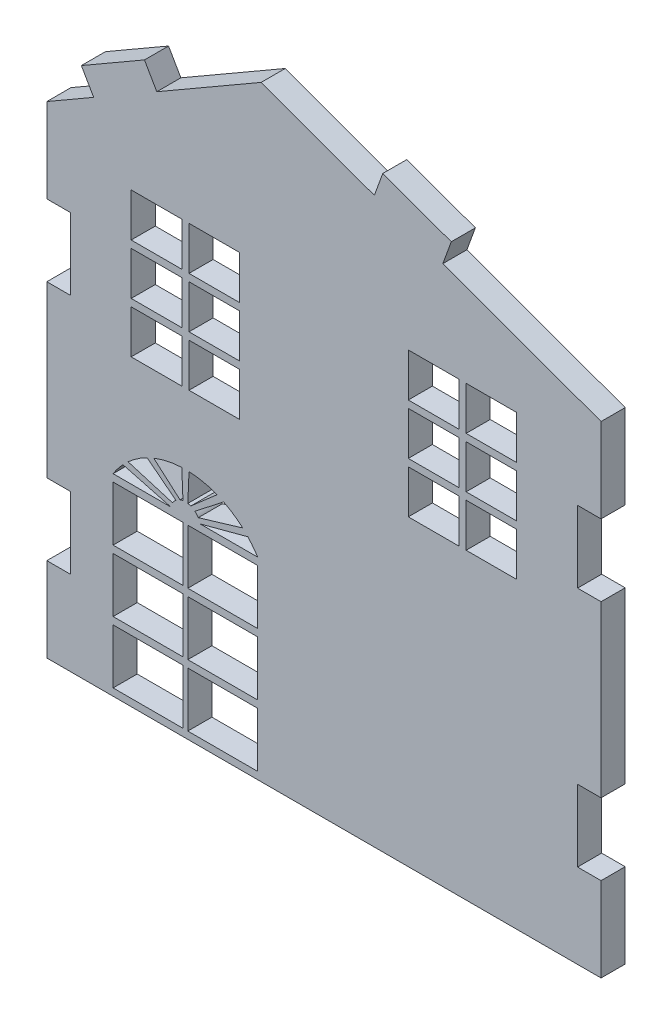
ISO-10303-21;
HEADER;
FILE_DESCRIPTION(('STEP AP214'),'2;1');
FILE_NAME('part.step','',(''),(''),'','','');
FILE_SCHEMA(('AUTOMOTIVE_DESIGN { 1 0 10303 214 1 1 1 1 }'));
ENDSEC;
DATA;
#1=APPLICATION_CONTEXT('core data for automotive mechanical design processes');
#2=APPLICATION_PROTOCOL_DEFINITION('international standard','automotive_design',2000,#1);
#3=PRODUCT_CONTEXT('',#1,'mechanical');
#4=PRODUCT('Part','Part','',(#3));
#5=PRODUCT_RELATED_PRODUCT_CATEGORY('part','',(#4));
#6=PRODUCT_DEFINITION_FORMATION('','',#4);
#7=PRODUCT_DEFINITION_CONTEXT('part definition',#1,'design');
#8=PRODUCT_DEFINITION('design','',#6,#7);
#9=PRODUCT_DEFINITION_SHAPE('','',#8);
#10=(LENGTH_UNIT() NAMED_UNIT(*) SI_UNIT(.MILLI.,.METRE.));
#11=(NAMED_UNIT(*) PLANE_ANGLE_UNIT() SI_UNIT($,.RADIAN.));
#12=(NAMED_UNIT(*) SI_UNIT($,.STERADIAN.) SOLID_ANGLE_UNIT());
#13=UNCERTAINTY_MEASURE_WITH_UNIT(LENGTH_MEASURE(1.E-05),#10,'distance_accuracy_value','');
#14=(GEOMETRIC_REPRESENTATION_CONTEXT(3) GLOBAL_UNCERTAINTY_ASSIGNED_CONTEXT((#13)) GLOBAL_UNIT_ASSIGNED_CONTEXT((#10,
#11,#12)) REPRESENTATION_CONTEXT('',''));
#15=CARTESIAN_POINT('',(0.,0.,0.));
#16=DIRECTION('',(0.,0.,1.));
#17=DIRECTION('',(1.,0.,0.));
#18=AXIS2_PLACEMENT_3D('',#15,#16,#17);
#19=CARTESIAN_POINT('',(0.,0.,10.));
#20=DIRECTION('',(0.,0.,-1.));
#21=DIRECTION('',(-1.,0.,0.));
#22=AXIS2_PLACEMENT_3D('',#19,#20,#21);
#23=PLANE('',#22);
#24=DIRECTION('',(-1.,0.,0.));
#25=VECTOR('',#24,1.);
#26=CARTESIAN_POINT('',(-35.,164.734387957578,10.));
#27=LINE('',#26,#25);
#28=CARTESIAN_POINT('',(-35.,164.734387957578,10.));
#29=VERTEX_POINT('',#28);
#30=CARTESIAN_POINT('',(-55.9999999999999,164.734387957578,10.));
#31=VERTEX_POINT('',#30);
#32=EDGE_CURVE('E1491',#29,#31,#27,.T.);
#33=ORIENTED_EDGE('',*,*,#32,.F.);
#34=DIRECTION('',(0.,1.,0.));
#35=VECTOR('',#34,1.);
#36=CARTESIAN_POINT('',(-35.,164.734387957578,10.));
#37=LINE('',#36,#35);
#38=CARTESIAN_POINT('',(-35.,146.734387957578,10.));
#39=VERTEX_POINT('',#38);
#40=EDGE_CURVE('E1504',#39,#29,#37,.T.);
#41=ORIENTED_EDGE('',*,*,#40,.F.);
#42=DIRECTION('',(1.,0.,0.));
#43=VECTOR('',#42,1.);
#44=CARTESIAN_POINT('',(-35.,146.734387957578,10.));
#45=LINE('',#44,#43);
#46=CARTESIAN_POINT('',(-55.9999999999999,146.734387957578,10.));
#47=VERTEX_POINT('',#46);
#48=EDGE_CURVE('E1509',#47,#39,#45,.T.);
#49=ORIENTED_EDGE('',*,*,#48,.F.);
#50=DIRECTION('',(0.,-1.,0.));
#51=VECTOR('',#50,1.);
#52=CARTESIAN_POINT('',(-55.9999999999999,164.734387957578,10.));
#53=LINE('',#52,#51);
#54=EDGE_CURVE('E1495',#31,#47,#53,.T.);
#55=ORIENTED_EDGE('',*,*,#54,.F.);
#56=EDGE_LOOP('',(#33,#41,#49,#55));
#57=FACE_BOUND('',#56,.T.);
#58=DIRECTION('',(0.,1.,0.));
#59=VECTOR('',#58,1.);
#60=CARTESIAN_POINT('',(-58.9999999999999,185.734387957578,10.));
#61=LINE('',#60,#59);
#62=CARTESIAN_POINT('',(-58.9999999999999,167.734387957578,10.));
#63=VERTEX_POINT('',#62);
#64=CARTESIAN_POINT('',(-58.9999999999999,185.734387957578,10.));
#65=VERTEX_POINT('',#64);
#66=EDGE_CURVE('E1550',#63,#65,#61,.T.);
#67=ORIENTED_EDGE('',*,*,#66,.F.);
#68=DIRECTION('',(1.,0.,0.));
#69=VECTOR('',#68,1.);
#70=CARTESIAN_POINT('',(-79.9999999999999,167.734387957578,10.));
#71=LINE('',#70,#69);
#72=CARTESIAN_POINT('',(-79.9999999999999,167.734387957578,10.));
#73=VERTEX_POINT('',#72);
#74=EDGE_CURVE('E1563',#73,#63,#71,.T.);
#75=ORIENTED_EDGE('',*,*,#74,.F.);
#76=DIRECTION('',(0.,-1.,0.));
#77=VECTOR('',#76,1.);
#78=CARTESIAN_POINT('',(-79.9999999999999,185.734387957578,10.));
#79=LINE('',#78,#77);
#80=CARTESIAN_POINT('',(-79.9999999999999,185.734387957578,10.));
#81=VERTEX_POINT('',#80);
#82=EDGE_CURVE('E1568',#81,#73,#79,.T.);
#83=ORIENTED_EDGE('',*,*,#82,.F.);
#84=DIRECTION('',(-1.,0.,0.));
#85=VECTOR('',#84,1.);
#86=CARTESIAN_POINT('',(-58.9999999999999,185.734387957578,10.));
#87=LINE('',#86,#85);
#88=EDGE_CURVE('E1554',#65,#81,#87,.T.);
#89=ORIENTED_EDGE('',*,*,#88,.F.);
#90=EDGE_LOOP('',(#67,#75,#83,#89));
#91=FACE_BOUND('',#90,.T.);
#92=DIRECTION('',(-1.,0.,0.));
#93=VECTOR('',#92,1.);
#94=CARTESIAN_POINT('',(-79.9999999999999,143.734387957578,10.));
#95=LINE('',#94,#93);
#96=CARTESIAN_POINT('',(-58.9999999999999,143.734387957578,10.));
#97=VERTEX_POINT('',#96);
#98=CARTESIAN_POINT('',(-79.9999999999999,143.734387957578,10.));
#99=VERTEX_POINT('',#98);
#100=EDGE_CURVE('E1609',#97,#99,#95,.T.);
#101=ORIENTED_EDGE('',*,*,#100,.F.);
#102=DIRECTION('',(0.,1.,0.));
#103=VECTOR('',#102,1.);
#104=CARTESIAN_POINT('',(-58.9999999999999,143.734387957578,10.));
#105=LINE('',#104,#103);
#106=CARTESIAN_POINT('',(-59.,125.734387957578,10.));
#107=VERTEX_POINT('',#106);
#108=EDGE_CURVE('E1622',#107,#97,#105,.T.);
#109=ORIENTED_EDGE('',*,*,#108,.F.);
#110=DIRECTION('',(1.,0.,0.));
#111=VECTOR('',#110,1.);
#112=CARTESIAN_POINT('',(-59.,125.734387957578,10.));
#113=LINE('',#112,#111);
#114=CARTESIAN_POINT('',(-79.9999999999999,125.734387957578,10.));
#115=VERTEX_POINT('',#114);
#116=EDGE_CURVE('E1627',#115,#107,#113,.T.);
#117=ORIENTED_EDGE('',*,*,#116,.F.);
#118=DIRECTION('',(0.,-1.,0.));
#119=VECTOR('',#118,1.);
#120=CARTESIAN_POINT('',(-79.9999999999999,143.734387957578,10.));
#121=LINE('',#120,#119);
#122=EDGE_CURVE('E1613',#99,#115,#121,.T.);
#123=ORIENTED_EDGE('',*,*,#122,.F.);
#124=EDGE_LOOP('',(#101,#109,#117,#123));
#125=FACE_BOUND('',#124,.T.);
#126=DIRECTION('',(0.,1.,0.));
#127=VECTOR('',#126,1.);
#128=CARTESIAN_POINT('',(-142.5,28.6666666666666,10.));
#129=LINE('',#128,#127);
#130=CARTESIAN_POINT('',(-142.5,28.6666666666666,10.));
#131=VERTEX_POINT('',#130);
#132=CARTESIAN_POINT('',(-142.5,51.3333333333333,10.));
#133=VERTEX_POINT('',#132);
#134=EDGE_CURVE('E1668',#131,#133,#129,.T.);
#135=ORIENTED_EDGE('',*,*,#134,.F.);
#136=DIRECTION('',(1.,0.,0.));
#137=VECTOR('',#136,1.);
#138=CARTESIAN_POINT('',(-142.5,28.6666666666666,10.));
#139=LINE('',#138,#137);
#140=CARTESIAN_POINT('',(-171.494596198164,28.6666666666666,10.));
#141=VERTEX_POINT('',#140);
#142=EDGE_CURVE('E1681',#141,#131,#139,.T.);
#143=ORIENTED_EDGE('',*,*,#142,.F.);
#144=DIRECTION('',(0.,-1.,0.));
#145=VECTOR('',#144,1.);
#146=CARTESIAN_POINT('',(-171.494596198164,51.3333333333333,10.));
#147=LINE('',#146,#145);
#148=CARTESIAN_POINT('',(-171.494596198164,51.3333333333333,10.));
#149=VERTEX_POINT('',#148);
#150=EDGE_CURVE('E1686',#149,#141,#147,.T.);
#151=ORIENTED_EDGE('',*,*,#150,.F.);
#152=DIRECTION('',(-1.,0.,0.));
#153=VECTOR('',#152,1.);
#154=CARTESIAN_POINT('',(-142.5,51.3333333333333,10.));
#155=LINE('',#154,#153);
#156=EDGE_CURVE('E1672',#133,#149,#155,.T.);
#157=ORIENTED_EDGE('',*,*,#156,.F.);
#158=EDGE_LOOP('',(#135,#143,#151,#157));
#159=FACE_BOUND('',#158,.T.);
#160=DIRECTION('',(0.,-1.,0.));
#161=VECTOR('',#160,1.);
#162=CARTESIAN_POINT('',(-202.5,28.6666666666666,10.));
#163=LINE('',#162,#161);
#164=CARTESIAN_POINT('',(-202.5,51.3333333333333,10.));
#165=VERTEX_POINT('',#164);
#166=CARTESIAN_POINT('',(-202.5,28.6666666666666,10.));
#167=VERTEX_POINT('',#166);
#168=EDGE_CURVE('E1727',#165,#167,#163,.T.);
#169=ORIENTED_EDGE('',*,*,#168,.F.);
#170=DIRECTION('',(-1.,0.,0.));
#171=VECTOR('',#170,1.);
#172=CARTESIAN_POINT('',(-202.5,51.3333333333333,10.));
#173=LINE('',#172,#171);
#174=CARTESIAN_POINT('',(-173.505403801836,51.3333333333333,10.));
#175=VERTEX_POINT('',#174);
#176=EDGE_CURVE('E1740',#175,#165,#173,.T.);
#177=ORIENTED_EDGE('',*,*,#176,.F.);
#178=DIRECTION('',(0.,1.,0.));
#179=VECTOR('',#178,1.);
#180=CARTESIAN_POINT('',(-173.505403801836,51.3333333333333,10.));
#181=LINE('',#180,#179);
#182=CARTESIAN_POINT('',(-173.505403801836,28.6666666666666,10.));
#183=VERTEX_POINT('',#182);
#184=EDGE_CURVE('E1745',#183,#175,#181,.T.);
#185=ORIENTED_EDGE('',*,*,#184,.F.);
#186=DIRECTION('',(1.,0.,0.));
#187=VECTOR('',#186,1.);
#188=CARTESIAN_POINT('',(-202.5,28.6666666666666,10.));
#189=LINE('',#188,#187);
#190=EDGE_CURVE('E1731',#167,#183,#189,.T.);
#191=ORIENTED_EDGE('',*,*,#190,.F.);
#192=EDGE_LOOP('',(#169,#177,#185,#191));
#193=FACE_BOUND('',#192,.T.);
#194=DIRECTION('',(0.,1.,0.));
#195=VECTOR('',#194,1.);
#196=CARTESIAN_POINT('',(-173.505403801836,25.6666666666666,10.));
#197=LINE('',#196,#195);
#198=CARTESIAN_POINT('',(-173.505403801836,2.99999999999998,10.));
#199=VERTEX_POINT('',#198);
#200=CARTESIAN_POINT('',(-173.505403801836,25.6666666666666,10.));
#201=VERTEX_POINT('',#200);
#202=EDGE_CURVE('E1786',#199,#201,#197,.T.);
#203=ORIENTED_EDGE('',*,*,#202,.F.);
#204=DIRECTION('',(1.,0.,0.));
#205=VECTOR('',#204,1.);
#206=CARTESIAN_POINT('',(-173.505403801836,2.99999999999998,10.));
#207=LINE('',#206,#205);
#208=CARTESIAN_POINT('',(-202.5,2.99999999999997,10.));
#209=VERTEX_POINT('',#208);
#210=EDGE_CURVE('E1799',#209,#199,#207,.T.);
#211=ORIENTED_EDGE('',*,*,#210,.F.);
#212=DIRECTION('',(0.,-1.,0.));
#213=VECTOR('',#212,1.);
#214=CARTESIAN_POINT('',(-202.5,2.99999999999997,10.));
#215=LINE('',#214,#213);
#216=CARTESIAN_POINT('',(-202.5,25.6666666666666,10.));
#217=VERTEX_POINT('',#216);
#218=EDGE_CURVE('E1804',#217,#209,#215,.T.);
#219=ORIENTED_EDGE('',*,*,#218,.F.);
#220=DIRECTION('',(-1.,0.,0.));
#221=VECTOR('',#220,1.);
#222=CARTESIAN_POINT('',(-202.5,25.6666666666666,10.));
#223=LINE('',#222,#221);
#224=EDGE_CURVE('E1790',#201,#217,#223,.T.);
#225=ORIENTED_EDGE('',*,*,#224,.F.);
#226=EDGE_LOOP('',(#203,#211,#219,#225));
#227=FACE_BOUND('',#226,.T.);
#228=DIRECTION('',(0.,-1.,0.));
#229=VECTOR('',#228,1.);
#230=CARTESIAN_POINT('',(-195.,164.734387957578,10.));
#231=LINE('',#230,#229);
#232=CARTESIAN_POINT('',(-195.,164.734387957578,10.));
#233=VERTEX_POINT('',#232);
#234=CARTESIAN_POINT('',(-195.,146.734387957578,10.));
#235=VERTEX_POINT('',#234);
#236=EDGE_CURVE('E1845',#233,#235,#231,.T.);
#237=ORIENTED_EDGE('',*,*,#236,.F.);
#238=DIRECTION('',(-1.,0.,0.));
#239=VECTOR('',#238,1.);
#240=CARTESIAN_POINT('',(-195.,164.734387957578,10.));
#241=LINE('',#240,#239);
#242=CARTESIAN_POINT('',(-174.,164.734387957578,10.));
#243=VERTEX_POINT('',#242);
#244=EDGE_CURVE('E1858',#243,#233,#241,.T.);
#245=ORIENTED_EDGE('',*,*,#244,.F.);
#246=DIRECTION('',(0.,1.,0.));
#247=VECTOR('',#246,1.);
#248=CARTESIAN_POINT('',(-174.,164.734387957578,10.));
#249=LINE('',#248,#247);
#250=CARTESIAN_POINT('',(-174.,146.734387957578,10.));
#251=VERTEX_POINT('',#250);
#252=EDGE_CURVE('E1863',#251,#243,#249,.T.);
#253=ORIENTED_EDGE('',*,*,#252,.F.);
#254=DIRECTION('',(1.,0.,0.));
#255=VECTOR('',#254,1.);
#256=CARTESIAN_POINT('',(-195.,146.734387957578,10.));
#257=LINE('',#256,#255);
#258=EDGE_CURVE('E1849',#235,#251,#257,.T.);
#259=ORIENTED_EDGE('',*,*,#258,.F.);
#260=EDGE_LOOP('',(#237,#245,#253,#259));
#261=FACE_BOUND('',#260,.T.);
#262=DIRECTION('',(0.,1.,0.));
#263=VECTOR('',#262,1.);
#264=CARTESIAN_POINT('',(-142.5,54.3333333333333,10.));
#265=LINE('',#264,#263);
#266=CARTESIAN_POINT('',(-142.5,54.3333333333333,10.));
#267=VERTEX_POINT('',#266);
#268=CARTESIAN_POINT('',(-142.5,77.,10.));
#269=VERTEX_POINT('',#268);
#270=EDGE_CURVE('E1904',#267,#269,#265,.T.);
#271=ORIENTED_EDGE('',*,*,#270,.F.);
#272=DIRECTION('',(1.,0.,0.));
#273=VECTOR('',#272,1.);
#274=CARTESIAN_POINT('',(-142.5,54.3333333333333,10.));
#275=LINE('',#274,#273);
#276=CARTESIAN_POINT('',(-171.494596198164,54.3333333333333,10.));
#277=VERTEX_POINT('',#276);
#278=EDGE_CURVE('E1917',#277,#267,#275,.T.);
#279=ORIENTED_EDGE('',*,*,#278,.F.);
#280=DIRECTION('',(0.,-1.,0.));
#281=VECTOR('',#280,1.);
#282=CARTESIAN_POINT('',(-171.494596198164,77.,10.));
#283=LINE('',#282,#281);
#284=CARTESIAN_POINT('',(-171.494596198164,77.,10.));
#285=VERTEX_POINT('',#284);
#286=EDGE_CURVE('E1922',#285,#277,#283,.T.);
#287=ORIENTED_EDGE('',*,*,#286,.F.);
#288=DIRECTION('',(-1.,0.,0.));
#289=VECTOR('',#288,1.);
#290=CARTESIAN_POINT('',(-171.494596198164,77.,10.));
#291=LINE('',#290,#289);
#292=EDGE_CURVE('E1908',#269,#285,#291,.T.);
#293=ORIENTED_EDGE('',*,*,#292,.F.);
#294=EDGE_LOOP('',(#271,#279,#287,#293));
#295=FACE_BOUND('',#294,.T.);
#296=DIRECTION('',(0.,1.,0.));
#297=VECTOR('',#296,1.);
#298=CARTESIAN_POINT('',(-173.505403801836,77.,10.));
#299=LINE('',#298,#297);
#300=CARTESIAN_POINT('',(-173.505403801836,54.3333333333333,10.));
#301=VERTEX_POINT('',#300);
#302=CARTESIAN_POINT('',(-173.505403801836,77.,10.));
#303=VERTEX_POINT('',#302);
#304=EDGE_CURVE('E1963',#301,#303,#299,.T.);
#305=ORIENTED_EDGE('',*,*,#304,.F.);
#306=DIRECTION('',(1.,0.,0.));
#307=VECTOR('',#306,1.);
#308=CARTESIAN_POINT('',(-202.5,54.3333333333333,10.));
#309=LINE('',#308,#307);
#310=CARTESIAN_POINT('',(-202.5,54.3333333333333,10.));
#311=VERTEX_POINT('',#310);
#312=EDGE_CURVE('E1976',#311,#301,#309,.T.);
#313=ORIENTED_EDGE('',*,*,#312,.F.);
#314=DIRECTION('',(0.,-1.,0.));
#315=VECTOR('',#314,1.);
#316=CARTESIAN_POINT('',(-202.5,54.3333333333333,10.));
#317=LINE('',#316,#315);
#318=CARTESIAN_POINT('',(-202.5,77.,10.));
#319=VERTEX_POINT('',#318);
#320=EDGE_CURVE('E1981',#319,#311,#317,.T.);
#321=ORIENTED_EDGE('',*,*,#320,.F.);
#322=DIRECTION('',(-1.,0.,0.));
#323=VECTOR('',#322,1.);
#324=CARTESIAN_POINT('',(-202.5,77.,10.));
#325=LINE('',#324,#323);
#326=EDGE_CURVE('E1967',#303,#319,#325,.T.);
#327=ORIENTED_EDGE('',*,*,#326,.F.);
#328=EDGE_LOOP('',(#305,#313,#321,#327));
#329=FACE_BOUND('',#328,.T.);
#330=DIRECTION('',(0.,-1.,0.));
#331=VECTOR('',#330,1.);
#332=CARTESIAN_POINT('',(-195.,143.734387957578,10.));
#333=LINE('',#332,#331);
#334=CARTESIAN_POINT('',(-195.,143.734387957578,10.));
#335=VERTEX_POINT('',#334);
#336=CARTESIAN_POINT('',(-195.,125.734387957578,10.));
#337=VERTEX_POINT('',#336);
#338=EDGE_CURVE('E2022',#335,#337,#333,.T.);
#339=ORIENTED_EDGE('',*,*,#338,.F.);
#340=DIRECTION('',(-1.,0.,0.));
#341=VECTOR('',#340,1.);
#342=CARTESIAN_POINT('',(-195.,143.734387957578,10.));
#343=LINE('',#342,#341);
#344=CARTESIAN_POINT('',(-174.,143.734387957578,10.));
#345=VERTEX_POINT('',#344);
#346=EDGE_CURVE('E2035',#345,#335,#343,.T.);
#347=ORIENTED_EDGE('',*,*,#346,.F.);
#348=DIRECTION('',(0.,1.,0.));
#349=VECTOR('',#348,1.);
#350=CARTESIAN_POINT('',(-174.,143.734387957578,10.));
#351=LINE('',#350,#349);
#352=CARTESIAN_POINT('',(-174.,125.734387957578,10.));
#353=VERTEX_POINT('',#352);
#354=EDGE_CURVE('E2040',#353,#345,#351,.T.);
#355=ORIENTED_EDGE('',*,*,#354,.F.);
#356=DIRECTION('',(1.,0.,0.));
#357=VECTOR('',#356,1.);
#358=CARTESIAN_POINT('',(-195.,125.734387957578,10.));
#359=LINE('',#358,#357);
#360=EDGE_CURVE('E2026',#337,#353,#359,.T.);
#361=ORIENTED_EDGE('',*,*,#360,.F.);
#362=EDGE_LOOP('',(#339,#347,#355,#361));
#363=FACE_BOUND('',#362,.T.);
#364=DIRECTION('',(0.,-1.,0.));
#365=VECTOR('',#364,1.);
#366=CARTESIAN_POINT('',(-195.,185.734387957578,10.));
#367=LINE('',#366,#365);
#368=CARTESIAN_POINT('',(-195.,185.734387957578,10.));
#369=VERTEX_POINT('',#368);
#370=CARTESIAN_POINT('',(-195.,167.734387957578,10.));
#371=VERTEX_POINT('',#370);
#372=EDGE_CURVE('E2081',#369,#371,#367,.T.);
#373=ORIENTED_EDGE('',*,*,#372,.F.);
#374=DIRECTION('',(-1.,0.,0.));
#375=VECTOR('',#374,1.);
#376=CARTESIAN_POINT('',(-195.,185.734387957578,10.));
#377=LINE('',#376,#375);
#378=CARTESIAN_POINT('',(-174.,185.734387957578,10.));
#379=VERTEX_POINT('',#378);
#380=EDGE_CURVE('E2091',#379,#369,#377,.T.);
#381=ORIENTED_EDGE('',*,*,#380,.F.);
#382=DIRECTION('',(0.,1.,0.));
#383=VECTOR('',#382,1.);
#384=CARTESIAN_POINT('',(-174.,185.734387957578,10.));
#385=LINE('',#384,#383);
#386=CARTESIAN_POINT('',(-174.,167.734387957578,10.));
#387=VERTEX_POINT('',#386);
#388=EDGE_CURVE('E2096',#387,#379,#385,.T.);
#389=ORIENTED_EDGE('',*,*,#388,.F.);
#390=DIRECTION('',(1.,0.,0.));
#391=VECTOR('',#390,1.);
#392=CARTESIAN_POINT('',(-195.,167.734387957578,10.));
#393=LINE('',#392,#391);
#394=EDGE_CURVE('E2084',#371,#387,#393,.T.);
#395=ORIENTED_EDGE('',*,*,#394,.F.);
#396=EDGE_LOOP('',(#373,#381,#389,#395));
#397=FACE_BOUND('',#396,.T.);
#398=CARTESIAN_POINT('',(-172.5,61.0498587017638,10.));
#399=DIRECTION('',(0.,0.,1.));
#400=DIRECTION('',(-1.,0.,0.));
#401=AXIS2_PLACEMENT_3D('',#398,#399,#400);
#402=CIRCLE('',#401,35.4839098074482);
#403=CARTESIAN_POINT('',(-142.5,80.,10.));
#404=VERTEX_POINT('',#403);
#405=CARTESIAN_POINT('',(-146.580612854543,85.2839921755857,10.));
#406=VERTEX_POINT('',#405);
#407=EDGE_CURVE('E1113',#404,#406,#402,.T.);
#408=ORIENTED_EDGE('',*,*,#407,.F.);
#409=DIRECTION('',(1.,0.,0.));
#410=VECTOR('',#409,1.);
#411=CARTESIAN_POINT('',(-166.427014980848,80.,10.));
#412=LINE('',#411,#410);
#413=CARTESIAN_POINT('',(-166.427014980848,80.,10.));
#414=VERTEX_POINT('',#413);
#415=EDGE_CURVE('E1128',#414,#404,#412,.T.);
#416=ORIENTED_EDGE('',*,*,#415,.F.);
#417=DIRECTION('',(-0.966336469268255,-0.257281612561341,0.));
#418=VECTOR('',#417,1.);
#419=CARTESIAN_POINT('',(-166.427014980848,80.,10.));
#420=LINE('',#419,#418);
#421=EDGE_CURVE('E1117',#406,#414,#420,.T.);
#422=ORIENTED_EDGE('',*,*,#421,.F.);
#423=EDGE_LOOP('',(#408,#416,#422));
#424=FACE_BOUND('',#423,.T.);
#425=DIRECTION('',(0.,1.,0.));
#426=VECTOR('',#425,1.);
#427=CARTESIAN_POINT('',(0.,35.,10.));
#428=LINE('',#427,#426);
#429=CARTESIAN_POINT('',(0.,0.,10.));
#430=VERTEX_POINT('',#429);
#431=CARTESIAN_POINT('',(0.,35.,10.));
#432=VERTEX_POINT('',#431);
#433=EDGE_CURVE('E1148',#430,#432,#428,.T.);
#434=ORIENTED_EDGE('',*,*,#433,.T.);
#435=DIRECTION('',(-1.,0.,0.));
#436=VECTOR('',#435,1.);
#437=CARTESIAN_POINT('',(0.,35.,10.));
#438=LINE('',#437,#436);
#439=CARTESIAN_POINT('',(-9.76000000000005,35.,10.));
#440=VERTEX_POINT('',#439);
#441=EDGE_CURVE('E1153',#432,#440,#438,.T.);
#442=ORIENTED_EDGE('',*,*,#441,.T.);
#443=DIRECTION('',(0.,1.,0.));
#444=VECTOR('',#443,1.);
#445=CARTESIAN_POINT('',(-9.76000000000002,64.76,10.));
#446=LINE('',#445,#444);
#447=CARTESIAN_POINT('',(-9.76000000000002,64.76,10.));
#448=VERTEX_POINT('',#447);
#449=EDGE_CURVE('E1162',#440,#448,#446,.T.);
#450=ORIENTED_EDGE('',*,*,#449,.T.);
#451=DIRECTION('',(1.,0.,0.));
#452=VECTOR('',#451,1.);
#453=CARTESIAN_POINT('',(0.,64.76,10.));
#454=LINE('',#453,#452);
#455=CARTESIAN_POINT('',(0.,64.76,10.));
#456=VERTEX_POINT('',#455);
#457=EDGE_CURVE('E1165',#448,#456,#454,.T.);
#458=ORIENTED_EDGE('',*,*,#457,.T.);
#459=DIRECTION('',(0.,1.,0.));
#460=VECTOR('',#459,1.);
#461=CARTESIAN_POINT('',(0.,135.24,10.));
#462=LINE('',#461,#460);
#463=CARTESIAN_POINT('',(0.,135.24,10.));
#464=VERTEX_POINT('',#463);
#465=EDGE_CURVE('E1169',#456,#464,#462,.T.);
#466=ORIENTED_EDGE('',*,*,#465,.T.);
#467=DIRECTION('',(-1.,0.,0.));
#468=VECTOR('',#467,1.);
#469=CARTESIAN_POINT('',(0.,135.24,10.));
#470=LINE('',#469,#468);
#471=CARTESIAN_POINT('',(-9.76000000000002,135.24,10.));
#472=VERTEX_POINT('',#471);
#473=EDGE_CURVE('E1173',#464,#472,#470,.T.);
#474=ORIENTED_EDGE('',*,*,#473,.T.);
#475=DIRECTION('',(0.,1.,0.));
#476=VECTOR('',#475,1.);
#477=CARTESIAN_POINT('',(-9.76000000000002,135.24,10.));
#478=LINE('',#477,#476);
#479=CARTESIAN_POINT('',(-9.76000000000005,165.,10.));
#480=VERTEX_POINT('',#479);
#481=EDGE_CURVE('E1181',#472,#480,#478,.T.);
#482=ORIENTED_EDGE('',*,*,#481,.T.);
#483=DIRECTION('',(1.,0.,0.));
#484=VECTOR('',#483,1.);
#485=CARTESIAN_POINT('',(0.,165.,10.));
#486=LINE('',#485,#484);
#487=CARTESIAN_POINT('',(0.,165.,10.));
#488=VERTEX_POINT('',#487);
#489=EDGE_CURVE('E1184',#480,#488,#486,.T.);
#490=ORIENTED_EDGE('',*,*,#489,.T.);
#491=DIRECTION('',(0.,1.,0.));
#492=VECTOR('',#491,1.);
#493=CARTESIAN_POINT('',(0.,200.,10.));
#494=LINE('',#493,#492);
#495=CARTESIAN_POINT('',(0.,200.,10.));
#496=VERTEX_POINT('',#495);
#497=EDGE_CURVE('E1188',#488,#496,#494,.T.);
#498=ORIENTED_EDGE('',*,*,#497,.T.);
#499=DIRECTION('',(-0.939692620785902,0.342020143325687,0.));
#500=VECTOR('',#499,1.);
#501=CARTESIAN_POINT('',(-65.6674477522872,223.900996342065,10.));
#502=LINE('',#501,#500);
#503=CARTESIAN_POINT('',(-65.6674477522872,223.900996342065,10.));
#504=VERTEX_POINT('',#503);
#505=EDGE_CURVE('E1192',#496,#504,#502,.T.);
#506=ORIENTED_EDGE('',*,*,#505,.T.);
#507=DIRECTION('',(0.342020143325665,0.93969262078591,0.));
#508=VECTOR('',#507,1.);
#509=CARTESIAN_POINT('',(-62.1651614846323,233.523448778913,10.));
#510=LINE('',#509,#508);
#511=CARTESIAN_POINT('',(-62.1651614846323,233.523448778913,10.));
#512=VERTEX_POINT('',#511);
#513=EDGE_CURVE('E1200',#504,#512,#510,.T.);
#514=ORIENTED_EDGE('',*,*,#513,.T.);
#515=DIRECTION('',(-0.939692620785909,0.342020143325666,0.));
#516=VECTOR('',#515,1.);
#517=CARTESIAN_POINT('',(-90.5814663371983,243.866137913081,10.));
#518=LINE('',#517,#516);
#519=CARTESIAN_POINT('',(-90.5814663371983,243.866137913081,10.));
#520=VERTEX_POINT('',#519);
#521=EDGE_CURVE('E1203',#512,#520,#518,.T.);
#522=ORIENTED_EDGE('',*,*,#521,.T.);
#523=DIRECTION('',(-0.342020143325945,-0.939692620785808,0.));
#524=VECTOR('',#523,1.);
#525=CARTESIAN_POINT('',(-94.0837526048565,234.243685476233,10.));
#526=LINE('',#525,#524);
#527=CARTESIAN_POINT('',(-94.0837526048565,234.243685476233,10.));
#528=VERTEX_POINT('',#527);
#529=EDGE_CURVE('E1207',#520,#528,#526,.T.);
#530=ORIENTED_EDGE('',*,*,#529,.T.);
#531=DIRECTION('',(-0.939692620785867,0.342020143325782,0.));
#532=VECTOR('',#531,1.);
#533=CARTESIAN_POINT('',(-141.068383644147,251.344692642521,10.));
#534=LINE('',#533,#532);
#535=CARTESIAN_POINT('',(-141.068383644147,251.344692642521,10.));
#536=VERTEX_POINT('',#535);
#537=EDGE_CURVE('E1211',#528,#536,#534,.T.);
#538=ORIENTED_EDGE('',*,*,#537,.T.);
#539=DIRECTION('',(-0.866025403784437,-0.500000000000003,0.));
#540=VECTOR('',#539,1.);
#541=CARTESIAN_POINT('',(-184.369653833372,226.344692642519,10.));
#542=LINE('',#541,#540);
#543=CARTESIAN_POINT('',(-184.369653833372,226.344692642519,10.));
#544=VERTEX_POINT('',#543);
#545=EDGE_CURVE('E1219',#536,#544,#542,.T.);
#546=ORIENTED_EDGE('',*,*,#545,.T.);
#547=DIRECTION('',(-0.500000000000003,0.866025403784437,0.));
#548=VECTOR('',#547,1.);
#549=CARTESIAN_POINT('',(-184.369653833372,226.344692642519,10.));
#550=LINE('',#549,#548);
#551=CARTESIAN_POINT('',(-189.489653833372,235.212792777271,10.));
#552=VERTEX_POINT('',#551);
#553=EDGE_CURVE('E1222',#544,#552,#550,.T.);
#554=ORIENTED_EDGE('',*,*,#553,.T.);
#555=DIRECTION('',(-0.866025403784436,-0.500000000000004,0.));
#556=VECTOR('',#555,1.);
#557=CARTESIAN_POINT('',(-215.678262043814,220.092792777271,10.));
#558=LINE('',#557,#556);
#559=CARTESIAN_POINT('',(-215.678262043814,220.092792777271,10.));
#560=VERTEX_POINT('',#559);
#561=EDGE_CURVE('E1226',#552,#560,#558,.T.);
#562=ORIENTED_EDGE('',*,*,#561,.T.);
#563=DIRECTION('',(0.500000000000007,-0.866025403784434,0.));
#564=VECTOR('',#563,1.);
#565=CARTESIAN_POINT('',(-210.558262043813,211.224692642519,10.));
#566=LINE('',#565,#564);
#567=CARTESIAN_POINT('',(-210.558262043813,211.224692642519,10.));
#568=VERTEX_POINT('',#567);
#569=EDGE_CURVE('E1230',#560,#568,#566,.T.);
#570=ORIENTED_EDGE('',*,*,#569,.T.);
#571=DIRECTION('',(-0.866025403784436,-0.500000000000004,0.));
#572=VECTOR('',#571,1.);
#573=CARTESIAN_POINT('',(-230.,200.,10.));
#574=LINE('',#573,#572);
#575=CARTESIAN_POINT('',(-230.,200.,10.));
#576=VERTEX_POINT('',#575);
#577=EDGE_CURVE('E1238',#568,#576,#574,.T.);
#578=ORIENTED_EDGE('',*,*,#577,.T.);
#579=DIRECTION('',(0.,-1.,0.));
#580=VECTOR('',#579,1.);
#581=CARTESIAN_POINT('',(-230.,165.,10.));
#582=LINE('',#581,#580);
#583=CARTESIAN_POINT('',(-230.,165.,10.));
#584=VERTEX_POINT('',#583);
#585=EDGE_CURVE('E1241',#576,#584,#582,.T.);
#586=ORIENTED_EDGE('',*,*,#585,.T.);
#587=DIRECTION('',(1.,0.,0.));
#588=VECTOR('',#587,1.);
#589=CARTESIAN_POINT('',(-230.,165.,10.));
#590=LINE('',#589,#588);
#591=CARTESIAN_POINT('',(-220.24,165.,10.));
#592=VERTEX_POINT('',#591);
#593=EDGE_CURVE('E1245',#584,#592,#590,.T.);
#594=ORIENTED_EDGE('',*,*,#593,.T.);
#595=DIRECTION('',(0.,-1.,0.));
#596=VECTOR('',#595,1.);
#597=CARTESIAN_POINT('',(-220.24,135.24,10.));
#598=LINE('',#597,#596);
#599=CARTESIAN_POINT('',(-220.24,135.24,10.));
#600=VERTEX_POINT('',#599);
#601=EDGE_CURVE('E1249',#592,#600,#598,.T.);
#602=ORIENTED_EDGE('',*,*,#601,.T.);
#603=DIRECTION('',(-1.,0.,0.));
#604=VECTOR('',#603,1.);
#605=CARTESIAN_POINT('',(-230.,135.24,10.));
#606=LINE('',#605,#604);
#607=CARTESIAN_POINT('',(-230.,135.24,10.));
#608=VERTEX_POINT('',#607);
#609=EDGE_CURVE('E1257',#600,#608,#606,.T.);
#610=ORIENTED_EDGE('',*,*,#609,.T.);
#611=DIRECTION('',(0.,-1.,0.));
#612=VECTOR('',#611,1.);
#613=CARTESIAN_POINT('',(-230.,64.76,10.));
#614=LINE('',#613,#612);
#615=CARTESIAN_POINT('',(-230.,64.76,10.));
#616=VERTEX_POINT('',#615);
#617=EDGE_CURVE('E1260',#608,#616,#614,.T.);
#618=ORIENTED_EDGE('',*,*,#617,.T.);
#619=DIRECTION('',(1.,0.,0.));
#620=VECTOR('',#619,1.);
#621=CARTESIAN_POINT('',(-230.,64.76,10.));
#622=LINE('',#621,#620);
#623=CARTESIAN_POINT('',(-220.24,64.76,10.));
#624=VERTEX_POINT('',#623);
#625=EDGE_CURVE('E1264',#616,#624,#622,.T.);
#626=ORIENTED_EDGE('',*,*,#625,.T.);
#627=DIRECTION('',(0.,-1.,0.));
#628=VECTOR('',#627,1.);
#629=CARTESIAN_POINT('',(-220.24,64.76,10.));
#630=LINE('',#629,#628);
#631=CARTESIAN_POINT('',(-220.24,35.,10.));
#632=VERTEX_POINT('',#631);
#633=EDGE_CURVE('E1268',#624,#632,#630,.T.);
#634=ORIENTED_EDGE('',*,*,#633,.T.);
#635=DIRECTION('',(-1.,0.,0.));
#636=VECTOR('',#635,1.);
#637=CARTESIAN_POINT('',(-230.,35.,10.));
#638=LINE('',#637,#636);
#639=CARTESIAN_POINT('',(-230.,35.,10.));
#640=VERTEX_POINT('',#639);
#641=EDGE_CURVE('E1276',#632,#640,#638,.T.);
#642=ORIENTED_EDGE('',*,*,#641,.T.);
#643=DIRECTION('',(0.,-1.,0.));
#644=VECTOR('',#643,1.);
#645=CARTESIAN_POINT('',(-230.,0.,10.));
#646=LINE('',#645,#644);
#647=CARTESIAN_POINT('',(-230.,0.,10.));
#648=VERTEX_POINT('',#647);
#649=EDGE_CURVE('E1279',#640,#648,#646,.T.);
#650=ORIENTED_EDGE('',*,*,#649,.T.);
#651=DIRECTION('',(1.,0.,0.));
#652=VECTOR('',#651,1.);
#653=CARTESIAN_POINT('',(-202.5,0.,10.));
#654=LINE('',#653,#652);
#655=EDGE_CURVE('E1283',#648,#430,#654,.T.);
#656=ORIENTED_EDGE('',*,*,#655,.T.);
#657=EDGE_LOOP('',(#434,#442,#450,#458,#466,#474,#482,#490,#498,#506,#514,#522,#530,#538,#546,
#554,#562,#570,#578,#586,#594,#602,#610,#618,#626,#634,#642,#650,#656));
#658=FACE_BOUND('',#657,.T.);
#659=CARTESIAN_POINT('',(-172.5,61.0498587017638,10.));
#660=DIRECTION('',(0.,0.,1.));
#661=DIRECTION('',(-1.,0.,0.));
#662=AXIS2_PLACEMENT_3D('',#659,#660,#661);
#663=CIRCLE('',#662,35.4839098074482);
#664=CARTESIAN_POINT('',(-198.419387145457,85.2839921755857,10.));
#665=VERTEX_POINT('',#664);
#666=CARTESIAN_POINT('',(-202.5,80.,10.));
#667=VERTEX_POINT('',#666);
#668=EDGE_CURVE('E1088',#665,#667,#663,.T.);
#669=ORIENTED_EDGE('',*,*,#668,.F.);
#670=DIRECTION('',(-0.966336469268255,0.257281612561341,0.));
#671=VECTOR('',#670,1.);
#672=CARTESIAN_POINT('',(-178.572985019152,80.,10.));
#673=LINE('',#672,#671);
#674=CARTESIAN_POINT('',(-178.572985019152,80.,10.));
#675=VERTEX_POINT('',#674);
#676=EDGE_CURVE('E1087',#675,#665,#673,.T.);
#677=ORIENTED_EDGE('',*,*,#676,.F.);
#678=DIRECTION('',(1.,0.,0.));
#679=VECTOR('',#678,1.);
#680=CARTESIAN_POINT('',(-202.5,80.,10.));
#681=LINE('',#680,#679);
#682=EDGE_CURVE('E1082',#667,#675,#681,.T.);
#683=ORIENTED_EDGE('',*,*,#682,.F.);
#684=EDGE_LOOP('',(#669,#677,#683));
#685=FACE_BOUND('',#684,.T.);
#686=DIRECTION('',(1.,0.,0.));
#687=VECTOR('',#686,1.);
#688=CARTESIAN_POINT('',(-171.,125.734387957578,10.));
#689=LINE('',#688,#687);
#690=CARTESIAN_POINT('',(-171.,125.734387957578,10.));
#691=VERTEX_POINT('',#690);
#692=CARTESIAN_POINT('',(-150.,125.734387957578,10.));
#693=VERTEX_POINT('',#692);
#694=EDGE_CURVE('E1062',#691,#693,#689,.T.);
#695=ORIENTED_EDGE('',*,*,#694,.F.);
#696=DIRECTION('',(0.,-1.,0.));
#697=VECTOR('',#696,1.);
#698=CARTESIAN_POINT('',(-171.,143.734387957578,10.));
#699=LINE('',#698,#697);
#700=CARTESIAN_POINT('',(-171.,143.734387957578,10.));
#701=VERTEX_POINT('',#700);
#702=EDGE_CURVE('E1069',#701,#691,#699,.T.);
#703=ORIENTED_EDGE('',*,*,#702,.F.);
#704=DIRECTION('',(-1.,0.,0.));
#705=VECTOR('',#704,1.);
#706=CARTESIAN_POINT('',(-150.,143.734387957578,10.));
#707=LINE('',#706,#705);
#708=CARTESIAN_POINT('',(-150.,143.734387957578,10.));
#709=VERTEX_POINT('',#708);
#710=EDGE_CURVE('E1061',#709,#701,#707,.T.);
#711=ORIENTED_EDGE('',*,*,#710,.F.);
#712=DIRECTION('',(0.,1.,0.));
#713=VECTOR('',#712,1.);
#714=CARTESIAN_POINT('',(-150.,143.734387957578,10.));
#715=LINE('',#714,#713);
#716=EDGE_CURVE('E1057',#693,#709,#715,.T.);
#717=ORIENTED_EDGE('',*,*,#716,.F.);
#718=EDGE_LOOP('',(#695,#703,#711,#717));
#719=FACE_BOUND('',#718,.T.);
#720=DIRECTION('',(-1.,0.,0.));
#721=VECTOR('',#720,1.);
#722=CARTESIAN_POINT('',(-171.,185.734387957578,10.));
#723=LINE('',#722,#721);
#724=CARTESIAN_POINT('',(-150.,185.734387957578,10.));
#725=VERTEX_POINT('',#724);
#726=CARTESIAN_POINT('',(-171.,185.734387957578,10.));
#727=VERTEX_POINT('',#726);
#728=EDGE_CURVE('E1037',#725,#727,#723,.T.);
#729=ORIENTED_EDGE('',*,*,#728,.F.);
#730=DIRECTION('',(0.,1.,0.));
#731=VECTOR('',#730,1.);
#732=CARTESIAN_POINT('',(-150.,185.734387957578,10.));
#733=LINE('',#732,#731);
#734=CARTESIAN_POINT('',(-150.,167.734387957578,10.));
#735=VERTEX_POINT('',#734);
#736=EDGE_CURVE('E1044',#735,#725,#733,.T.);
#737=ORIENTED_EDGE('',*,*,#736,.F.);
#738=DIRECTION('',(1.,0.,0.));
#739=VECTOR('',#738,1.);
#740=CARTESIAN_POINT('',(-150.,167.734387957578,10.));
#741=LINE('',#740,#739);
#742=CARTESIAN_POINT('',(-171.,167.734387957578,10.));
#743=VERTEX_POINT('',#742);
#744=EDGE_CURVE('E1036',#743,#735,#741,.T.);
#745=ORIENTED_EDGE('',*,*,#744,.F.);
#746=DIRECTION('',(0.,-1.,0.));
#747=VECTOR('',#746,1.);
#748=CARTESIAN_POINT('',(-171.,185.734387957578,10.));
#749=LINE('',#748,#747);
#750=EDGE_CURVE('E1032',#727,#743,#749,.T.);
#751=ORIENTED_EDGE('',*,*,#750,.F.);
#752=EDGE_LOOP('',(#729,#737,#745,#751));
#753=FACE_BOUND('',#752,.T.);
#754=CARTESIAN_POINT('',(-172.5,61.0498587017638,10.));
#755=DIRECTION('',(0.,0.,1.));
#756=DIRECTION('',(-1.,0.,0.));
#757=AXIS2_PLACEMENT_3D('',#754,#755,#756);
#758=CIRCLE('',#757,35.4839098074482);
#759=CARTESIAN_POINT('',(-159.358686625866,94.0106496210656,10.));
#760=VERTEX_POINT('',#759);
#761=CARTESIAN_POINT('',(-171.,96.5020498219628,10.));
#762=VERTEX_POINT('',#761);
#763=EDGE_CURVE('E1012',#760,#762,#758,.T.);
#764=ORIENTED_EDGE('',*,*,#763,.F.);
#765=DIRECTION('',(0.753584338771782,0.657351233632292,0.));
#766=VECTOR('',#765,1.);
#767=CARTESIAN_POINT('',(-159.358686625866,94.0106496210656,10.));
#768=LINE('',#767,#766);
#769=CARTESIAN_POINT('',(-170.275670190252,84.4877704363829,10.));
#770=VERTEX_POINT('',#769);
#771=EDGE_CURVE('E1019',#770,#760,#768,.T.);
#772=ORIENTED_EDGE('',*,*,#771,.F.);
#773=CARTESIAN_POINT('',(-172.5,78.6860490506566,10.));
#774=DIRECTION('',(0.,0.,-1.));
#775=DIRECTION('',(-1.,0.,0.));
#776=AXIS2_PLACEMENT_3D('',#773,#774,#775);
#777=CIRCLE('',#776,6.2135025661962);
#778=CARTESIAN_POINT('',(-171.49437351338,84.8176336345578,10.));
#779=VERTEX_POINT('',#778);
#780=EDGE_CURVE('E1011',#779,#770,#777,.T.);
#781=ORIENTED_EDGE('',*,*,#780,.F.);
#782=DIRECTION('',(-0.0422726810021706,-0.999106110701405,0.));
#783=VECTOR('',#782,1.);
#784=CARTESIAN_POINT('',(-171.,96.5020498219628,10.));
#785=LINE('',#784,#783);
#786=EDGE_CURVE('E1007',#762,#779,#785,.T.);
#787=ORIENTED_EDGE('',*,*,#786,.F.);
#788=EDGE_LOOP('',(#764,#772,#781,#787));
#789=FACE_BOUND('',#788,.T.);
#790=CARTESIAN_POINT('',(-172.5,61.0498587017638,10.));
#791=DIRECTION('',(0.,0.,1.));
#792=DIRECTION('',(-1.,0.,0.));
#793=AXIS2_PLACEMENT_3D('',#790,#791,#792);
#794=CIRCLE('',#793,35.4839098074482);
#795=CARTESIAN_POINT('',(-188.378537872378,92.782805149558,10.));
#796=VERTEX_POINT('',#795);
#797=CARTESIAN_POINT('',(-196.279700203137,87.3867855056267,10.));
#798=VERTEX_POINT('',#797);
#799=EDGE_CURVE('E987',#796,#798,#794,.T.);
#800=ORIENTED_EDGE('',*,*,#799,.F.);
#801=DIRECTION('',(-0.788512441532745,0.615018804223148,0.));
#802=VECTOR('',#801,1.);
#803=CARTESIAN_POINT('',(-188.378537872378,92.782805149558,10.));
#804=LINE('',#803,#802);
#805=CARTESIAN_POINT('',(-176.452214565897,83.4805890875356,10.));
#806=VERTEX_POINT('',#805);
#807=EDGE_CURVE('E994',#806,#796,#804,.T.);
#808=ORIENTED_EDGE('',*,*,#807,.F.);
#809=CARTESIAN_POINT('',(-172.5,78.6860490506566,10.));
#810=DIRECTION('',(0.,0.,-1.));
#811=DIRECTION('',(-1.,0.,0.));
#812=AXIS2_PLACEMENT_3D('',#809,#810,#811);
#813=CIRCLE('',#812,6.21350256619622);
#814=CARTESIAN_POINT('',(-177.840963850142,81.8612213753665,10.));
#815=VERTEX_POINT('',#814);
#816=EDGE_CURVE('E986',#815,#806,#813,.T.);
#817=ORIENTED_EDGE('',*,*,#816,.F.);
#818=DIRECTION('',(0.957912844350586,-0.287059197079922,0.));
#819=VECTOR('',#818,1.);
#820=CARTESIAN_POINT('',(-196.279700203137,87.3867855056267,10.));
#821=LINE('',#820,#819);
#822=EDGE_CURVE('E982',#798,#815,#821,.T.);
#823=ORIENTED_EDGE('',*,*,#822,.F.);
#824=EDGE_LOOP('',(#800,#808,#817,#823));
#825=FACE_BOUND('',#824,.T.);
#826=CARTESIAN_POINT('',(-172.5,61.0498587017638,10.));
#827=DIRECTION('',(0.,0.,1.));
#828=DIRECTION('',(-1.,0.,0.));
#829=AXIS2_PLACEMENT_3D('',#826,#827,#828);
#830=CIRCLE('',#829,35.4839098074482);
#831=CARTESIAN_POINT('',(-174.,96.5020498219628,10.));
#832=VERTEX_POINT('',#831);
#833=CARTESIAN_POINT('',(-185.641313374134,94.0106496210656,10.));
#834=VERTEX_POINT('',#833);
#835=EDGE_CURVE('E962',#832,#834,#830,.T.);
#836=ORIENTED_EDGE('',*,*,#835,.F.);
#837=DIRECTION('',(-0.0422726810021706,0.999106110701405,0.));
#838=VECTOR('',#837,1.);
#839=CARTESIAN_POINT('',(-174.,96.5020498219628,10.));
#840=LINE('',#839,#838);
#841=CARTESIAN_POINT('',(-173.50562648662,84.8176336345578,10.));
#842=VERTEX_POINT('',#841);
#843=EDGE_CURVE('E969',#842,#832,#840,.T.);
#844=ORIENTED_EDGE('',*,*,#843,.F.);
#845=CARTESIAN_POINT('',(-172.5,78.6860490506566,10.));
#846=DIRECTION('',(0.,0.,-1.));
#847=DIRECTION('',(-1.,0.,0.));
#848=AXIS2_PLACEMENT_3D('',#845,#846,#847);
#849=CIRCLE('',#848,6.21350256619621);
#850=CARTESIAN_POINT('',(-174.724329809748,84.4877704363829,10.));
#851=VERTEX_POINT('',#850);
#852=EDGE_CURVE('E961',#851,#842,#849,.T.);
#853=ORIENTED_EDGE('',*,*,#852,.F.);
#854=DIRECTION('',(0.75358433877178,-0.657351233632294,0.));
#855=VECTOR('',#854,1.);
#856=CARTESIAN_POINT('',(-185.641313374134,94.0106496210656,10.));
#857=LINE('',#856,#855);
#858=EDGE_CURVE('E957',#834,#851,#857,.T.);
#859=ORIENTED_EDGE('',*,*,#858,.F.);
#860=EDGE_LOOP('',(#836,#844,#853,#859));
#861=FACE_BOUND('',#860,.T.);
#862=CARTESIAN_POINT('',(-172.5,61.0498587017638,10.));
#863=DIRECTION('',(0.,0.,1.));
#864=DIRECTION('',(-1.,0.,0.));
#865=AXIS2_PLACEMENT_3D('',#862,#863,#864);
#866=CIRCLE('',#865,35.4839098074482);
#867=CARTESIAN_POINT('',(-148.720299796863,87.3867855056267,10.));
#868=VERTEX_POINT('',#867);
#869=CARTESIAN_POINT('',(-156.621462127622,92.782805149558,10.));
#870=VERTEX_POINT('',#869);
#871=EDGE_CURVE('E937',#868,#870,#866,.T.);
#872=ORIENTED_EDGE('',*,*,#871,.F.);
#873=DIRECTION('',(0.957912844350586,0.287059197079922,0.));
#874=VECTOR('',#873,1.);
#875=CARTESIAN_POINT('',(-148.720299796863,87.3867855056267,10.));
#876=LINE('',#875,#874);
#877=CARTESIAN_POINT('',(-167.159036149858,81.8612213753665,10.));
#878=VERTEX_POINT('',#877);
#879=EDGE_CURVE('E944',#878,#868,#876,.T.);
#880=ORIENTED_EDGE('',*,*,#879,.F.);
#881=CARTESIAN_POINT('',(-172.5,78.6860490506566,10.));
#882=DIRECTION('',(0.,0.,-1.));
#883=DIRECTION('',(-1.,0.,0.));
#884=AXIS2_PLACEMENT_3D('',#881,#882,#883);
#885=CIRCLE('',#884,6.2135025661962);
#886=CARTESIAN_POINT('',(-168.547785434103,83.4805890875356,10.));
#887=VERTEX_POINT('',#886);
#888=EDGE_CURVE('E936',#887,#878,#885,.T.);
#889=ORIENTED_EDGE('',*,*,#888,.F.);
#890=DIRECTION('',(-0.788512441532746,-0.615018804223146,0.));
#891=VECTOR('',#890,1.);
#892=CARTESIAN_POINT('',(-156.621462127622,92.782805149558,10.));
#893=LINE('',#892,#891);
#894=EDGE_CURVE('E932',#870,#887,#893,.T.);
#895=ORIENTED_EDGE('',*,*,#894,.F.);
#896=EDGE_LOOP('',(#872,#880,#889,#895));
#897=FACE_BOUND('',#896,.T.);
#898=DIRECTION('',(0.,-1.,0.));
#899=VECTOR('',#898,1.);
#900=CARTESIAN_POINT('',(-171.494596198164,25.6666666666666,10.));
#901=LINE('',#900,#899);
#902=CARTESIAN_POINT('',(-171.494596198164,25.6666666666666,10.));
#903=VERTEX_POINT('',#902);
#904=CARTESIAN_POINT('',(-171.494596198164,2.99999999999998,10.));
#905=VERTEX_POINT('',#904);
#906=EDGE_CURVE('E912',#903,#905,#901,.T.);
#907=ORIENTED_EDGE('',*,*,#906,.F.);
#908=DIRECTION('',(-1.,0.,0.));
#909=VECTOR('',#908,1.);
#910=CARTESIAN_POINT('',(-142.5,25.6666666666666,10.));
#911=LINE('',#910,#909);
#912=CARTESIAN_POINT('',(-142.5,25.6666666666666,10.));
#913=VERTEX_POINT('',#912);
#914=EDGE_CURVE('E919',#913,#903,#911,.T.);
#915=ORIENTED_EDGE('',*,*,#914,.F.);
#916=DIRECTION('',(0.,1.,0.));
#917=VECTOR('',#916,1.);
#918=CARTESIAN_POINT('',(-142.5,2.99999999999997,10.));
#919=LINE('',#918,#917);
#920=CARTESIAN_POINT('',(-142.5,2.99999999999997,10.));
#921=VERTEX_POINT('',#920);
#922=EDGE_CURVE('E911',#921,#913,#919,.T.);
#923=ORIENTED_EDGE('',*,*,#922,.F.);
#924=DIRECTION('',(1.,0.,0.));
#925=VECTOR('',#924,1.);
#926=CARTESIAN_POINT('',(-171.494596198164,2.99999999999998,10.));
#927=LINE('',#926,#925);
#928=EDGE_CURVE('E907',#905,#921,#927,.T.);
#929=ORIENTED_EDGE('',*,*,#928,.F.);
#930=EDGE_LOOP('',(#907,#915,#923,#929));
#931=FACE_BOUND('',#930,.T.);
#932=DIRECTION('',(0.,1.,0.));
#933=VECTOR('',#932,1.);
#934=CARTESIAN_POINT('',(-150.,164.734387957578,10.));
#935=LINE('',#934,#933);
#936=CARTESIAN_POINT('',(-150.,146.734387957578,10.));
#937=VERTEX_POINT('',#936);
#938=CARTESIAN_POINT('',(-150.,164.734387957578,10.));
#939=VERTEX_POINT('',#938);
#940=EDGE_CURVE('E887',#937,#939,#935,.T.);
#941=ORIENTED_EDGE('',*,*,#940,.F.);
#942=DIRECTION('',(1.,0.,0.));
#943=VECTOR('',#942,1.);
#944=CARTESIAN_POINT('',(-150.,146.734387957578,10.));
#945=LINE('',#944,#943);
#946=CARTESIAN_POINT('',(-171.,146.734387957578,10.));
#947=VERTEX_POINT('',#946);
#948=EDGE_CURVE('E894',#947,#937,#945,.T.);
#949=ORIENTED_EDGE('',*,*,#948,.F.);
#950=DIRECTION('',(0.,-1.,0.));
#951=VECTOR('',#950,1.);
#952=CARTESIAN_POINT('',(-171.,164.734387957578,10.));
#953=LINE('',#952,#951);
#954=CARTESIAN_POINT('',(-171.,164.734387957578,10.));
#955=VERTEX_POINT('',#954);
#956=EDGE_CURVE('E886',#955,#947,#953,.T.);
#957=ORIENTED_EDGE('',*,*,#956,.F.);
#958=DIRECTION('',(-1.,0.,0.));
#959=VECTOR('',#958,1.);
#960=CARTESIAN_POINT('',(-150.,164.734387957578,10.));
#961=LINE('',#960,#959);
#962=EDGE_CURVE('E882',#939,#955,#961,.T.);
#963=ORIENTED_EDGE('',*,*,#962,.F.);
#964=EDGE_LOOP('',(#941,#949,#957,#963));
#965=FACE_BOUND('',#964,.T.);
#966=DIRECTION('',(-1.,0.,0.));
#967=VECTOR('',#966,1.);
#968=CARTESIAN_POINT('',(-79.9999999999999,164.734387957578,10.));
#969=LINE('',#968,#967);
#970=CARTESIAN_POINT('',(-58.9999999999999,164.734387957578,10.));
#971=VERTEX_POINT('',#970);
#972=CARTESIAN_POINT('',(-79.9999999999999,164.734387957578,10.));
#973=VERTEX_POINT('',#972);
#974=EDGE_CURVE('E862',#971,#973,#969,.T.);
#975=ORIENTED_EDGE('',*,*,#974,.F.);
#976=DIRECTION('',(0.,1.,0.));
#977=VECTOR('',#976,1.);
#978=CARTESIAN_POINT('',(-58.9999999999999,164.734387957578,10.));
#979=LINE('',#978,#977);
#980=CARTESIAN_POINT('',(-58.9999999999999,146.734387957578,10.));
#981=VERTEX_POINT('',#980);
#982=EDGE_CURVE('E869',#981,#971,#979,.T.);
#983=ORIENTED_EDGE('',*,*,#982,.F.);
#984=DIRECTION('',(1.,0.,0.));
#985=VECTOR('',#984,1.);
#986=CARTESIAN_POINT('',(-79.9999999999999,146.734387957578,10.));
#987=LINE('',#986,#985);
#988=CARTESIAN_POINT('',(-79.9999999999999,146.734387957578,10.));
#989=VERTEX_POINT('',#988);
#990=EDGE_CURVE('E861',#989,#981,#987,.T.);
#991=ORIENTED_EDGE('',*,*,#990,.F.);
#992=DIRECTION('',(0.,-1.,0.));
#993=VECTOR('',#992,1.);
#994=CARTESIAN_POINT('',(-79.9999999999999,164.734387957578,10.));
#995=LINE('',#994,#993);
#996=EDGE_CURVE('E857',#973,#989,#995,.T.);
#997=ORIENTED_EDGE('',*,*,#996,.F.);
#998=EDGE_LOOP('',(#975,#983,#991,#997));
#999=FACE_BOUND('',#998,.T.);
#1000=DIRECTION('',(-1.,0.,0.));
#1001=VECTOR('',#1000,1.);
#1002=CARTESIAN_POINT('',(-35.,143.734387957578,10.));
#1003=LINE('',#1002,#1001);
#1004=CARTESIAN_POINT('',(-35.,143.734387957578,10.));
#1005=VERTEX_POINT('',#1004);
#1006=CARTESIAN_POINT('',(-55.9999999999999,143.734387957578,10.));
#1007=VERTEX_POINT('',#1006);
#1008=EDGE_CURVE('E837',#1005,#1007,#1003,.T.);
#1009=ORIENTED_EDGE('',*,*,#1008,.F.);
#1010=DIRECTION('',(0.,1.,0.));
#1011=VECTOR('',#1010,1.);
#1012=CARTESIAN_POINT('',(-35.,143.734387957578,10.));
#1013=LINE('',#1012,#1011);
#1014=CARTESIAN_POINT('',(-35.,125.734387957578,10.));
#1015=VERTEX_POINT('',#1014);
#1016=EDGE_CURVE('E844',#1015,#1005,#1013,.T.);
#1017=ORIENTED_EDGE('',*,*,#1016,.F.);
#1018=DIRECTION('',(1.,0.,0.));
#1019=VECTOR('',#1018,1.);
#1020=CARTESIAN_POINT('',(-35.,125.734387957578,10.));
#1021=LINE('',#1020,#1019);
#1022=CARTESIAN_POINT('',(-55.9999999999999,125.734387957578,10.));
#1023=VERTEX_POINT('',#1022);
#1024=EDGE_CURVE('E836',#1023,#1015,#1021,.T.);
#1025=ORIENTED_EDGE('',*,*,#1024,.F.);
#1026=DIRECTION('',(0.,-1.,0.));
#1027=VECTOR('',#1026,1.);
#1028=CARTESIAN_POINT('',(-55.9999999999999,143.734387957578,10.));
#1029=LINE('',#1028,#1027);
#1030=EDGE_CURVE('E832',#1007,#1023,#1029,.T.);
#1031=ORIENTED_EDGE('',*,*,#1030,.F.);
#1032=EDGE_LOOP('',(#1009,#1017,#1025,#1031));
#1033=FACE_BOUND('',#1032,.T.);
#1034=DIRECTION('',(0.,1.,0.));
#1035=VECTOR('',#1034,1.);
#1036=CARTESIAN_POINT('',(-35.,185.734387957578,10.));
#1037=LINE('',#1036,#1035);
#1038=CARTESIAN_POINT('',(-35.,167.734387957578,10.));
#1039=VERTEX_POINT('',#1038);
#1040=CARTESIAN_POINT('',(-35.,185.734387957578,10.));
#1041=VERTEX_POINT('',#1040);
#1042=EDGE_CURVE('E793',#1039,#1041,#1037,.T.);
#1043=ORIENTED_EDGE('',*,*,#1042,.F.);
#1044=DIRECTION('',(1.,0.,0.));
#1045=VECTOR('',#1044,1.);
#1046=CARTESIAN_POINT('',(-35.,167.734387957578,10.));
#1047=LINE('',#1046,#1045);
#1048=CARTESIAN_POINT('',(-55.9999999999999,167.734387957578,10.));
#1049=VERTEX_POINT('',#1048);
#1050=EDGE_CURVE('E817',#1049,#1039,#1047,.T.);
#1051=ORIENTED_EDGE('',*,*,#1050,.F.);
#1052=DIRECTION('',(0.,-1.,0.));
#1053=VECTOR('',#1052,1.);
#1054=CARTESIAN_POINT('',(-55.9999999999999,185.734387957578,10.));
#1055=LINE('',#1054,#1053);
#1056=CARTESIAN_POINT('',(-55.9999999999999,185.734387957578,10.));
#1057=VERTEX_POINT('',#1056);
#1058=EDGE_CURVE('E814',#1057,#1049,#1055,.T.);
#1059=ORIENTED_EDGE('',*,*,#1058,.F.);
#1060=DIRECTION('',(-1.,0.,0.));
#1061=VECTOR('',#1060,1.);
#1062=CARTESIAN_POINT('',(-35.,185.734387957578,10.));
#1063=LINE('',#1062,#1061);
#1064=EDGE_CURVE('E802',#1041,#1057,#1063,.T.);
#1065=ORIENTED_EDGE('',*,*,#1064,.F.);
#1066=EDGE_LOOP('',(#1043,#1051,#1059,#1065));
#1067=FACE_BOUND('',#1066,.T.);
#1068=ADVANCED_FACE('F38',(#57,#91,#125,#159,#193,#227,#261,#295,#329,#363,#397,#424,#658,#685,
#719,#753,#789,#825,#861,#897,#931,#965,#999,#1033,#1067),#23,.F.);
#1069=CARTESIAN_POINT('',(0.,0.,0.));
#1070=DIRECTION('',(0.,0.,-1.));
#1071=DIRECTION('',(-1.,0.,0.));
#1072=AXIS2_PLACEMENT_3D('',#1069,#1070,#1071);
#1073=PLANE('',#1072);
#1074=DIRECTION('',(0.,1.,0.));
#1075=VECTOR('',#1074,1.);
#1076=CARTESIAN_POINT('',(0.,35.,0.));
#1077=LINE('',#1076,#1075);
#1078=CARTESIAN_POINT('',(0.,0.,0.));
#1079=VERTEX_POINT('',#1078);
#1080=CARTESIAN_POINT('',(0.,35.,0.));
#1081=VERTEX_POINT('',#1080);
#1082=EDGE_CURVE('E1147',#1079,#1081,#1077,.T.);
#1083=ORIENTED_EDGE('',*,*,#1082,.F.);
#1084=DIRECTION('',(1.,0.,0.));
#1085=VECTOR('',#1084,1.);
#1086=CARTESIAN_POINT('',(0.,0.,0.));
#1087=LINE('',#1086,#1085);
#1088=CARTESIAN_POINT('',(-230.,0.,0.));
#1089=VERTEX_POINT('',#1088);
#1090=EDGE_CURVE('E1154',#1089,#1079,#1087,.T.);
#1091=ORIENTED_EDGE('',*,*,#1090,.F.);
#1092=DIRECTION('',(0.,-1.,0.));
#1093=VECTOR('',#1092,1.);
#1094=CARTESIAN_POINT('',(-230.,0.,0.));
#1095=LINE('',#1094,#1093);
#1096=CARTESIAN_POINT('',(-230.,35.,0.));
#1097=VERTEX_POINT('',#1096);
#1098=EDGE_CURVE('E1342',#1097,#1089,#1095,.T.);
#1099=ORIENTED_EDGE('',*,*,#1098,.F.);
#1100=DIRECTION('',(-1.,0.,0.));
#1101=VECTOR('',#1100,1.);
#1102=CARTESIAN_POINT('',(-230.,35.,0.));
#1103=LINE('',#1102,#1101);
#1104=CARTESIAN_POINT('',(-220.24,35.,0.));
#1105=VERTEX_POINT('',#1104);
#1106=EDGE_CURVE('E1340',#1105,#1097,#1103,.T.);
#1107=ORIENTED_EDGE('',*,*,#1106,.F.);
#1108=DIRECTION('',(0.,-1.,0.));
#1109=VECTOR('',#1108,1.);
#1110=CARTESIAN_POINT('',(-220.24,64.76,0.));
#1111=LINE('',#1110,#1109);
#1112=CARTESIAN_POINT('',(-220.24,64.76,0.));
#1113=VERTEX_POINT('',#1112);
#1114=EDGE_CURVE('E1338',#1113,#1105,#1111,.T.);
#1115=ORIENTED_EDGE('',*,*,#1114,.F.);
#1116=DIRECTION('',(1.,0.,0.));
#1117=VECTOR('',#1116,1.);
#1118=CARTESIAN_POINT('',(-230.,64.76,0.));
#1119=LINE('',#1118,#1117);
#1120=CARTESIAN_POINT('',(-230.,64.76,0.));
#1121=VERTEX_POINT('',#1120);
#1122=EDGE_CURVE('E1336',#1121,#1113,#1119,.T.);
#1123=ORIENTED_EDGE('',*,*,#1122,.F.);
#1124=DIRECTION('',(0.,-1.,0.));
#1125=VECTOR('',#1124,1.);
#1126=CARTESIAN_POINT('',(-230.,64.76,0.));
#1127=LINE('',#1126,#1125);
#1128=CARTESIAN_POINT('',(-230.,135.24,0.));
#1129=VERTEX_POINT('',#1128);
#1130=EDGE_CURVE('E1334',#1129,#1121,#1127,.T.);
#1131=ORIENTED_EDGE('',*,*,#1130,.F.);
#1132=DIRECTION('',(-1.,0.,0.));
#1133=VECTOR('',#1132,1.);
#1134=CARTESIAN_POINT('',(-230.,135.24,0.));
#1135=LINE('',#1134,#1133);
#1136=CARTESIAN_POINT('',(-220.24,135.24,0.));
#1137=VERTEX_POINT('',#1136);
#1138=EDGE_CURVE('E1332',#1137,#1129,#1135,.T.);
#1139=ORIENTED_EDGE('',*,*,#1138,.F.);
#1140=DIRECTION('',(0.,-1.,0.));
#1141=VECTOR('',#1140,1.);
#1142=CARTESIAN_POINT('',(-220.24,135.24,0.));
#1143=LINE('',#1142,#1141);
#1144=CARTESIAN_POINT('',(-220.24,165.,0.));
#1145=VERTEX_POINT('',#1144);
#1146=EDGE_CURVE('E1330',#1145,#1137,#1143,.T.);
#1147=ORIENTED_EDGE('',*,*,#1146,.F.);
#1148=DIRECTION('',(1.,0.,0.));
#1149=VECTOR('',#1148,1.);
#1150=CARTESIAN_POINT('',(-230.,165.,0.));
#1151=LINE('',#1150,#1149);
#1152=CARTESIAN_POINT('',(-230.,165.,0.));
#1153=VERTEX_POINT('',#1152);
#1154=EDGE_CURVE('E1328',#1153,#1145,#1151,.T.);
#1155=ORIENTED_EDGE('',*,*,#1154,.F.);
#1156=DIRECTION('',(0.,-1.,0.));
#1157=VECTOR('',#1156,1.);
#1158=CARTESIAN_POINT('',(-230.,165.,0.));
#1159=LINE('',#1158,#1157);
#1160=CARTESIAN_POINT('',(-230.,200.,0.));
#1161=VERTEX_POINT('',#1160);
#1162=EDGE_CURVE('E1326',#1161,#1153,#1159,.T.);
#1163=ORIENTED_EDGE('',*,*,#1162,.F.);
#1164=DIRECTION('',(-0.866025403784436,-0.500000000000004,0.));
#1165=VECTOR('',#1164,1.);
#1166=CARTESIAN_POINT('',(-230.,200.,0.));
#1167=LINE('',#1166,#1165);
#1168=CARTESIAN_POINT('',(-210.558262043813,211.224692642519,0.));
#1169=VERTEX_POINT('',#1168);
#1170=EDGE_CURVE('E1324',#1169,#1161,#1167,.T.);
#1171=ORIENTED_EDGE('',*,*,#1170,.F.);
#1172=DIRECTION('',(0.500000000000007,-0.866025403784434,0.));
#1173=VECTOR('',#1172,1.);
#1174=CARTESIAN_POINT('',(-210.558262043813,211.224692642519,0.));
#1175=LINE('',#1174,#1173);
#1176=CARTESIAN_POINT('',(-215.678262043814,220.092792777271,0.));
#1177=VERTEX_POINT('',#1176);
#1178=EDGE_CURVE('E1322',#1177,#1169,#1175,.T.);
#1179=ORIENTED_EDGE('',*,*,#1178,.F.);
#1180=DIRECTION('',(-0.866025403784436,-0.500000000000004,0.));
#1181=VECTOR('',#1180,1.);
#1182=CARTESIAN_POINT('',(-215.678262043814,220.092792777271,0.));
#1183=LINE('',#1182,#1181);
#1184=CARTESIAN_POINT('',(-189.489653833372,235.212792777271,0.));
#1185=VERTEX_POINT('',#1184);
#1186=EDGE_CURVE('E1320',#1185,#1177,#1183,.T.);
#1187=ORIENTED_EDGE('',*,*,#1186,.F.);
#1188=DIRECTION('',(-0.500000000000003,0.866025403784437,0.));
#1189=VECTOR('',#1188,1.);
#1190=CARTESIAN_POINT('',(-184.369653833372,226.344692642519,0.));
#1191=LINE('',#1190,#1189);
#1192=CARTESIAN_POINT('',(-184.369653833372,226.344692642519,0.));
#1193=VERTEX_POINT('',#1192);
#1194=EDGE_CURVE('E1318',#1193,#1185,#1191,.T.);
#1195=ORIENTED_EDGE('',*,*,#1194,.F.);
#1196=DIRECTION('',(-0.866025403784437,-0.500000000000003,0.));
#1197=VECTOR('',#1196,1.);
#1198=CARTESIAN_POINT('',(-184.369653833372,226.344692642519,0.));
#1199=LINE('',#1198,#1197);
#1200=CARTESIAN_POINT('',(-141.068383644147,251.344692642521,0.));
#1201=VERTEX_POINT('',#1200);
#1202=EDGE_CURVE('E1316',#1201,#1193,#1199,.T.);
#1203=ORIENTED_EDGE('',*,*,#1202,.F.);
#1204=DIRECTION('',(-0.939692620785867,0.342020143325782,0.));
#1205=VECTOR('',#1204,1.);
#1206=CARTESIAN_POINT('',(-141.068383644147,251.344692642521,0.));
#1207=LINE('',#1206,#1205);
#1208=CARTESIAN_POINT('',(-94.0837526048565,234.243685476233,0.));
#1209=VERTEX_POINT('',#1208);
#1210=EDGE_CURVE('E1314',#1209,#1201,#1207,.T.);
#1211=ORIENTED_EDGE('',*,*,#1210,.F.);
#1212=DIRECTION('',(-0.342020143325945,-0.939692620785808,0.));
#1213=VECTOR('',#1212,1.);
#1214=CARTESIAN_POINT('',(-94.0837526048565,234.243685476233,0.));
#1215=LINE('',#1214,#1213);
#1216=CARTESIAN_POINT('',(-90.5814663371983,243.866137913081,0.));
#1217=VERTEX_POINT('',#1216);
#1218=EDGE_CURVE('E1312',#1217,#1209,#1215,.T.);
#1219=ORIENTED_EDGE('',*,*,#1218,.F.);
#1220=DIRECTION('',(-0.939692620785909,0.342020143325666,0.));
#1221=VECTOR('',#1220,1.);
#1222=CARTESIAN_POINT('',(-90.5814663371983,243.866137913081,0.));
#1223=LINE('',#1222,#1221);
#1224=CARTESIAN_POINT('',(-62.1651614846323,233.523448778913,0.));
#1225=VERTEX_POINT('',#1224);
#1226=EDGE_CURVE('E1310',#1225,#1217,#1223,.T.);
#1227=ORIENTED_EDGE('',*,*,#1226,.F.);
#1228=DIRECTION('',(0.342020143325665,0.93969262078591,0.));
#1229=VECTOR('',#1228,1.);
#1230=CARTESIAN_POINT('',(-62.1651614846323,233.523448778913,0.));
#1231=LINE('',#1230,#1229);
#1232=CARTESIAN_POINT('',(-65.6674477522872,223.900996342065,0.));
#1233=VERTEX_POINT('',#1232);
#1234=EDGE_CURVE('E1308',#1233,#1225,#1231,.T.);
#1235=ORIENTED_EDGE('',*,*,#1234,.F.);
#1236=DIRECTION('',(-0.939692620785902,0.342020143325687,0.));
#1237=VECTOR('',#1236,1.);
#1238=CARTESIAN_POINT('',(-65.6674477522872,223.900996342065,0.));
#1239=LINE('',#1238,#1237);
#1240=CARTESIAN_POINT('',(0.,200.,0.));
#1241=VERTEX_POINT('',#1240);
#1242=EDGE_CURVE('E1306',#1241,#1233,#1239,.T.);
#1243=ORIENTED_EDGE('',*,*,#1242,.F.);
#1244=DIRECTION('',(0.,1.,0.));
#1245=VECTOR('',#1244,1.);
#1246=CARTESIAN_POINT('',(0.,200.,0.));
#1247=LINE('',#1246,#1245);
#1248=CARTESIAN_POINT('',(0.,165.,0.));
#1249=VERTEX_POINT('',#1248);
#1250=EDGE_CURVE('E1304',#1249,#1241,#1247,.T.);
#1251=ORIENTED_EDGE('',*,*,#1250,.F.);
#1252=DIRECTION('',(1.,0.,0.));
#1253=VECTOR('',#1252,1.);
#1254=CARTESIAN_POINT('',(0.,165.,0.));
#1255=LINE('',#1254,#1253);
#1256=CARTESIAN_POINT('',(-9.76000000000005,165.,0.));
#1257=VERTEX_POINT('',#1256);
#1258=EDGE_CURVE('E1302',#1257,#1249,#1255,.T.);
#1259=ORIENTED_EDGE('',*,*,#1258,.F.);
#1260=DIRECTION('',(0.,1.,0.));
#1261=VECTOR('',#1260,1.);
#1262=CARTESIAN_POINT('',(-9.76000000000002,135.24,0.));
#1263=LINE('',#1262,#1261);
#1264=CARTESIAN_POINT('',(-9.76000000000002,135.24,0.));
#1265=VERTEX_POINT('',#1264);
#1266=EDGE_CURVE('E1300',#1265,#1257,#1263,.T.);
#1267=ORIENTED_EDGE('',*,*,#1266,.F.);
#1268=DIRECTION('',(-1.,0.,0.));
#1269=VECTOR('',#1268,1.);
#1270=CARTESIAN_POINT('',(0.,135.24,0.));
#1271=LINE('',#1270,#1269);
#1272=CARTESIAN_POINT('',(0.,135.24,0.));
#1273=VERTEX_POINT('',#1272);
#1274=EDGE_CURVE('E1298',#1273,#1265,#1271,.T.);
#1275=ORIENTED_EDGE('',*,*,#1274,.F.);
#1276=DIRECTION('',(0.,1.,0.));
#1277=VECTOR('',#1276,1.);
#1278=CARTESIAN_POINT('',(0.,135.24,0.));
#1279=LINE('',#1278,#1277);
#1280=CARTESIAN_POINT('',(0.,64.76,0.));
#1281=VERTEX_POINT('',#1280);
#1282=EDGE_CURVE('E1296',#1281,#1273,#1279,.T.);
#1283=ORIENTED_EDGE('',*,*,#1282,.F.);
#1284=DIRECTION('',(1.,0.,0.));
#1285=VECTOR('',#1284,1.);
#1286=CARTESIAN_POINT('',(0.,64.76,0.));
#1287=LINE('',#1286,#1285);
#1288=CARTESIAN_POINT('',(-9.76000000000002,64.76,0.));
#1289=VERTEX_POINT('',#1288);
#1290=EDGE_CURVE('E1294',#1289,#1281,#1287,.T.);
#1291=ORIENTED_EDGE('',*,*,#1290,.F.);
#1292=DIRECTION('',(0.,1.,0.));
#1293=VECTOR('',#1292,1.);
#1294=CARTESIAN_POINT('',(-9.76000000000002,64.76,0.));
#1295=LINE('',#1294,#1293);
#1296=CARTESIAN_POINT('',(-9.76000000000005,35.,0.));
#1297=VERTEX_POINT('',#1296);
#1298=EDGE_CURVE('E1292',#1297,#1289,#1295,.T.);
#1299=ORIENTED_EDGE('',*,*,#1298,.F.);
#1300=DIRECTION('',(-1.,0.,0.));
#1301=VECTOR('',#1300,1.);
#1302=CARTESIAN_POINT('',(0.,35.,0.));
#1303=LINE('',#1302,#1301);
#1304=EDGE_CURVE('E1290',#1081,#1297,#1303,.T.);
#1305=ORIENTED_EDGE('',*,*,#1304,.F.);
#1306=EDGE_LOOP('',(#1083,#1091,#1099,#1107,#1115,#1123,#1131,#1139,#1147,#1155,#1163,#1171,
#1179,#1187,#1195,#1203,#1211,#1219,#1227,#1235,#1243,#1251,#1259,#1267,#1275,#1283,#1291,#1299,#1305));
#1307=FACE_BOUND('',#1306,.T.);
#1308=DIRECTION('',(1.,0.,0.));
#1309=VECTOR('',#1308,1.);
#1310=CARTESIAN_POINT('',(-166.427014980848,80.,0.));
#1311=LINE('',#1310,#1309);
#1312=CARTESIAN_POINT('',(-166.427014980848,80.,0.));
#1313=VERTEX_POINT('',#1312);
#1314=CARTESIAN_POINT('',(-142.5,80.,0.));
#1315=VERTEX_POINT('',#1314);
#1316=EDGE_CURVE('E1118',#1313,#1315,#1311,.T.);
#1317=ORIENTED_EDGE('',*,*,#1316,.T.);
#1318=CARTESIAN_POINT('',(-172.5,61.0498587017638,0.));
#1319=DIRECTION('',(0.,0.,1.));
#1320=DIRECTION('',(-1.,0.,0.));
#1321=AXIS2_PLACEMENT_3D('',#1318,#1319,#1320);
#1322=CIRCLE('',#1321,35.4839098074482);
#1323=CARTESIAN_POINT('',(-146.580612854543,85.2839921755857,0.));
#1324=VERTEX_POINT('',#1323);
#1325=EDGE_CURVE('E1112',#1315,#1324,#1322,.T.);
#1326=ORIENTED_EDGE('',*,*,#1325,.T.);
#1327=DIRECTION('',(-0.966336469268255,-0.257281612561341,0.));
#1328=VECTOR('',#1327,1.);
#1329=CARTESIAN_POINT('',(-166.427014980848,80.,0.));
#1330=LINE('',#1329,#1328);
#1331=EDGE_CURVE('E1135',#1324,#1313,#1330,.T.);
#1332=ORIENTED_EDGE('',*,*,#1331,.T.);
#1333=EDGE_LOOP('',(#1317,#1326,#1332));
#1334=FACE_BOUND('',#1333,.T.);
#1335=DIRECTION('',(-0.966336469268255,0.257281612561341,0.));
#1336=VECTOR('',#1335,1.);
#1337=CARTESIAN_POINT('',(-178.572985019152,80.,0.));
#1338=LINE('',#1337,#1336);
#1339=CARTESIAN_POINT('',(-178.572985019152,80.,0.));
#1340=VERTEX_POINT('',#1339);
#1341=CARTESIAN_POINT('',(-198.419387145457,85.2839921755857,0.));
#1342=VERTEX_POINT('',#1341);
#1343=EDGE_CURVE('E1102',#1340,#1342,#1338,.T.);
#1344=ORIENTED_EDGE('',*,*,#1343,.T.);
#1345=CARTESIAN_POINT('',(-172.5,61.0498587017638,0.));
#1346=DIRECTION('',(0.,0.,1.));
#1347=DIRECTION('',(-1.,0.,0.));
#1348=AXIS2_PLACEMENT_3D('',#1345,#1346,#1347);
#1349=CIRCLE('',#1348,35.4839098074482);
#1350=CARTESIAN_POINT('',(-202.5,80.,0.));
#1351=VERTEX_POINT('',#1350);
#1352=EDGE_CURVE('E1095',#1342,#1351,#1349,.T.);
#1353=ORIENTED_EDGE('',*,*,#1352,.T.);
#1354=DIRECTION('',(1.,0.,0.));
#1355=VECTOR('',#1354,1.);
#1356=CARTESIAN_POINT('',(-202.5,80.,0.));
#1357=LINE('',#1356,#1355);
#1358=EDGE_CURVE('E1098',#1351,#1340,#1357,.T.);
#1359=ORIENTED_EDGE('',*,*,#1358,.T.);
#1360=EDGE_LOOP('',(#1344,#1353,#1359));
#1361=FACE_BOUND('',#1360,.T.);
#1362=DIRECTION('',(-1.,0.,0.));
#1363=VECTOR('',#1362,1.);
#1364=CARTESIAN_POINT('',(-195.,185.734387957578,0.));
#1365=LINE('',#1364,#1363);
#1366=CARTESIAN_POINT('',(-174.,185.734387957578,0.));
#1367=VERTEX_POINT('',#1366);
#1368=CARTESIAN_POINT('',(-195.,185.734387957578,0.));
#1369=VERTEX_POINT('',#1368);
#1370=EDGE_CURVE('E2085',#1367,#1369,#1365,.T.);
#1371=ORIENTED_EDGE('',*,*,#1370,.T.);
#1372=DIRECTION('',(0.,-1.,0.));
#1373=VECTOR('',#1372,1.);
#1374=CARTESIAN_POINT('',(-195.,185.734387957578,0.));
#1375=LINE('',#1374,#1373);
#1376=CARTESIAN_POINT('',(-195.,167.734387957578,0.));
#1377=VERTEX_POINT('',#1376);
#1378=EDGE_CURVE('E2080',#1369,#1377,#1375,.T.);
#1379=ORIENTED_EDGE('',*,*,#1378,.T.);
#1380=DIRECTION('',(1.,0.,0.));
#1381=VECTOR('',#1380,1.);
#1382=CARTESIAN_POINT('',(-195.,167.734387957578,0.));
#1383=LINE('',#1382,#1381);
#1384=CARTESIAN_POINT('',(-174.,167.734387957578,0.));
#1385=VERTEX_POINT('',#1384);
#1386=EDGE_CURVE('E2100',#1377,#1385,#1383,.T.);
#1387=ORIENTED_EDGE('',*,*,#1386,.T.);
#1388=DIRECTION('',(0.,1.,0.));
#1389=VECTOR('',#1388,1.);
#1390=CARTESIAN_POINT('',(-174.,185.734387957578,0.));
#1391=LINE('',#1390,#1389);
#1392=EDGE_CURVE('E2103',#1385,#1367,#1391,.T.);
#1393=ORIENTED_EDGE('',*,*,#1392,.T.);
#1394=EDGE_LOOP('',(#1371,#1379,#1387,#1393));
#1395=FACE_BOUND('',#1394,.T.);
#1396=DIRECTION('',(0.,-1.,0.));
#1397=VECTOR('',#1396,1.);
#1398=CARTESIAN_POINT('',(-171.,143.734387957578,0.));
#1399=LINE('',#1398,#1397);
#1400=CARTESIAN_POINT('',(-171.,143.734387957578,0.));
#1401=VERTEX_POINT('',#1400);
#1402=CARTESIAN_POINT('',(-171.,125.734387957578,0.));
#1403=VERTEX_POINT('',#1402);
#1404=EDGE_CURVE('E1464',#1401,#1403,#1399,.T.);
#1405=ORIENTED_EDGE('',*,*,#1404,.T.);
#1406=DIRECTION('',(1.,0.,0.));
#1407=VECTOR('',#1406,1.);
#1408=CARTESIAN_POINT('',(-171.,125.734387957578,0.));
#1409=LINE('',#1408,#1407);
#1410=CARTESIAN_POINT('',(-150.,125.734387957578,0.));
#1411=VERTEX_POINT('',#1410);
#1412=EDGE_CURVE('E1074',#1403,#1411,#1409,.T.);
#1413=ORIENTED_EDGE('',*,*,#1412,.T.);
#1414=DIRECTION('',(0.,1.,0.));
#1415=VECTOR('',#1414,1.);
#1416=CARTESIAN_POINT('',(-150.,143.734387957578,0.));
#1417=LINE('',#1416,#1415);
#1418=CARTESIAN_POINT('',(-150.,143.734387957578,0.));
#1419=VERTEX_POINT('',#1418);
#1420=EDGE_CURVE('E2062',#1411,#1419,#1417,.T.);
#1421=ORIENTED_EDGE('',*,*,#1420,.T.);
#1422=DIRECTION('',(-1.,0.,0.));
#1423=VECTOR('',#1422,1.);
#1424=CARTESIAN_POINT('',(-150.,143.734387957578,0.));
#1425=LINE('',#1424,#1423);
#1426=EDGE_CURVE('E2066',#1419,#1401,#1425,.T.);
#1427=ORIENTED_EDGE('',*,*,#1426,.T.);
#1428=EDGE_LOOP('',(#1405,#1413,#1421,#1427));
#1429=FACE_BOUND('',#1428,.T.);
#1430=DIRECTION('',(-1.,0.,0.));
#1431=VECTOR('',#1430,1.);
#1432=CARTESIAN_POINT('',(-195.,143.734387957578,0.));
#1433=LINE('',#1432,#1431);
#1434=CARTESIAN_POINT('',(-174.,143.734387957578,0.));
#1435=VERTEX_POINT('',#1434);
#1436=CARTESIAN_POINT('',(-195.,143.734387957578,0.));
#1437=VERTEX_POINT('',#1436);
#1438=EDGE_CURVE('E2027',#1435,#1437,#1433,.T.);
#1439=ORIENTED_EDGE('',*,*,#1438,.T.);
#1440=DIRECTION('',(0.,-1.,0.));
#1441=VECTOR('',#1440,1.);
#1442=CARTESIAN_POINT('',(-195.,143.734387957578,0.));
#1443=LINE('',#1442,#1441);
#1444=CARTESIAN_POINT('',(-195.,125.734387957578,0.));
#1445=VERTEX_POINT('',#1444);
#1446=EDGE_CURVE('E2021',#1437,#1445,#1443,.T.);
#1447=ORIENTED_EDGE('',*,*,#1446,.T.);
#1448=DIRECTION('',(1.,0.,0.));
#1449=VECTOR('',#1448,1.);
#1450=CARTESIAN_POINT('',(-195.,125.734387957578,0.));
#1451=LINE('',#1450,#1449);
#1452=CARTESIAN_POINT('',(-174.,125.734387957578,0.));
#1453=VERTEX_POINT('',#1452);
#1454=EDGE_CURVE('E2044',#1445,#1453,#1451,.T.);
#1455=ORIENTED_EDGE('',*,*,#1454,.T.);
#1456=DIRECTION('',(0.,1.,0.));
#1457=VECTOR('',#1456,1.);
#1458=CARTESIAN_POINT('',(-174.,143.734387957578,0.));
#1459=LINE('',#1458,#1457);
#1460=EDGE_CURVE('E2047',#1453,#1435,#1459,.T.);
#1461=ORIENTED_EDGE('',*,*,#1460,.T.);
#1462=EDGE_LOOP('',(#1439,#1447,#1455,#1461));
#1463=FACE_BOUND('',#1462,.T.);
#1464=DIRECTION('',(0.,1.,0.));
#1465=VECTOR('',#1464,1.);
#1466=CARTESIAN_POINT('',(-150.,185.734387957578,0.));
#1467=LINE('',#1466,#1465);
#1468=CARTESIAN_POINT('',(-150.,167.734387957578,0.));
#1469=VERTEX_POINT('',#1468);
#1470=CARTESIAN_POINT('',(-150.,185.734387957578,0.));
#1471=VERTEX_POINT('',#1470);
#1472=EDGE_CURVE('E1466',#1469,#1471,#1467,.T.);
#1473=ORIENTED_EDGE('',*,*,#1472,.T.);
#1474=DIRECTION('',(-1.,0.,0.));
#1475=VECTOR('',#1474,1.);
#1476=CARTESIAN_POINT('',(-171.,185.734387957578,0.));
#1477=LINE('',#1476,#1475);
#1478=CARTESIAN_POINT('',(-171.,185.734387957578,0.));
#1479=VERTEX_POINT('',#1478);
#1480=EDGE_CURVE('E1049',#1471,#1479,#1477,.T.);
#1481=ORIENTED_EDGE('',*,*,#1480,.T.);
#1482=DIRECTION('',(0.,-1.,0.));
#1483=VECTOR('',#1482,1.);
#1484=CARTESIAN_POINT('',(-171.,185.734387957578,0.));
#1485=LINE('',#1484,#1483);
#1486=CARTESIAN_POINT('',(-171.,167.734387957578,0.));
#1487=VERTEX_POINT('',#1486);
#1488=EDGE_CURVE('E2003',#1479,#1487,#1485,.T.);
#1489=ORIENTED_EDGE('',*,*,#1488,.T.);
#1490=DIRECTION('',(1.,0.,0.));
#1491=VECTOR('',#1490,1.);
#1492=CARTESIAN_POINT('',(-150.,167.734387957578,0.));
#1493=LINE('',#1492,#1491);
#1494=EDGE_CURVE('E2007',#1487,#1469,#1493,.T.);
#1495=ORIENTED_EDGE('',*,*,#1494,.T.);
#1496=EDGE_LOOP('',(#1473,#1481,#1489,#1495));
#1497=FACE_BOUND('',#1496,.T.);
#1498=DIRECTION('',(1.,0.,0.));
#1499=VECTOR('',#1498,1.);
#1500=CARTESIAN_POINT('',(-202.5,54.3333333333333,0.));
#1501=LINE('',#1500,#1499);
#1502=CARTESIAN_POINT('',(-202.5,54.3333333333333,0.));
#1503=VERTEX_POINT('',#1502);
#1504=CARTESIAN_POINT('',(-173.505403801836,54.3333333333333,0.));
#1505=VERTEX_POINT('',#1504);
#1506=EDGE_CURVE('E1968',#1503,#1505,#1501,.T.);
#1507=ORIENTED_EDGE('',*,*,#1506,.T.);
#1508=DIRECTION('',(0.,1.,0.));
#1509=VECTOR('',#1508,1.);
#1510=CARTESIAN_POINT('',(-173.505403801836,77.,0.));
#1511=LINE('',#1510,#1509);
#1512=CARTESIAN_POINT('',(-173.505403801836,77.,0.));
#1513=VERTEX_POINT('',#1512);
#1514=EDGE_CURVE('E1962',#1505,#1513,#1511,.T.);
#1515=ORIENTED_EDGE('',*,*,#1514,.T.);
#1516=DIRECTION('',(-1.,0.,0.));
#1517=VECTOR('',#1516,1.);
#1518=CARTESIAN_POINT('',(-202.5,77.,0.));
#1519=LINE('',#1518,#1517);
#1520=CARTESIAN_POINT('',(-202.5,77.,0.));
#1521=VERTEX_POINT('',#1520);
#1522=EDGE_CURVE('E1985',#1513,#1521,#1519,.T.);
#1523=ORIENTED_EDGE('',*,*,#1522,.T.);
#1524=DIRECTION('',(0.,-1.,0.));
#1525=VECTOR('',#1524,1.);
#1526=CARTESIAN_POINT('',(-202.5,54.3333333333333,0.));
#1527=LINE('',#1526,#1525);
#1528=EDGE_CURVE('E1988',#1521,#1503,#1527,.T.);
#1529=ORIENTED_EDGE('',*,*,#1528,.T.);
#1530=EDGE_LOOP('',(#1507,#1515,#1523,#1529));
#1531=FACE_BOUND('',#1530,.T.);
#1532=DIRECTION('',(0.753584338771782,0.657351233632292,0.));
#1533=VECTOR('',#1532,1.);
#1534=CARTESIAN_POINT('',(-159.358686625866,94.0106496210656,0.));
#1535=LINE('',#1534,#1533);
#1536=CARTESIAN_POINT('',(-170.275670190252,84.4877704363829,0.));
#1537=VERTEX_POINT('',#1536);
#1538=CARTESIAN_POINT('',(-159.358686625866,94.0106496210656,0.));
#1539=VERTEX_POINT('',#1538);
#1540=EDGE_CURVE('E1468',#1537,#1539,#1535,.T.);
#1541=ORIENTED_EDGE('',*,*,#1540,.T.);
#1542=CARTESIAN_POINT('',(-172.5,61.0498587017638,0.));
#1543=DIRECTION('',(0.,0.,1.));
#1544=DIRECTION('',(-1.,0.,0.));
#1545=AXIS2_PLACEMENT_3D('',#1542,#1543,#1544);
#1546=CIRCLE('',#1545,35.4839098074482);
#1547=CARTESIAN_POINT('',(-171.,96.5020498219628,0.));
#1548=VERTEX_POINT('',#1547);
#1549=EDGE_CURVE('E1024',#1539,#1548,#1546,.T.);
#1550=ORIENTED_EDGE('',*,*,#1549,.T.);
#1551=DIRECTION('',(-0.0422726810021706,-0.999106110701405,0.));
#1552=VECTOR('',#1551,1.);
#1553=CARTESIAN_POINT('',(-171.,96.5020498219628,0.));
#1554=LINE('',#1553,#1552);
#1555=CARTESIAN_POINT('',(-171.49437351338,84.8176336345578,0.));
#1556=VERTEX_POINT('',#1555);
#1557=EDGE_CURVE('E1944',#1548,#1556,#1554,.T.);
#1558=ORIENTED_EDGE('',*,*,#1557,.T.);
#1559=CARTESIAN_POINT('',(-172.5,78.6860490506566,0.));
#1560=DIRECTION('',(0.,0.,-1.));
#1561=DIRECTION('',(-1.,0.,0.));
#1562=AXIS2_PLACEMENT_3D('',#1559,#1560,#1561);
#1563=CIRCLE('',#1562,6.2135025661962);
#1564=EDGE_CURVE('E1948',#1556,#1537,#1563,.T.);
#1565=ORIENTED_EDGE('',*,*,#1564,.T.);
#1566=EDGE_LOOP('',(#1541,#1550,#1558,#1565));
#1567=FACE_BOUND('',#1566,.T.);
#1568=DIRECTION('',(1.,0.,0.));
#1569=VECTOR('',#1568,1.);
#1570=CARTESIAN_POINT('',(-142.5,54.3333333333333,0.));
#1571=LINE('',#1570,#1569);
#1572=CARTESIAN_POINT('',(-171.494596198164,54.3333333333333,0.));
#1573=VERTEX_POINT('',#1572);
#1574=CARTESIAN_POINT('',(-142.5,54.3333333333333,0.));
#1575=VERTEX_POINT('',#1574);
#1576=EDGE_CURVE('E1909',#1573,#1575,#1571,.T.);
#1577=ORIENTED_EDGE('',*,*,#1576,.T.);
#1578=DIRECTION('',(0.,1.,0.));
#1579=VECTOR('',#1578,1.);
#1580=CARTESIAN_POINT('',(-142.5,54.3333333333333,0.));
#1581=LINE('',#1580,#1579);
#1582=CARTESIAN_POINT('',(-142.5,77.,0.));
#1583=VERTEX_POINT('',#1582);
#1584=EDGE_CURVE('E1903',#1575,#1583,#1581,.T.);
#1585=ORIENTED_EDGE('',*,*,#1584,.T.);
#1586=DIRECTION('',(-1.,0.,0.));
#1587=VECTOR('',#1586,1.);
#1588=CARTESIAN_POINT('',(-171.494596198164,77.,0.));
#1589=LINE('',#1588,#1587);
#1590=CARTESIAN_POINT('',(-171.494596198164,77.,0.));
#1591=VERTEX_POINT('',#1590);
#1592=EDGE_CURVE('E1926',#1583,#1591,#1589,.T.);
#1593=ORIENTED_EDGE('',*,*,#1592,.T.);
#1594=DIRECTION('',(0.,-1.,0.));
#1595=VECTOR('',#1594,1.);
#1596=CARTESIAN_POINT('',(-171.494596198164,77.,0.));
#1597=LINE('',#1596,#1595);
#1598=EDGE_CURVE('E1929',#1591,#1573,#1597,.T.);
#1599=ORIENTED_EDGE('',*,*,#1598,.T.);
#1600=EDGE_LOOP('',(#1577,#1585,#1593,#1599));
#1601=FACE_BOUND('',#1600,.T.);
#1602=DIRECTION('',(-0.788512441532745,0.615018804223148,0.));
#1603=VECTOR('',#1602,1.);
#1604=CARTESIAN_POINT('',(-188.378537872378,92.782805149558,0.));
#1605=LINE('',#1604,#1603);
#1606=CARTESIAN_POINT('',(-176.452214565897,83.4805890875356,0.));
#1607=VERTEX_POINT('',#1606);
#1608=CARTESIAN_POINT('',(-188.378537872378,92.7828051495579,0.));
#1609=VERTEX_POINT('',#1608);
#1610=EDGE_CURVE('E1470',#1607,#1609,#1605,.T.);
#1611=ORIENTED_EDGE('',*,*,#1610,.T.);
#1612=CARTESIAN_POINT('',(-172.5,61.0498587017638,0.));
#1613=DIRECTION('',(0.,0.,1.));
#1614=DIRECTION('',(-1.,0.,0.));
#1615=AXIS2_PLACEMENT_3D('',#1612,#1613,#1614);
#1616=CIRCLE('',#1615,35.4839098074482);
#1617=CARTESIAN_POINT('',(-196.279700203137,87.3867855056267,0.));
#1618=VERTEX_POINT('',#1617);
#1619=EDGE_CURVE('E999',#1609,#1618,#1616,.T.);
#1620=ORIENTED_EDGE('',*,*,#1619,.T.);
#1621=DIRECTION('',(0.957912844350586,-0.287059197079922,0.));
#1622=VECTOR('',#1621,1.);
#1623=CARTESIAN_POINT('',(-196.279700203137,87.3867855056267,0.));
#1624=LINE('',#1623,#1622);
#1625=CARTESIAN_POINT('',(-177.840963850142,81.8612213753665,0.));
#1626=VERTEX_POINT('',#1625);
#1627=EDGE_CURVE('E1885',#1618,#1626,#1624,.T.);
#1628=ORIENTED_EDGE('',*,*,#1627,.T.);
#1629=CARTESIAN_POINT('',(-172.5,78.6860490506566,0.));
#1630=DIRECTION('',(0.,0.,-1.));
#1631=DIRECTION('',(-1.,0.,0.));
#1632=AXIS2_PLACEMENT_3D('',#1629,#1630,#1631);
#1633=CIRCLE('',#1632,6.21350256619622);
#1634=EDGE_CURVE('E1889',#1626,#1607,#1633,.T.);
#1635=ORIENTED_EDGE('',*,*,#1634,.T.);
#1636=EDGE_LOOP('',(#1611,#1620,#1628,#1635));
#1637=FACE_BOUND('',#1636,.T.);
#1638=DIRECTION('',(-1.,0.,0.));
#1639=VECTOR('',#1638,1.);
#1640=CARTESIAN_POINT('',(-195.,164.734387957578,0.));
#1641=LINE('',#1640,#1639);
#1642=CARTESIAN_POINT('',(-174.,164.734387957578,0.));
#1643=VERTEX_POINT('',#1642);
#1644=CARTESIAN_POINT('',(-195.,164.734387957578,0.));
#1645=VERTEX_POINT('',#1644);
#1646=EDGE_CURVE('E1850',#1643,#1645,#1641,.T.);
#1647=ORIENTED_EDGE('',*,*,#1646,.T.);
#1648=DIRECTION('',(0.,-1.,0.));
#1649=VECTOR('',#1648,1.);
#1650=CARTESIAN_POINT('',(-195.,164.734387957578,0.));
#1651=LINE('',#1650,#1649);
#1652=CARTESIAN_POINT('',(-195.,146.734387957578,0.));
#1653=VERTEX_POINT('',#1652);
#1654=EDGE_CURVE('E1844',#1645,#1653,#1651,.T.);
#1655=ORIENTED_EDGE('',*,*,#1654,.T.);
#1656=DIRECTION('',(1.,0.,0.));
#1657=VECTOR('',#1656,1.);
#1658=CARTESIAN_POINT('',(-195.,146.734387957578,0.));
#1659=LINE('',#1658,#1657);
#1660=CARTESIAN_POINT('',(-174.,146.734387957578,0.));
#1661=VERTEX_POINT('',#1660);
#1662=EDGE_CURVE('E1867',#1653,#1661,#1659,.T.);
#1663=ORIENTED_EDGE('',*,*,#1662,.T.);
#1664=DIRECTION('',(0.,1.,0.));
#1665=VECTOR('',#1664,1.);
#1666=CARTESIAN_POINT('',(-174.,164.734387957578,0.));
#1667=LINE('',#1666,#1665);
#1668=EDGE_CURVE('E1870',#1661,#1643,#1667,.T.);
#1669=ORIENTED_EDGE('',*,*,#1668,.T.);
#1670=EDGE_LOOP('',(#1647,#1655,#1663,#1669));
#1671=FACE_BOUND('',#1670,.T.);
#1672=DIRECTION('',(-0.0422726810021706,0.999106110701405,0.));
#1673=VECTOR('',#1672,1.);
#1674=CARTESIAN_POINT('',(-174.,96.5020498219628,0.));
#1675=LINE('',#1674,#1673);
#1676=CARTESIAN_POINT('',(-173.50562648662,84.8176336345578,0.));
#1677=VERTEX_POINT('',#1676);
#1678=CARTESIAN_POINT('',(-174.,96.5020498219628,0.));
#1679=VERTEX_POINT('',#1678);
#1680=EDGE_CURVE('E1472',#1677,#1679,#1675,.T.);
#1681=ORIENTED_EDGE('',*,*,#1680,.T.);
#1682=CARTESIAN_POINT('',(-172.5,61.0498587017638,0.));
#1683=DIRECTION('',(0.,0.,1.));
#1684=DIRECTION('',(-1.,0.,0.));
#1685=AXIS2_PLACEMENT_3D('',#1682,#1683,#1684);
#1686=CIRCLE('',#1685,35.4839098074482);
#1687=CARTESIAN_POINT('',(-185.641313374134,94.0106496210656,0.));
#1688=VERTEX_POINT('',#1687);
#1689=EDGE_CURVE('E974',#1679,#1688,#1686,.T.);
#1690=ORIENTED_EDGE('',*,*,#1689,.T.);
#1691=DIRECTION('',(0.75358433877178,-0.657351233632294,0.));
#1692=VECTOR('',#1691,1.);
#1693=CARTESIAN_POINT('',(-185.641313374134,94.0106496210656,0.));
#1694=LINE('',#1693,#1692);
#1695=CARTESIAN_POINT('',(-174.724329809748,84.4877704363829,0.));
#1696=VERTEX_POINT('',#1695);
#1697=EDGE_CURVE('E1826',#1688,#1696,#1694,.T.);
#1698=ORIENTED_EDGE('',*,*,#1697,.T.);
#1699=CARTESIAN_POINT('',(-172.5,78.6860490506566,0.));
#1700=DIRECTION('',(0.,0.,-1.));
#1701=DIRECTION('',(-1.,0.,0.));
#1702=AXIS2_PLACEMENT_3D('',#1699,#1700,#1701);
#1703=CIRCLE('',#1702,6.21350256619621);
#1704=EDGE_CURVE('E1830',#1696,#1677,#1703,.T.);
#1705=ORIENTED_EDGE('',*,*,#1704,.T.);
#1706=EDGE_LOOP('',(#1681,#1690,#1698,#1705));
#1707=FACE_BOUND('',#1706,.T.);
#1708=DIRECTION('',(1.,0.,0.));
#1709=VECTOR('',#1708,1.);
#1710=CARTESIAN_POINT('',(-173.505403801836,2.99999999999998,0.));
#1711=LINE('',#1710,#1709);
#1712=CARTESIAN_POINT('',(-202.5,2.99999999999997,0.));
#1713=VERTEX_POINT('',#1712);
#1714=CARTESIAN_POINT('',(-173.505403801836,2.99999999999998,0.));
#1715=VERTEX_POINT('',#1714);
#1716=EDGE_CURVE('E1791',#1713,#1715,#1711,.T.);
#1717=ORIENTED_EDGE('',*,*,#1716,.T.);
#1718=DIRECTION('',(0.,1.,0.));
#1719=VECTOR('',#1718,1.);
#1720=CARTESIAN_POINT('',(-173.505403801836,25.6666666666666,0.));
#1721=LINE('',#1720,#1719);
#1722=CARTESIAN_POINT('',(-173.505403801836,25.6666666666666,0.));
#1723=VERTEX_POINT('',#1722);
#1724=EDGE_CURVE('E1785',#1715,#1723,#1721,.T.);
#1725=ORIENTED_EDGE('',*,*,#1724,.T.);
#1726=DIRECTION('',(-1.,0.,0.));
#1727=VECTOR('',#1726,1.);
#1728=CARTESIAN_POINT('',(-202.5,25.6666666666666,0.));
#1729=LINE('',#1728,#1727);
#1730=CARTESIAN_POINT('',(-202.5,25.6666666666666,0.));
#1731=VERTEX_POINT('',#1730);
#1732=EDGE_CURVE('E1808',#1723,#1731,#1729,.T.);
#1733=ORIENTED_EDGE('',*,*,#1732,.T.);
#1734=DIRECTION('',(0.,-1.,0.));
#1735=VECTOR('',#1734,1.);
#1736=CARTESIAN_POINT('',(-202.5,2.99999999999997,0.));
#1737=LINE('',#1736,#1735);
#1738=EDGE_CURVE('E1811',#1731,#1713,#1737,.T.);
#1739=ORIENTED_EDGE('',*,*,#1738,.T.);
#1740=EDGE_LOOP('',(#1717,#1725,#1733,#1739));
#1741=FACE_BOUND('',#1740,.T.);
#1742=DIRECTION('',(0.957912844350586,0.287059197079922,0.));
#1743=VECTOR('',#1742,1.);
#1744=CARTESIAN_POINT('',(-148.720299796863,87.3867855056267,0.));
#1745=LINE('',#1744,#1743);
#1746=CARTESIAN_POINT('',(-167.159036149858,81.8612213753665,0.));
#1747=VERTEX_POINT('',#1746);
#1748=CARTESIAN_POINT('',(-148.720299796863,87.3867855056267,0.));
#1749=VERTEX_POINT('',#1748);
#1750=EDGE_CURVE('E1474',#1747,#1749,#1745,.T.);
#1751=ORIENTED_EDGE('',*,*,#1750,.T.);
#1752=CARTESIAN_POINT('',(-172.5,61.0498587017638,0.));
#1753=DIRECTION('',(0.,0.,1.));
#1754=DIRECTION('',(-1.,0.,0.));
#1755=AXIS2_PLACEMENT_3D('',#1752,#1753,#1754);
#1756=CIRCLE('',#1755,35.4839098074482);
#1757=CARTESIAN_POINT('',(-156.621462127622,92.782805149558,0.));
#1758=VERTEX_POINT('',#1757);
#1759=EDGE_CURVE('E949',#1749,#1758,#1756,.T.);
#1760=ORIENTED_EDGE('',*,*,#1759,.T.);
#1761=DIRECTION('',(-0.788512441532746,-0.615018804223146,0.));
#1762=VECTOR('',#1761,1.);
#1763=CARTESIAN_POINT('',(-156.621462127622,92.782805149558,0.));
#1764=LINE('',#1763,#1762);
#1765=CARTESIAN_POINT('',(-168.547785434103,83.4805890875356,0.));
#1766=VERTEX_POINT('',#1765);
#1767=EDGE_CURVE('E1767',#1758,#1766,#1764,.T.);
#1768=ORIENTED_EDGE('',*,*,#1767,.T.);
#1769=CARTESIAN_POINT('',(-172.5,78.6860490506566,0.));
#1770=DIRECTION('',(0.,0.,-1.));
#1771=DIRECTION('',(-1.,0.,0.));
#1772=AXIS2_PLACEMENT_3D('',#1769,#1770,#1771);
#1773=CIRCLE('',#1772,6.2135025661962);
#1774=EDGE_CURVE('E1771',#1766,#1747,#1773,.T.);
#1775=ORIENTED_EDGE('',*,*,#1774,.T.);
#1776=EDGE_LOOP('',(#1751,#1760,#1768,#1775));
#1777=FACE_BOUND('',#1776,.T.);
#1778=DIRECTION('',(-1.,0.,0.));
#1779=VECTOR('',#1778,1.);
#1780=CARTESIAN_POINT('',(-202.5,51.3333333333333,0.));
#1781=LINE('',#1780,#1779);
#1782=CARTESIAN_POINT('',(-173.505403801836,51.3333333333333,0.));
#1783=VERTEX_POINT('',#1782);
#1784=CARTESIAN_POINT('',(-202.5,51.3333333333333,0.));
#1785=VERTEX_POINT('',#1784);
#1786=EDGE_CURVE('E1732',#1783,#1785,#1781,.T.);
#1787=ORIENTED_EDGE('',*,*,#1786,.T.);
#1788=DIRECTION('',(0.,-1.,0.));
#1789=VECTOR('',#1788,1.);
#1790=CARTESIAN_POINT('',(-202.5,28.6666666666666,0.));
#1791=LINE('',#1790,#1789);
#1792=CARTESIAN_POINT('',(-202.5,28.6666666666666,0.));
#1793=VERTEX_POINT('',#1792);
#1794=EDGE_CURVE('E1726',#1785,#1793,#1791,.T.);
#1795=ORIENTED_EDGE('',*,*,#1794,.T.);
#1796=DIRECTION('',(1.,0.,0.));
#1797=VECTOR('',#1796,1.);
#1798=CARTESIAN_POINT('',(-202.5,28.6666666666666,0.));
#1799=LINE('',#1798,#1797);
#1800=CARTESIAN_POINT('',(-173.505403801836,28.6666666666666,0.));
#1801=VERTEX_POINT('',#1800);
#1802=EDGE_CURVE('E1749',#1793,#1801,#1799,.T.);
#1803=ORIENTED_EDGE('',*,*,#1802,.T.);
#1804=DIRECTION('',(0.,1.,0.));
#1805=VECTOR('',#1804,1.);
#1806=CARTESIAN_POINT('',(-173.505403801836,51.3333333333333,0.));
#1807=LINE('',#1806,#1805);
#1808=EDGE_CURVE('E1752',#1801,#1783,#1807,.T.);
#1809=ORIENTED_EDGE('',*,*,#1808,.T.);
#1810=EDGE_LOOP('',(#1787,#1795,#1803,#1809));
#1811=FACE_BOUND('',#1810,.T.);
#1812=DIRECTION('',(-1.,0.,0.));
#1813=VECTOR('',#1812,1.);
#1814=CARTESIAN_POINT('',(-142.5,25.6666666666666,0.));
#1815=LINE('',#1814,#1813);
#1816=CARTESIAN_POINT('',(-142.5,25.6666666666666,0.));
#1817=VERTEX_POINT('',#1816);
#1818=CARTESIAN_POINT('',(-171.494596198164,25.6666666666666,0.));
#1819=VERTEX_POINT('',#1818);
#1820=EDGE_CURVE('E1476',#1817,#1819,#1815,.T.);
#1821=ORIENTED_EDGE('',*,*,#1820,.T.);
#1822=DIRECTION('',(0.,-1.,0.));
#1823=VECTOR('',#1822,1.);
#1824=CARTESIAN_POINT('',(-171.494596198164,25.6666666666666,0.));
#1825=LINE('',#1824,#1823);
#1826=CARTESIAN_POINT('',(-171.494596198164,2.99999999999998,0.));
#1827=VERTEX_POINT('',#1826);
#1828=EDGE_CURVE('E924',#1819,#1827,#1825,.T.);
#1829=ORIENTED_EDGE('',*,*,#1828,.T.);
#1830=DIRECTION('',(1.,0.,0.));
#1831=VECTOR('',#1830,1.);
#1832=CARTESIAN_POINT('',(-171.494596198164,2.99999999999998,0.));
#1833=LINE('',#1832,#1831);
#1834=CARTESIAN_POINT('',(-142.5,2.99999999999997,0.));
#1835=VERTEX_POINT('',#1834);
#1836=EDGE_CURVE('E1708',#1827,#1835,#1833,.T.);
#1837=ORIENTED_EDGE('',*,*,#1836,.T.);
#1838=DIRECTION('',(0.,1.,0.));
#1839=VECTOR('',#1838,1.);
#1840=CARTESIAN_POINT('',(-142.5,2.99999999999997,0.));
#1841=LINE('',#1840,#1839);
#1842=EDGE_CURVE('E1712',#1835,#1817,#1841,.T.);
#1843=ORIENTED_EDGE('',*,*,#1842,.T.);
#1844=EDGE_LOOP('',(#1821,#1829,#1837,#1843));
#1845=FACE_BOUND('',#1844,.T.);
#1846=DIRECTION('',(1.,0.,0.));
#1847=VECTOR('',#1846,1.);
#1848=CARTESIAN_POINT('',(-142.5,28.6666666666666,0.));
#1849=LINE('',#1848,#1847);
#1850=CARTESIAN_POINT('',(-171.494596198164,28.6666666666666,0.));
#1851=VERTEX_POINT('',#1850);
#1852=CARTESIAN_POINT('',(-142.5,28.6666666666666,0.));
#1853=VERTEX_POINT('',#1852);
#1854=EDGE_CURVE('E1673',#1851,#1853,#1849,.T.);
#1855=ORIENTED_EDGE('',*,*,#1854,.T.);
#1856=DIRECTION('',(0.,1.,0.));
#1857=VECTOR('',#1856,1.);
#1858=CARTESIAN_POINT('',(-142.5,28.6666666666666,0.));
#1859=LINE('',#1858,#1857);
#1860=CARTESIAN_POINT('',(-142.5,51.3333333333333,0.));
#1861=VERTEX_POINT('',#1860);
#1862=EDGE_CURVE('E1667',#1853,#1861,#1859,.T.);
#1863=ORIENTED_EDGE('',*,*,#1862,.T.);
#1864=DIRECTION('',(-1.,0.,0.));
#1865=VECTOR('',#1864,1.);
#1866=CARTESIAN_POINT('',(-142.5,51.3333333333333,0.));
#1867=LINE('',#1866,#1865);
#1868=CARTESIAN_POINT('',(-171.494596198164,51.3333333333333,0.));
#1869=VERTEX_POINT('',#1868);
#1870=EDGE_CURVE('E1690',#1861,#1869,#1867,.T.);
#1871=ORIENTED_EDGE('',*,*,#1870,.T.);
#1872=DIRECTION('',(0.,-1.,0.));
#1873=VECTOR('',#1872,1.);
#1874=CARTESIAN_POINT('',(-171.494596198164,51.3333333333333,0.));
#1875=LINE('',#1874,#1873);
#1876=EDGE_CURVE('E1693',#1869,#1851,#1875,.T.);
#1877=ORIENTED_EDGE('',*,*,#1876,.T.);
#1878=EDGE_LOOP('',(#1855,#1863,#1871,#1877));
#1879=FACE_BOUND('',#1878,.T.);
#1880=DIRECTION('',(1.,0.,0.));
#1881=VECTOR('',#1880,1.);
#1882=CARTESIAN_POINT('',(-150.,146.734387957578,0.));
#1883=LINE('',#1882,#1881);
#1884=CARTESIAN_POINT('',(-171.,146.734387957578,0.));
#1885=VERTEX_POINT('',#1884);
#1886=CARTESIAN_POINT('',(-150.,146.734387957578,0.));
#1887=VERTEX_POINT('',#1886);
#1888=EDGE_CURVE('E1478',#1885,#1887,#1883,.T.);
#1889=ORIENTED_EDGE('',*,*,#1888,.T.);
#1890=DIRECTION('',(0.,1.,0.));
#1891=VECTOR('',#1890,1.);
#1892=CARTESIAN_POINT('',(-150.,164.734387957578,0.));
#1893=LINE('',#1892,#1891);
#1894=CARTESIAN_POINT('',(-150.,164.734387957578,0.));
#1895=VERTEX_POINT('',#1894);
#1896=EDGE_CURVE('E899',#1887,#1895,#1893,.T.);
#1897=ORIENTED_EDGE('',*,*,#1896,.T.);
#1898=DIRECTION('',(-1.,0.,0.));
#1899=VECTOR('',#1898,1.);
#1900=CARTESIAN_POINT('',(-150.,164.734387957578,0.));
#1901=LINE('',#1900,#1899);
#1902=CARTESIAN_POINT('',(-171.,164.734387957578,0.));
#1903=VERTEX_POINT('',#1902);
#1904=EDGE_CURVE('E1649',#1895,#1903,#1901,.T.);
#1905=ORIENTED_EDGE('',*,*,#1904,.T.);
#1906=DIRECTION('',(0.,-1.,0.));
#1907=VECTOR('',#1906,1.);
#1908=CARTESIAN_POINT('',(-171.,164.734387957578,0.));
#1909=LINE('',#1908,#1907);
#1910=EDGE_CURVE('E1653',#1903,#1885,#1909,.T.);
#1911=ORIENTED_EDGE('',*,*,#1910,.T.);
#1912=EDGE_LOOP('',(#1889,#1897,#1905,#1911));
#1913=FACE_BOUND('',#1912,.T.);
#1914=DIRECTION('',(0.,1.,0.));
#1915=VECTOR('',#1914,1.);
#1916=CARTESIAN_POINT('',(-58.9999999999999,143.734387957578,0.));
#1917=LINE('',#1916,#1915);
#1918=CARTESIAN_POINT('',(-59.,125.734387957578,0.));
#1919=VERTEX_POINT('',#1918);
#1920=CARTESIAN_POINT('',(-58.9999999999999,143.734387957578,0.));
#1921=VERTEX_POINT('',#1920);
#1922=EDGE_CURVE('E1614',#1919,#1921,#1917,.T.);
#1923=ORIENTED_EDGE('',*,*,#1922,.T.);
#1924=DIRECTION('',(-1.,0.,0.));
#1925=VECTOR('',#1924,1.);
#1926=CARTESIAN_POINT('',(-79.9999999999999,143.734387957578,0.));
#1927=LINE('',#1926,#1925);
#1928=CARTESIAN_POINT('',(-79.9999999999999,143.734387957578,0.));
#1929=VERTEX_POINT('',#1928);
#1930=EDGE_CURVE('E1608',#1921,#1929,#1927,.T.);
#1931=ORIENTED_EDGE('',*,*,#1930,.T.);
#1932=DIRECTION('',(0.,-1.,0.));
#1933=VECTOR('',#1932,1.);
#1934=CARTESIAN_POINT('',(-79.9999999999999,143.734387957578,0.));
#1935=LINE('',#1934,#1933);
#1936=CARTESIAN_POINT('',(-79.9999999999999,125.734387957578,0.));
#1937=VERTEX_POINT('',#1936);
#1938=EDGE_CURVE('E1631',#1929,#1937,#1935,.T.);
#1939=ORIENTED_EDGE('',*,*,#1938,.T.);
#1940=DIRECTION('',(1.,0.,0.));
#1941=VECTOR('',#1940,1.);
#1942=CARTESIAN_POINT('',(-59.,125.734387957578,0.));
#1943=LINE('',#1942,#1941);
#1944=EDGE_CURVE('E1634',#1937,#1919,#1943,.T.);
#1945=ORIENTED_EDGE('',*,*,#1944,.T.);
#1946=EDGE_LOOP('',(#1923,#1931,#1939,#1945));
#1947=FACE_BOUND('',#1946,.T.);
#1948=DIRECTION('',(0.,1.,0.));
#1949=VECTOR('',#1948,1.);
#1950=CARTESIAN_POINT('',(-58.9999999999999,164.734387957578,0.));
#1951=LINE('',#1950,#1949);
#1952=CARTESIAN_POINT('',(-58.9999999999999,146.734387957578,0.));
#1953=VERTEX_POINT('',#1952);
#1954=CARTESIAN_POINT('',(-58.9999999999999,164.734387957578,0.));
#1955=VERTEX_POINT('',#1954);
#1956=EDGE_CURVE('E1480',#1953,#1955,#1951,.T.);
#1957=ORIENTED_EDGE('',*,*,#1956,.T.);
#1958=DIRECTION('',(-1.,0.,0.));
#1959=VECTOR('',#1958,1.);
#1960=CARTESIAN_POINT('',(-79.9999999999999,164.734387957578,0.));
#1961=LINE('',#1960,#1959);
#1962=CARTESIAN_POINT('',(-79.9999999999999,164.734387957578,0.));
#1963=VERTEX_POINT('',#1962);
#1964=EDGE_CURVE('E874',#1955,#1963,#1961,.T.);
#1965=ORIENTED_EDGE('',*,*,#1964,.T.);
#1966=DIRECTION('',(0.,-1.,0.));
#1967=VECTOR('',#1966,1.);
#1968=CARTESIAN_POINT('',(-79.9999999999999,164.734387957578,0.));
#1969=LINE('',#1968,#1967);
#1970=CARTESIAN_POINT('',(-79.9999999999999,146.734387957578,0.));
#1971=VERTEX_POINT('',#1970);
#1972=EDGE_CURVE('E1590',#1963,#1971,#1969,.T.);
#1973=ORIENTED_EDGE('',*,*,#1972,.T.);
#1974=DIRECTION('',(1.,0.,0.));
#1975=VECTOR('',#1974,1.);
#1976=CARTESIAN_POINT('',(-79.9999999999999,146.734387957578,0.));
#1977=LINE('',#1976,#1975);
#1978=EDGE_CURVE('E1594',#1971,#1953,#1977,.T.);
#1979=ORIENTED_EDGE('',*,*,#1978,.T.);
#1980=EDGE_LOOP('',(#1957,#1965,#1973,#1979));
#1981=FACE_BOUND('',#1980,.T.);
#1982=DIRECTION('',(1.,0.,0.));
#1983=VECTOR('',#1982,1.);
#1984=CARTESIAN_POINT('',(-79.9999999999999,167.734387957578,0.));
#1985=LINE('',#1984,#1983);
#1986=CARTESIAN_POINT('',(-79.9999999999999,167.734387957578,0.));
#1987=VERTEX_POINT('',#1986);
#1988=CARTESIAN_POINT('',(-58.9999999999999,167.734387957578,0.));
#1989=VERTEX_POINT('',#1988);
#1990=EDGE_CURVE('E1555',#1987,#1989,#1985,.T.);
#1991=ORIENTED_EDGE('',*,*,#1990,.T.);
#1992=DIRECTION('',(0.,1.,0.));
#1993=VECTOR('',#1992,1.);
#1994=CARTESIAN_POINT('',(-58.9999999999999,185.734387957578,0.));
#1995=LINE('',#1994,#1993);
#1996=CARTESIAN_POINT('',(-58.9999999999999,185.734387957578,0.));
#1997=VERTEX_POINT('',#1996);
#1998=EDGE_CURVE('E1549',#1989,#1997,#1995,.T.);
#1999=ORIENTED_EDGE('',*,*,#1998,.T.);
#2000=DIRECTION('',(-1.,0.,0.));
#2001=VECTOR('',#2000,1.);
#2002=CARTESIAN_POINT('',(-58.9999999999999,185.734387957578,0.));
#2003=LINE('',#2002,#2001);
#2004=CARTESIAN_POINT('',(-79.9999999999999,185.734387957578,0.));
#2005=VERTEX_POINT('',#2004);
#2006=EDGE_CURVE('E1572',#1997,#2005,#2003,.T.);
#2007=ORIENTED_EDGE('',*,*,#2006,.T.);
#2008=DIRECTION('',(0.,-1.,0.));
#2009=VECTOR('',#2008,1.);
#2010=CARTESIAN_POINT('',(-79.9999999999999,185.734387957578,0.));
#2011=LINE('',#2010,#2009);
#2012=EDGE_CURVE('E1575',#2005,#1987,#2011,.T.);
#2013=ORIENTED_EDGE('',*,*,#2012,.T.);
#2014=EDGE_LOOP('',(#1991,#1999,#2007,#2013));
#2015=FACE_BOUND('',#2014,.T.);
#2016=DIRECTION('',(0.,1.,0.));
#2017=VECTOR('',#2016,1.);
#2018=CARTESIAN_POINT('',(-35.,143.734387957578,0.));
#2019=LINE('',#2018,#2017);
#2020=CARTESIAN_POINT('',(-35.,125.734387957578,0.));
#2021=VERTEX_POINT('',#2020);
#2022=CARTESIAN_POINT('',(-35.,143.734387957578,0.));
#2023=VERTEX_POINT('',#2022);
#2024=EDGE_CURVE('E1482',#2021,#2023,#2019,.T.);
#2025=ORIENTED_EDGE('',*,*,#2024,.T.);
#2026=DIRECTION('',(-1.,0.,0.));
#2027=VECTOR('',#2026,1.);
#2028=CARTESIAN_POINT('',(-35.,143.734387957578,0.));
#2029=LINE('',#2028,#2027);
#2030=CARTESIAN_POINT('',(-55.9999999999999,143.734387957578,0.));
#2031=VERTEX_POINT('',#2030);
#2032=EDGE_CURVE('E849',#2023,#2031,#2029,.T.);
#2033=ORIENTED_EDGE('',*,*,#2032,.T.);
#2034=DIRECTION('',(0.,-1.,0.));
#2035=VECTOR('',#2034,1.);
#2036=CARTESIAN_POINT('',(-55.9999999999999,143.734387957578,0.));
#2037=LINE('',#2036,#2035);
#2038=CARTESIAN_POINT('',(-55.9999999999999,125.734387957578,0.));
#2039=VERTEX_POINT('',#2038);
#2040=EDGE_CURVE('E1531',#2031,#2039,#2037,.T.);
#2041=ORIENTED_EDGE('',*,*,#2040,.T.);
#2042=DIRECTION('',(1.,0.,0.));
#2043=VECTOR('',#2042,1.);
#2044=CARTESIAN_POINT('',(-35.,125.734387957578,0.));
#2045=LINE('',#2044,#2043);
#2046=EDGE_CURVE('E1535',#2039,#2021,#2045,.T.);
#2047=ORIENTED_EDGE('',*,*,#2046,.T.);
#2048=EDGE_LOOP('',(#2025,#2033,#2041,#2047));
#2049=FACE_BOUND('',#2048,.T.);
#2050=DIRECTION('',(0.,1.,0.));
#2051=VECTOR('',#2050,1.);
#2052=CARTESIAN_POINT('',(-35.,164.734387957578,0.));
#2053=LINE('',#2052,#2051);
#2054=CARTESIAN_POINT('',(-35.,146.734387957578,0.));
#2055=VERTEX_POINT('',#2054);
#2056=CARTESIAN_POINT('',(-35.,164.734387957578,0.));
#2057=VERTEX_POINT('',#2056);
#2058=EDGE_CURVE('E1496',#2055,#2057,#2053,.T.);
#2059=ORIENTED_EDGE('',*,*,#2058,.T.);
#2060=DIRECTION('',(-1.,0.,0.));
#2061=VECTOR('',#2060,1.);
#2062=CARTESIAN_POINT('',(-35.,164.734387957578,0.));
#2063=LINE('',#2062,#2061);
#2064=CARTESIAN_POINT('',(-55.9999999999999,164.734387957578,0.));
#2065=VERTEX_POINT('',#2064);
#2066=EDGE_CURVE('E810',#2057,#2065,#2063,.T.);
#2067=ORIENTED_EDGE('',*,*,#2066,.T.);
#2068=DIRECTION('',(0.,-1.,0.));
#2069=VECTOR('',#2068,1.);
#2070=CARTESIAN_POINT('',(-55.9999999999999,164.734387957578,0.));
#2071=LINE('',#2070,#2069);
#2072=CARTESIAN_POINT('',(-55.9999999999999,146.734387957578,0.));
#2073=VERTEX_POINT('',#2072);
#2074=EDGE_CURVE('E1513',#2065,#2073,#2071,.T.);
#2075=ORIENTED_EDGE('',*,*,#2074,.T.);
#2076=DIRECTION('',(1.,0.,0.));
#2077=VECTOR('',#2076,1.);
#2078=CARTESIAN_POINT('',(-35.,146.734387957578,0.));
#2079=LINE('',#2078,#2077);
#2080=EDGE_CURVE('E1516',#2073,#2055,#2079,.T.);
#2081=ORIENTED_EDGE('',*,*,#2080,.T.);
#2082=EDGE_LOOP('',(#2059,#2067,#2075,#2081));
#2083=FACE_BOUND('',#2082,.T.);
#2084=DIRECTION('',(1.,0.,0.));
#2085=VECTOR('',#2084,1.);
#2086=CARTESIAN_POINT('',(-35.,167.734387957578,0.));
#2087=LINE('',#2086,#2085);
#2088=CARTESIAN_POINT('',(-55.9999999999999,167.734387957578,0.));
#2089=VERTEX_POINT('',#2088);
#2090=CARTESIAN_POINT('',(-35.,167.734387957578,0.));
#2091=VERTEX_POINT('',#2090);
#2092=EDGE_CURVE('E803',#2089,#2091,#2087,.T.);
#2093=ORIENTED_EDGE('',*,*,#2092,.T.);
#2094=DIRECTION('',(0.,1.,0.));
#2095=VECTOR('',#2094,1.);
#2096=CARTESIAN_POINT('',(-35.,185.734387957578,0.));
#2097=LINE('',#2096,#2095);
#2098=CARTESIAN_POINT('',(-35.,185.734387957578,0.));
#2099=VERTEX_POINT('',#2098);
#2100=EDGE_CURVE('E61',#2091,#2099,#2097,.T.);
#2101=ORIENTED_EDGE('',*,*,#2100,.T.);
#2102=DIRECTION('',(-1.,0.,0.));
#2103=VECTOR('',#2102,1.);
#2104=CARTESIAN_POINT('',(-35.,185.734387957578,0.));
#2105=LINE('',#2104,#2103);
#2106=CARTESIAN_POINT('',(-55.9999999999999,185.734387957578,0.));
#2107=VERTEX_POINT('',#2106);
#2108=EDGE_CURVE('E809',#2099,#2107,#2105,.T.);
#2109=ORIENTED_EDGE('',*,*,#2108,.T.);
#2110=DIRECTION('',(0.,-1.,0.));
#2111=VECTOR('',#2110,1.);
#2112=CARTESIAN_POINT('',(-55.9999999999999,185.734387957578,0.));
#2113=LINE('',#2112,#2111);
#2114=EDGE_CURVE('E3395',#2107,#2089,#2113,.T.);
#2115=ORIENTED_EDGE('',*,*,#2114,.T.);
#2116=EDGE_LOOP('',(#2093,#2101,#2109,#2115));
#2117=FACE_BOUND('',#2116,.T.);
#2118=ADVANCED_FACE('F1436',(#1307,#1334,#1361,#1395,#1429,#1463,#1497,#1531,#1567,#1601,#1637,
#1671,#1707,#1741,#1777,#1811,#1845,#1879,#1913,#1947,#1981,#2015,#2049,#2083,#2117),#1073,.T.);
#2119=CARTESIAN_POINT('',(0.,35.,10.));
#2120=DIRECTION('',(-1.,0.,0.));
#2121=DIRECTION('',(0.,0.,1.));
#2122=AXIS2_PLACEMENT_3D('',#2119,#2120,#2121);
#2123=PLANE('',#2122);
#2124=ORIENTED_EDGE('',*,*,#1082,.T.);
#2125=DIRECTION('',(0.,0.,-1.));
#2126=VECTOR('',#2125,1.);
#2127=CARTESIAN_POINT('',(0.,35.,10.));
#2128=LINE('',#2127,#2126);
#2129=EDGE_CURVE('E12',#432,#1081,#2128,.T.);
#2130=ORIENTED_EDGE('',*,*,#2129,.F.);
#2131=ORIENTED_EDGE('',*,*,#433,.F.);
#2132=DIRECTION('',(0.,0.,-1.));
#2133=VECTOR('',#2132,1.);
#2134=CARTESIAN_POINT('',(0.,0.,10.));
#2135=LINE('',#2134,#2133);
#2136=EDGE_CURVE('E1287',#430,#1079,#2135,.T.);
#2137=ORIENTED_EDGE('',*,*,#2136,.T.);
#2138=EDGE_LOOP('',(#2124,#2130,#2131,#2137));
#2139=FACE_BOUND('',#2138,.T.);
#2140=ADVANCED_FACE('F40',(#2139),#2123,.F.);
#2141=CARTESIAN_POINT('',(0.,35.,10.));
#2142=DIRECTION('',(0.,-1.,0.));
#2143=DIRECTION('',(0.,0.,-1.));
#2144=AXIS2_PLACEMENT_3D('',#2141,#2142,#2143);
#2145=PLANE('',#2144);
#2146=ORIENTED_EDGE('',*,*,#1304,.T.);
#2147=DIRECTION('',(0.,0.,-1.));
#2148=VECTOR('',#2147,1.);
#2149=CARTESIAN_POINT('',(-9.76000000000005,35.,10.));
#2150=LINE('',#2149,#2148);
#2151=EDGE_CURVE('E46',#440,#1297,#2150,.T.);
#2152=ORIENTED_EDGE('',*,*,#2151,.F.);
#2153=ORIENTED_EDGE('',*,*,#441,.F.);
#2154=ORIENTED_EDGE('',*,*,#2129,.T.);
#2155=EDGE_LOOP('',(#2146,#2152,#2153,#2154));
#2156=FACE_BOUND('',#2155,.T.);
#2157=ADVANCED_FACE('F2260',(#2156),#2145,.F.);
#2158=CARTESIAN_POINT('',(-9.76000000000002,64.76,10.));
#2159=DIRECTION('',(-1.,0.,0.));
#2160=DIRECTION('',(0.,-1.,0.));
#2161=AXIS2_PLACEMENT_3D('',#2158,#2159,#2160);
#2162=PLANE('',#2161);
#2163=ORIENTED_EDGE('',*,*,#1298,.T.);
#2164=DIRECTION('',(0.,0.,-1.));
#2165=VECTOR('',#2164,1.);
#2166=CARTESIAN_POINT('',(-9.76000000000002,64.76,10.));
#2167=LINE('',#2166,#2165);
#2168=EDGE_CURVE('E1423',#448,#1289,#2167,.T.);
#2169=ORIENTED_EDGE('',*,*,#2168,.F.);
#2170=ORIENTED_EDGE('',*,*,#449,.F.);
#2171=ORIENTED_EDGE('',*,*,#2151,.T.);
#2172=EDGE_LOOP('',(#2163,#2169,#2170,#2171));
#2173=FACE_BOUND('',#2172,.T.);
#2174=ADVANCED_FACE('F1430',(#2173),#2162,.F.);
#2175=CARTESIAN_POINT('',(0.,64.76,10.));
#2176=DIRECTION('',(0.,1.,0.));
#2177=DIRECTION('',(0.,0.,1.));
#2178=AXIS2_PLACEMENT_3D('',#2175,#2176,#2177);
#2179=PLANE('',#2178);
#2180=ORIENTED_EDGE('',*,*,#1290,.T.);
#2181=DIRECTION('',(0.,0.,-1.));
#2182=VECTOR('',#2181,1.);
#2183=CARTESIAN_POINT('',(0.,64.76,10.));
#2184=LINE('',#2183,#2182);
#2185=EDGE_CURVE('E1420',#456,#1281,#2184,.T.);
#2186=ORIENTED_EDGE('',*,*,#2185,.F.);
#2187=ORIENTED_EDGE('',*,*,#457,.F.);
#2188=ORIENTED_EDGE('',*,*,#2168,.T.);
#2189=EDGE_LOOP('',(#2180,#2186,#2187,#2188));
#2190=FACE_BOUND('',#2189,.T.);
#2191=ADVANCED_FACE('F1442',(#2190),#2179,.F.);
#2192=CARTESIAN_POINT('',(0.,135.24,10.));
#2193=DIRECTION('',(-1.,0.,0.));
#2194=DIRECTION('',(0.,0.,1.));
#2195=AXIS2_PLACEMENT_3D('',#2192,#2193,#2194);
#2196=PLANE('',#2195);
#2197=ORIENTED_EDGE('',*,*,#1282,.T.);
#2198=DIRECTION('',(0.,0.,-1.));
#2199=VECTOR('',#2198,1.);
#2200=CARTESIAN_POINT('',(0.,135.24,10.));
#2201=LINE('',#2200,#2199);
#2202=EDGE_CURVE('E1417',#464,#1273,#2201,.T.);
#2203=ORIENTED_EDGE('',*,*,#2202,.F.);
#2204=ORIENTED_EDGE('',*,*,#465,.F.);
#2205=ORIENTED_EDGE('',*,*,#2185,.T.);
#2206=EDGE_LOOP('',(#2197,#2203,#2204,#2205));
#2207=FACE_BOUND('',#2206,.T.);
#2208=ADVANCED_FACE('F1446',(#2207),#2196,.F.);
#2209=CARTESIAN_POINT('',(0.,135.24,10.));
#2210=DIRECTION('',(0.,-1.,0.));
#2211=DIRECTION('',(0.,0.,-1.));
#2212=AXIS2_PLACEMENT_3D('',#2209,#2210,#2211);
#2213=PLANE('',#2212);
#2214=ORIENTED_EDGE('',*,*,#1274,.T.);
#2215=DIRECTION('',(0.,0.,-1.));
#2216=VECTOR('',#2215,1.);
#2217=CARTESIAN_POINT('',(-9.76000000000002,135.24,10.));
#2218=LINE('',#2217,#2216);
#2219=EDGE_CURVE('E1414',#472,#1265,#2218,.T.);
#2220=ORIENTED_EDGE('',*,*,#2219,.F.);
#2221=ORIENTED_EDGE('',*,*,#473,.F.);
#2222=ORIENTED_EDGE('',*,*,#2202,.T.);
#2223=EDGE_LOOP('',(#2214,#2220,#2221,#2222));
#2224=FACE_BOUND('',#2223,.T.);
#2225=ADVANCED_FACE('F2250',(#2224),#2213,.F.);
#2226=CARTESIAN_POINT('',(-9.76000000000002,135.24,10.));
#2227=DIRECTION('',(-1.,0.,0.));
#2228=DIRECTION('',(0.,-1.,0.));
#2229=AXIS2_PLACEMENT_3D('',#2226,#2227,#2228);
#2230=PLANE('',#2229);
#2231=ORIENTED_EDGE('',*,*,#1266,.T.);
#2232=DIRECTION('',(0.,0.,-1.));
#2233=VECTOR('',#2232,1.);
#2234=CARTESIAN_POINT('',(-9.76000000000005,165.,10.));
#2235=LINE('',#2234,#2233);
#2236=EDGE_CURVE('E1411',#480,#1257,#2235,.T.);
#2237=ORIENTED_EDGE('',*,*,#2236,.F.);
#2238=ORIENTED_EDGE('',*,*,#481,.F.);
#2239=ORIENTED_EDGE('',*,*,#2219,.T.);
#2240=EDGE_LOOP('',(#2231,#2237,#2238,#2239));
#2241=FACE_BOUND('',#2240,.T.);
#2242=ADVANCED_FACE('F2246',(#2241),#2230,.F.);
#2243=CARTESIAN_POINT('',(0.,165.,10.));
#2244=DIRECTION('',(0.,1.,0.));
#2245=DIRECTION('',(0.,0.,1.));
#2246=AXIS2_PLACEMENT_3D('',#2243,#2244,#2245);
#2247=PLANE('',#2246);
#2248=ORIENTED_EDGE('',*,*,#1258,.T.);
#2249=DIRECTION('',(0.,0.,-1.));
#2250=VECTOR('',#2249,1.);
#2251=CARTESIAN_POINT('',(0.,165.,10.));
#2252=LINE('',#2251,#2250);
#2253=EDGE_CURVE('E1408',#488,#1249,#2252,.T.);
#2254=ORIENTED_EDGE('',*,*,#2253,.F.);
#2255=ORIENTED_EDGE('',*,*,#489,.F.);
#2256=ORIENTED_EDGE('',*,*,#2236,.T.);
#2257=EDGE_LOOP('',(#2248,#2254,#2255,#2256));
#2258=FACE_BOUND('',#2257,.T.);
#2259=ADVANCED_FACE('F2242',(#2258),#2247,.F.);
#2260=CARTESIAN_POINT('',(0.,200.,10.));
#2261=DIRECTION('',(-1.,0.,0.));
#2262=DIRECTION('',(0.,-1.,0.));
#2263=AXIS2_PLACEMENT_3D('',#2260,#2261,#2262);
#2264=PLANE('',#2263);
#2265=ORIENTED_EDGE('',*,*,#1250,.T.);
#2266=DIRECTION('',(0.,0.,-1.));
#2267=VECTOR('',#2266,1.);
#2268=CARTESIAN_POINT('',(0.,200.,10.));
#2269=LINE('',#2268,#2267);
#2270=EDGE_CURVE('E1405',#496,#1241,#2269,.T.);
#2271=ORIENTED_EDGE('',*,*,#2270,.F.);
#2272=ORIENTED_EDGE('',*,*,#497,.F.);
#2273=ORIENTED_EDGE('',*,*,#2253,.T.);
#2274=EDGE_LOOP('',(#2265,#2271,#2272,#2273));
#2275=FACE_BOUND('',#2274,.T.);
#2276=ADVANCED_FACE('F2238',(#2275),#2264,.F.);
#2277=CARTESIAN_POINT('',(-65.6674477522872,223.900996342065,10.));
#2278=DIRECTION('',(-0.342020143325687,-0.939692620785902,0.));
#2279=DIRECTION('',(0.939692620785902,-0.342020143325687,0.));
#2280=AXIS2_PLACEMENT_3D('',#2277,#2278,#2279);
#2281=PLANE('',#2280);
#2282=ORIENTED_EDGE('',*,*,#1242,.T.);
#2283=DIRECTION('',(0.,0.,-1.));
#2284=VECTOR('',#2283,1.);
#2285=CARTESIAN_POINT('',(-65.6674477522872,223.900996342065,10.));
#2286=LINE('',#2285,#2284);
#2287=EDGE_CURVE('E1402',#504,#1233,#2286,.T.);
#2288=ORIENTED_EDGE('',*,*,#2287,.F.);
#2289=ORIENTED_EDGE('',*,*,#505,.F.);
#2290=ORIENTED_EDGE('',*,*,#2270,.T.);
#2291=EDGE_LOOP('',(#2282,#2288,#2289,#2290));
#2292=FACE_BOUND('',#2291,.T.);
#2293=ADVANCED_FACE('F2234',(#2292),#2281,.F.);
#2294=CARTESIAN_POINT('',(-62.1651614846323,233.523448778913,10.));
#2295=DIRECTION('',(-0.93969262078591,0.342020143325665,0.));
#2296=DIRECTION('',(-0.342020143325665,-0.93969262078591,0.));
#2297=AXIS2_PLACEMENT_3D('',#2294,#2295,#2296);
#2298=PLANE('',#2297);
#2299=ORIENTED_EDGE('',*,*,#1234,.T.);
#2300=DIRECTION('',(0.,0.,-1.));
#2301=VECTOR('',#2300,1.);
#2302=CARTESIAN_POINT('',(-62.1651614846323,233.523448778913,10.));
#2303=LINE('',#2302,#2301);
#2304=EDGE_CURVE('E1399',#512,#1225,#2303,.T.);
#2305=ORIENTED_EDGE('',*,*,#2304,.F.);
#2306=ORIENTED_EDGE('',*,*,#513,.F.);
#2307=ORIENTED_EDGE('',*,*,#2287,.T.);
#2308=EDGE_LOOP('',(#2299,#2305,#2306,#2307));
#2309=FACE_BOUND('',#2308,.T.);
#2310=ADVANCED_FACE('F2230',(#2309),#2298,.F.);
#2311=CARTESIAN_POINT('',(-90.5814663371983,243.866137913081,10.));
#2312=DIRECTION('',(-0.342020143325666,-0.939692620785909,0.));
#2313=DIRECTION('',(0.939692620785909,-0.342020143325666,0.));
#2314=AXIS2_PLACEMENT_3D('',#2311,#2312,#2313);
#2315=PLANE('',#2314);
#2316=ORIENTED_EDGE('',*,*,#1226,.T.);
#2317=DIRECTION('',(0.,0.,-1.));
#2318=VECTOR('',#2317,1.);
#2319=CARTESIAN_POINT('',(-90.5814663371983,243.866137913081,10.));
#2320=LINE('',#2319,#2318);
#2321=EDGE_CURVE('E1396',#520,#1217,#2320,.T.);
#2322=ORIENTED_EDGE('',*,*,#2321,.F.);
#2323=ORIENTED_EDGE('',*,*,#521,.F.);
#2324=ORIENTED_EDGE('',*,*,#2304,.T.);
#2325=EDGE_LOOP('',(#2316,#2322,#2323,#2324));
#2326=FACE_BOUND('',#2325,.T.);
#2327=ADVANCED_FACE('F2226',(#2326),#2315,.F.);
#2328=CARTESIAN_POINT('',(-94.0837526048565,234.243685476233,10.));
#2329=DIRECTION('',(0.939692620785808,-0.342020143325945,0.));
#2330=DIRECTION('',(0.342020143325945,0.939692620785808,0.));
#2331=AXIS2_PLACEMENT_3D('',#2328,#2329,#2330);
#2332=PLANE('',#2331);
#2333=ORIENTED_EDGE('',*,*,#1218,.T.);
#2334=DIRECTION('',(0.,0.,-1.));
#2335=VECTOR('',#2334,1.);
#2336=CARTESIAN_POINT('',(-94.0837526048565,234.243685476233,10.));
#2337=LINE('',#2336,#2335);
#2338=EDGE_CURVE('E1393',#528,#1209,#2337,.T.);
#2339=ORIENTED_EDGE('',*,*,#2338,.F.);
#2340=ORIENTED_EDGE('',*,*,#529,.F.);
#2341=ORIENTED_EDGE('',*,*,#2321,.T.);
#2342=EDGE_LOOP('',(#2333,#2339,#2340,#2341));
#2343=FACE_BOUND('',#2342,.T.);
#2344=ADVANCED_FACE('F2222',(#2343),#2332,.F.);
#2345=CARTESIAN_POINT('',(-141.068383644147,251.344692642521,10.));
#2346=DIRECTION('',(-0.342020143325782,-0.939692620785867,0.));
#2347=DIRECTION('',(0.939692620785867,-0.342020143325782,0.));
#2348=AXIS2_PLACEMENT_3D('',#2345,#2346,#2347);
#2349=PLANE('',#2348);
#2350=ORIENTED_EDGE('',*,*,#1210,.T.);
#2351=DIRECTION('',(0.,0.,-1.));
#2352=VECTOR('',#2351,1.);
#2353=CARTESIAN_POINT('',(-141.068383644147,251.344692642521,10.));
#2354=LINE('',#2353,#2352);
#2355=EDGE_CURVE('E1390',#536,#1201,#2354,.T.);
#2356=ORIENTED_EDGE('',*,*,#2355,.F.);
#2357=ORIENTED_EDGE('',*,*,#537,.F.);
#2358=ORIENTED_EDGE('',*,*,#2338,.T.);
#2359=EDGE_LOOP('',(#2350,#2356,#2357,#2358));
#2360=FACE_BOUND('',#2359,.T.);
#2361=ADVANCED_FACE('F2218',(#2360),#2349,.F.);
#2362=CARTESIAN_POINT('',(-184.369653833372,226.344692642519,10.));
#2363=DIRECTION('',(0.500000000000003,-0.866025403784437,0.));
#2364=DIRECTION('',(0.866025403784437,0.500000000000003,0.));
#2365=AXIS2_PLACEMENT_3D('',#2362,#2363,#2364);
#2366=PLANE('',#2365);
#2367=ORIENTED_EDGE('',*,*,#1202,.T.);
#2368=DIRECTION('',(0.,0.,-1.));
#2369=VECTOR('',#2368,1.);
#2370=CARTESIAN_POINT('',(-184.369653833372,226.344692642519,10.));
#2371=LINE('',#2370,#2369);
#2372=EDGE_CURVE('E1387',#544,#1193,#2371,.T.);
#2373=ORIENTED_EDGE('',*,*,#2372,.F.);
#2374=ORIENTED_EDGE('',*,*,#545,.F.);
#2375=ORIENTED_EDGE('',*,*,#2355,.T.);
#2376=EDGE_LOOP('',(#2367,#2373,#2374,#2375));
#2377=FACE_BOUND('',#2376,.T.);
#2378=ADVANCED_FACE('F2214',(#2377),#2366,.F.);
#2379=CARTESIAN_POINT('',(-184.369653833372,226.344692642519,10.));
#2380=DIRECTION('',(-0.866025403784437,-0.500000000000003,0.));
#2381=DIRECTION('',(0.500000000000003,-0.866025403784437,0.));
#2382=AXIS2_PLACEMENT_3D('',#2379,#2380,#2381);
#2383=PLANE('',#2382);
#2384=ORIENTED_EDGE('',*,*,#1194,.T.);
#2385=DIRECTION('',(0.,0.,-1.));
#2386=VECTOR('',#2385,1.);
#2387=CARTESIAN_POINT('',(-189.489653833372,235.212792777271,10.));
#2388=LINE('',#2387,#2386);
#2389=EDGE_CURVE('E1384',#552,#1185,#2388,.T.);
#2390=ORIENTED_EDGE('',*,*,#2389,.F.);
#2391=ORIENTED_EDGE('',*,*,#553,.F.);
#2392=ORIENTED_EDGE('',*,*,#2372,.T.);
#2393=EDGE_LOOP('',(#2384,#2390,#2391,#2392));
#2394=FACE_BOUND('',#2393,.T.);
#2395=ADVANCED_FACE('F2210',(#2394),#2383,.F.);
#2396=CARTESIAN_POINT('',(-215.678262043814,220.092792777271,10.));
#2397=DIRECTION('',(0.500000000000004,-0.866025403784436,0.));
#2398=DIRECTION('',(0.866025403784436,0.500000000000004,0.));
#2399=AXIS2_PLACEMENT_3D('',#2396,#2397,#2398);
#2400=PLANE('',#2399);
#2401=ORIENTED_EDGE('',*,*,#1186,.T.);
#2402=DIRECTION('',(0.,0.,-1.));
#2403=VECTOR('',#2402,1.);
#2404=CARTESIAN_POINT('',(-215.678262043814,220.092792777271,10.));
#2405=LINE('',#2404,#2403);
#2406=EDGE_CURVE('E1381',#560,#1177,#2405,.T.);
#2407=ORIENTED_EDGE('',*,*,#2406,.F.);
#2408=ORIENTED_EDGE('',*,*,#561,.F.);
#2409=ORIENTED_EDGE('',*,*,#2389,.T.);
#2410=EDGE_LOOP('',(#2401,#2407,#2408,#2409));
#2411=FACE_BOUND('',#2410,.T.);
#2412=ADVANCED_FACE('F2206',(#2411),#2400,.F.);
#2413=CARTESIAN_POINT('',(-210.558262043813,211.224692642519,10.));
#2414=DIRECTION('',(0.866025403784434,0.500000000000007,0.));
#2415=DIRECTION('',(-0.500000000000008,0.866025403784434,0.));
#2416=AXIS2_PLACEMENT_3D('',#2413,#2414,#2415);
#2417=PLANE('',#2416);
#2418=ORIENTED_EDGE('',*,*,#1178,.T.);
#2419=DIRECTION('',(0.,0.,-1.));
#2420=VECTOR('',#2419,1.);
#2421=CARTESIAN_POINT('',(-210.558262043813,211.224692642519,10.));
#2422=LINE('',#2421,#2420);
#2423=EDGE_CURVE('E1378',#568,#1169,#2422,.T.);
#2424=ORIENTED_EDGE('',*,*,#2423,.F.);
#2425=ORIENTED_EDGE('',*,*,#569,.F.);
#2426=ORIENTED_EDGE('',*,*,#2406,.T.);
#2427=EDGE_LOOP('',(#2418,#2424,#2425,#2426));
#2428=FACE_BOUND('',#2427,.T.);
#2429=ADVANCED_FACE('F2202',(#2428),#2417,.F.);
#2430=CARTESIAN_POINT('',(-230.,200.,10.));
#2431=DIRECTION('',(0.500000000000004,-0.866025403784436,0.));
#2432=DIRECTION('',(0.866025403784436,0.500000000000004,0.));
#2433=AXIS2_PLACEMENT_3D('',#2430,#2431,#2432);
#2434=PLANE('',#2433);
#2435=ORIENTED_EDGE('',*,*,#1170,.T.);
#2436=DIRECTION('',(0.,0.,-1.));
#2437=VECTOR('',#2436,1.);
#2438=CARTESIAN_POINT('',(-230.,200.,10.));
#2439=LINE('',#2438,#2437);
#2440=EDGE_CURVE('E1375',#576,#1161,#2439,.T.);
#2441=ORIENTED_EDGE('',*,*,#2440,.F.);
#2442=ORIENTED_EDGE('',*,*,#577,.F.);
#2443=ORIENTED_EDGE('',*,*,#2423,.T.);
#2444=EDGE_LOOP('',(#2435,#2441,#2442,#2443));
#2445=FACE_BOUND('',#2444,.T.);
#2446=ADVANCED_FACE('F2198',(#2445),#2434,.F.);
#2447=CARTESIAN_POINT('',(-230.,165.,10.));
#2448=DIRECTION('',(1.,0.,0.));
#2449=DIRECTION('',(0.,1.,0.));
#2450=AXIS2_PLACEMENT_3D('',#2447,#2448,#2449);
#2451=PLANE('',#2450);
#2452=ORIENTED_EDGE('',*,*,#1162,.T.);
#2453=DIRECTION('',(0.,0.,-1.));
#2454=VECTOR('',#2453,1.);
#2455=CARTESIAN_POINT('',(-230.,165.,10.));
#2456=LINE('',#2455,#2454);
#2457=EDGE_CURVE('E1372',#584,#1153,#2456,.T.);
#2458=ORIENTED_EDGE('',*,*,#2457,.F.);
#2459=ORIENTED_EDGE('',*,*,#585,.F.);
#2460=ORIENTED_EDGE('',*,*,#2440,.T.);
#2461=EDGE_LOOP('',(#2452,#2458,#2459,#2460));
#2462=FACE_BOUND('',#2461,.T.);
#2463=ADVANCED_FACE('F2194',(#2462),#2451,.F.);
#2464=CARTESIAN_POINT('',(-230.,165.,10.));
#2465=DIRECTION('',(0.,1.,0.));
#2466=DIRECTION('',(0.,0.,1.));
#2467=AXIS2_PLACEMENT_3D('',#2464,#2465,#2466);
#2468=PLANE('',#2467);
#2469=ORIENTED_EDGE('',*,*,#1154,.T.);
#2470=DIRECTION('',(0.,0.,-1.));
#2471=VECTOR('',#2470,1.);
#2472=CARTESIAN_POINT('',(-220.24,165.,10.));
#2473=LINE('',#2472,#2471);
#2474=EDGE_CURVE('E1369',#592,#1145,#2473,.T.);
#2475=ORIENTED_EDGE('',*,*,#2474,.F.);
#2476=ORIENTED_EDGE('',*,*,#593,.F.);
#2477=ORIENTED_EDGE('',*,*,#2457,.T.);
#2478=EDGE_LOOP('',(#2469,#2475,#2476,#2477));
#2479=FACE_BOUND('',#2478,.T.);
#2480=ADVANCED_FACE('F2190',(#2479),#2468,.F.);
#2481=CARTESIAN_POINT('',(-220.24,135.24,10.));
#2482=DIRECTION('',(1.,0.,0.));
#2483=DIRECTION('',(0.,1.,0.));
#2484=AXIS2_PLACEMENT_3D('',#2481,#2482,#2483);
#2485=PLANE('',#2484);
#2486=ORIENTED_EDGE('',*,*,#1146,.T.);
#2487=DIRECTION('',(0.,0.,-1.));
#2488=VECTOR('',#2487,1.);
#2489=CARTESIAN_POINT('',(-220.24,135.24,10.));
#2490=LINE('',#2489,#2488);
#2491=EDGE_CURVE('E1366',#600,#1137,#2490,.T.);
#2492=ORIENTED_EDGE('',*,*,#2491,.F.);
#2493=ORIENTED_EDGE('',*,*,#601,.F.);
#2494=ORIENTED_EDGE('',*,*,#2474,.T.);
#2495=EDGE_LOOP('',(#2486,#2492,#2493,#2494));
#2496=FACE_BOUND('',#2495,.T.);
#2497=ADVANCED_FACE('F2186',(#2496),#2485,.F.);
#2498=CARTESIAN_POINT('',(-230.,135.24,10.));
#2499=DIRECTION('',(0.,-1.,0.));
#2500=DIRECTION('',(0.,0.,-1.));
#2501=AXIS2_PLACEMENT_3D('',#2498,#2499,#2500);
#2502=PLANE('',#2501);
#2503=ORIENTED_EDGE('',*,*,#1138,.T.);
#2504=DIRECTION('',(0.,0.,-1.));
#2505=VECTOR('',#2504,1.);
#2506=CARTESIAN_POINT('',(-230.,135.24,10.));
#2507=LINE('',#2506,#2505);
#2508=EDGE_CURVE('E1363',#608,#1129,#2507,.T.);
#2509=ORIENTED_EDGE('',*,*,#2508,.F.);
#2510=ORIENTED_EDGE('',*,*,#609,.F.);
#2511=ORIENTED_EDGE('',*,*,#2491,.T.);
#2512=EDGE_LOOP('',(#2503,#2509,#2510,#2511));
#2513=FACE_BOUND('',#2512,.T.);
#2514=ADVANCED_FACE('F2182',(#2513),#2502,.F.);
#2515=CARTESIAN_POINT('',(-230.,64.76,10.));
#2516=DIRECTION('',(1.,0.,0.));
#2517=DIRECTION('',(0.,0.,-1.));
#2518=AXIS2_PLACEMENT_3D('',#2515,#2516,#2517);
#2519=PLANE('',#2518);
#2520=ORIENTED_EDGE('',*,*,#1130,.T.);
#2521=DIRECTION('',(0.,0.,-1.));
#2522=VECTOR('',#2521,1.);
#2523=CARTESIAN_POINT('',(-230.,64.76,10.));
#2524=LINE('',#2523,#2522);
#2525=EDGE_CURVE('E1360',#616,#1121,#2524,.T.);
#2526=ORIENTED_EDGE('',*,*,#2525,.F.);
#2527=ORIENTED_EDGE('',*,*,#617,.F.);
#2528=ORIENTED_EDGE('',*,*,#2508,.T.);
#2529=EDGE_LOOP('',(#2520,#2526,#2527,#2528));
#2530=FACE_BOUND('',#2529,.T.);
#2531=ADVANCED_FACE('F2178',(#2530),#2519,.F.);
#2532=CARTESIAN_POINT('',(-230.,64.76,10.));
#2533=DIRECTION('',(0.,1.,0.));
#2534=DIRECTION('',(0.,0.,1.));
#2535=AXIS2_PLACEMENT_3D('',#2532,#2533,#2534);
#2536=PLANE('',#2535);
#2537=ORIENTED_EDGE('',*,*,#1122,.T.);
#2538=DIRECTION('',(0.,0.,-1.));
#2539=VECTOR('',#2538,1.);
#2540=CARTESIAN_POINT('',(-220.24,64.76,10.));
#2541=LINE('',#2540,#2539);
#2542=EDGE_CURVE('E1357',#624,#1113,#2541,.T.);
#2543=ORIENTED_EDGE('',*,*,#2542,.F.);
#2544=ORIENTED_EDGE('',*,*,#625,.F.);
#2545=ORIENTED_EDGE('',*,*,#2525,.T.);
#2546=EDGE_LOOP('',(#2537,#2543,#2544,#2545));
#2547=FACE_BOUND('',#2546,.T.);
#2548=ADVANCED_FACE('F2174',(#2547),#2536,.F.);
#2549=CARTESIAN_POINT('',(-220.24,64.76,10.));
#2550=DIRECTION('',(1.,0.,0.));
#2551=DIRECTION('',(0.,1.,0.));
#2552=AXIS2_PLACEMENT_3D('',#2549,#2550,#2551);
#2553=PLANE('',#2552);
#2554=ORIENTED_EDGE('',*,*,#1114,.T.);
#2555=DIRECTION('',(0.,0.,-1.));
#2556=VECTOR('',#2555,1.);
#2557=CARTESIAN_POINT('',(-220.24,35.,10.));
#2558=LINE('',#2557,#2556);
#2559=EDGE_CURVE('E1354',#632,#1105,#2558,.T.);
#2560=ORIENTED_EDGE('',*,*,#2559,.F.);
#2561=ORIENTED_EDGE('',*,*,#633,.F.);
#2562=ORIENTED_EDGE('',*,*,#2542,.T.);
#2563=EDGE_LOOP('',(#2554,#2560,#2561,#2562));
#2564=FACE_BOUND('',#2563,.T.);
#2565=ADVANCED_FACE('F2170',(#2564),#2553,.F.);
#2566=CARTESIAN_POINT('',(-230.,35.,10.));
#2567=DIRECTION('',(0.,-1.,0.));
#2568=DIRECTION('',(0.,0.,-1.));
#2569=AXIS2_PLACEMENT_3D('',#2566,#2567,#2568);
#2570=PLANE('',#2569);
#2571=ORIENTED_EDGE('',*,*,#1106,.T.);
#2572=DIRECTION('',(0.,0.,-1.));
#2573=VECTOR('',#2572,1.);
#2574=CARTESIAN_POINT('',(-230.,35.,10.));
#2575=LINE('',#2574,#2573);
#2576=EDGE_CURVE('E1351',#640,#1097,#2575,.T.);
#2577=ORIENTED_EDGE('',*,*,#2576,.F.);
#2578=ORIENTED_EDGE('',*,*,#641,.F.);
#2579=ORIENTED_EDGE('',*,*,#2559,.T.);
#2580=EDGE_LOOP('',(#2571,#2577,#2578,#2579));
#2581=FACE_BOUND('',#2580,.T.);
#2582=ADVANCED_FACE('F2166',(#2581),#2570,.F.);
#2583=CARTESIAN_POINT('',(-230.,0.,10.));
#2584=DIRECTION('',(1.,0.,0.));
#2585=DIRECTION('',(0.,0.,-1.));
#2586=AXIS2_PLACEMENT_3D('',#2583,#2584,#2585);
#2587=PLANE('',#2586);
#2588=ORIENTED_EDGE('',*,*,#1098,.T.);
#2589=DIRECTION('',(0.,0.,-1.));
#2590=VECTOR('',#2589,1.);
#2591=CARTESIAN_POINT('',(-230.,0.,10.));
#2592=LINE('',#2591,#2590);
#2593=EDGE_CURVE('E1348',#648,#1089,#2592,.T.);
#2594=ORIENTED_EDGE('',*,*,#2593,.F.);
#2595=ORIENTED_EDGE('',*,*,#649,.F.);
#2596=ORIENTED_EDGE('',*,*,#2576,.T.);
#2597=EDGE_LOOP('',(#2588,#2594,#2595,#2596));
#2598=FACE_BOUND('',#2597,.T.);
#2599=ADVANCED_FACE('F2162',(#2598),#2587,.F.);
#2600=CARTESIAN_POINT('',(0.,0.,10.));
#2601=DIRECTION('',(0.,1.,0.));
#2602=DIRECTION('',(-1.,0.,0.));
#2603=AXIS2_PLACEMENT_3D('',#2600,#2601,#2602);
#2604=PLANE('',#2603);
#2605=ORIENTED_EDGE('',*,*,#1090,.T.);
#2606=ORIENTED_EDGE('',*,*,#2136,.F.);
#2607=ORIENTED_EDGE('',*,*,#655,.F.);
#2608=ORIENTED_EDGE('',*,*,#2593,.T.);
#2609=EDGE_LOOP('',(#2605,#2606,#2607,#2608));
#2610=FACE_BOUND('',#2609,.T.);
#2611=ADVANCED_FACE('F2159',(#2610),#2604,.F.);
#2612=CARTESIAN_POINT('',(-172.5,61.0498587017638,10.));
#2613=DIRECTION('',(0.,0.,-1.));
#2614=DIRECTION('',(-1.,0.,0.));
#2615=AXIS2_PLACEMENT_3D('',#2612,#2613,#2614);
#2616=CYLINDRICAL_SURFACE('',#2615,35.4839098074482);
#2617=ORIENTED_EDGE('',*,*,#1325,.F.);
#2618=DIRECTION('',(0.,0.,-1.));
#2619=VECTOR('',#2618,1.);
#2620=CARTESIAN_POINT('',(-142.5,80.,10.));
#2621=LINE('',#2620,#2619);
#2622=EDGE_CURVE('E1132',#404,#1315,#2621,.T.);
#2623=ORIENTED_EDGE('',*,*,#2622,.F.);
#2624=ORIENTED_EDGE('',*,*,#407,.T.);
#2625=DIRECTION('',(0.,0.,-1.));
#2626=VECTOR('',#2625,1.);
#2627=CARTESIAN_POINT('',(-146.580612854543,85.2839921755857,10.));
#2628=LINE('',#2627,#2626);
#2629=EDGE_CURVE('E1144',#406,#1324,#2628,.T.);
#2630=ORIENTED_EDGE('',*,*,#2629,.T.);
#2631=EDGE_LOOP('',(#2617,#2623,#2624,#2630));
#2632=FACE_BOUND('',#2631,.T.);
#2633=ADVANCED_FACE('F2156',(#2632),#2616,.F.);
#2634=CARTESIAN_POINT('',(-166.427014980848,80.,10.));
#2635=DIRECTION('',(0.257281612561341,-0.966336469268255,0.));
#2636=DIRECTION('',(0.966336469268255,0.257281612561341,0.));
#2637=AXIS2_PLACEMENT_3D('',#2634,#2635,#2636);
#2638=PLANE('',#2637);
#2639=ORIENTED_EDGE('',*,*,#1331,.F.);
#2640=ORIENTED_EDGE('',*,*,#2629,.F.);
#2641=ORIENTED_EDGE('',*,*,#421,.T.);
#2642=DIRECTION('',(0.,0.,-1.));
#2643=VECTOR('',#2642,1.);
#2644=CARTESIAN_POINT('',(-166.427014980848,80.,10.));
#2645=LINE('',#2644,#2643);
#2646=EDGE_CURVE('E1142',#414,#1313,#2645,.T.);
#2647=ORIENTED_EDGE('',*,*,#2646,.T.);
#2648=EDGE_LOOP('',(#2639,#2640,#2641,#2647));
#2649=FACE_BOUND('',#2648,.T.);
#2650=ADVANCED_FACE('F2501',(#2649),#2638,.T.);
#2651=CARTESIAN_POINT('',(-166.427014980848,80.,10.));
#2652=DIRECTION('',(0.,1.,0.));
#2653=DIRECTION('',(-1.,0.,0.));
#2654=AXIS2_PLACEMENT_3D('',#2651,#2652,#2653);
#2655=PLANE('',#2654);
#2656=ORIENTED_EDGE('',*,*,#1316,.F.);
#2657=ORIENTED_EDGE('',*,*,#2646,.F.);
#2658=ORIENTED_EDGE('',*,*,#415,.T.);
#2659=ORIENTED_EDGE('',*,*,#2622,.T.);
#2660=EDGE_LOOP('',(#2656,#2657,#2658,#2659));
#2661=FACE_BOUND('',#2660,.T.);
#2662=ADVANCED_FACE('F2509',(#2661),#2655,.T.);
#2663=CARTESIAN_POINT('',(-172.5,61.0498587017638,10.));
#2664=DIRECTION('',(0.,0.,-1.));
#2665=DIRECTION('',(-1.,0.,0.));
#2666=AXIS2_PLACEMENT_3D('',#2663,#2664,#2665);
#2667=CYLINDRICAL_SURFACE('',#2666,35.4839098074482);
#2668=ORIENTED_EDGE('',*,*,#1352,.F.);
#2669=DIRECTION('',(0.,0.,-1.));
#2670=VECTOR('',#2669,1.);
#2671=CARTESIAN_POINT('',(-198.419387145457,85.2839921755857,10.));
#2672=LINE('',#2671,#2670);
#2673=EDGE_CURVE('E1094',#665,#1342,#2672,.T.);
#2674=ORIENTED_EDGE('',*,*,#2673,.F.);
#2675=ORIENTED_EDGE('',*,*,#668,.T.);
#2676=DIRECTION('',(0.,0.,-1.));
#2677=VECTOR('',#2676,1.);
#2678=CARTESIAN_POINT('',(-202.5,80.,10.));
#2679=LINE('',#2678,#2677);
#2680=EDGE_CURVE('E1109',#667,#1351,#2679,.T.);
#2681=ORIENTED_EDGE('',*,*,#2680,.T.);
#2682=EDGE_LOOP('',(#2668,#2674,#2675,#2681));
#2683=FACE_BOUND('',#2682,.T.);
#2684=ADVANCED_FACE('F2517',(#2683),#2667,.F.);
#2685=CARTESIAN_POINT('',(-202.5,80.,10.));
#2686=DIRECTION('',(0.,1.,0.));
#2687=DIRECTION('',(0.,0.,1.));
#2688=AXIS2_PLACEMENT_3D('',#2685,#2686,#2687);
#2689=PLANE('',#2688);
#2690=ORIENTED_EDGE('',*,*,#1358,.F.);
#2691=ORIENTED_EDGE('',*,*,#2680,.F.);
#2692=ORIENTED_EDGE('',*,*,#682,.T.);
#2693=DIRECTION('',(0.,0.,-1.));
#2694=VECTOR('',#2693,1.);
#2695=CARTESIAN_POINT('',(-178.572985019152,80.,10.));
#2696=LINE('',#2695,#2694);
#2697=EDGE_CURVE('E1107',#675,#1340,#2696,.T.);
#2698=ORIENTED_EDGE('',*,*,#2697,.T.);
#2699=EDGE_LOOP('',(#2690,#2691,#2692,#2698));
#2700=FACE_BOUND('',#2699,.T.);
#2701=ADVANCED_FACE('F2526',(#2700),#2689,.T.);
#2702=CARTESIAN_POINT('',(-178.572985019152,80.,10.));
#2703=DIRECTION('',(-0.257281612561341,-0.966336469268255,0.));
#2704=DIRECTION('',(0.966336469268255,-0.257281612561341,0.));
#2705=AXIS2_PLACEMENT_3D('',#2702,#2703,#2704);
#2706=PLANE('',#2705);
#2707=ORIENTED_EDGE('',*,*,#1343,.F.);
#2708=ORIENTED_EDGE('',*,*,#2697,.F.);
#2709=ORIENTED_EDGE('',*,*,#676,.T.);
#2710=ORIENTED_EDGE('',*,*,#2673,.T.);
#2711=EDGE_LOOP('',(#2707,#2708,#2709,#2710));
#2712=FACE_BOUND('',#2711,.T.);
#2713=ADVANCED_FACE('F2144',(#2712),#2706,.T.);
#2714=CARTESIAN_POINT('',(-195.,185.734387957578,10.));
#2715=DIRECTION('',(1.,0.,0.));
#2716=DIRECTION('',(0.,0.,-1.));
#2717=AXIS2_PLACEMENT_3D('',#2714,#2715,#2716);
#2718=PLANE('',#2717);
#2719=ORIENTED_EDGE('',*,*,#1378,.F.);
#2720=DIRECTION('',(0.,0.,-1.));
#2721=VECTOR('',#2720,1.);
#2722=CARTESIAN_POINT('',(-195.,185.734387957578,10.));
#2723=LINE('',#2722,#2721);
#2724=EDGE_CURVE('E2095',#369,#1369,#2723,.T.);
#2725=ORIENTED_EDGE('',*,*,#2724,.F.);
#2726=ORIENTED_EDGE('',*,*,#372,.T.);
#2727=DIRECTION('',(0.,0.,-1.));
#2728=VECTOR('',#2727,1.);
#2729=CARTESIAN_POINT('',(-195.,167.734387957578,10.));
#2730=LINE('',#2729,#2728);
#2731=EDGE_CURVE('E1099',#371,#1377,#2730,.T.);
#2732=ORIENTED_EDGE('',*,*,#2731,.T.);
#2733=EDGE_LOOP('',(#2719,#2725,#2726,#2732));
#2734=FACE_BOUND('',#2733,.T.);
#2735=ADVANCED_FACE('F2116',(#2734),#2718,.T.);
#2736=CARTESIAN_POINT('',(-195.,167.734387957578,10.));
#2737=DIRECTION('',(0.,1.,0.));
#2738=DIRECTION('',(0.,0.,1.));
#2739=AXIS2_PLACEMENT_3D('',#2736,#2737,#2738);
#2740=PLANE('',#2739);
#2741=ORIENTED_EDGE('',*,*,#1386,.F.);
#2742=ORIENTED_EDGE('',*,*,#2731,.F.);
#2743=ORIENTED_EDGE('',*,*,#394,.T.);
#2744=DIRECTION('',(0.,0.,-1.));
#2745=VECTOR('',#2744,1.);
#2746=CARTESIAN_POINT('',(-174.,167.734387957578,10.));
#2747=LINE('',#2746,#2745);
#2748=EDGE_CURVE('E2112',#387,#1385,#2747,.T.);
#2749=ORIENTED_EDGE('',*,*,#2748,.T.);
#2750=EDGE_LOOP('',(#2741,#2742,#2743,#2749));
#2751=FACE_BOUND('',#2750,.T.);
#2752=ADVANCED_FACE('F2136',(#2751),#2740,.T.);
#2753=CARTESIAN_POINT('',(-174.,185.734387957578,10.));
#2754=DIRECTION('',(-1.,0.,0.));
#2755=DIRECTION('',(0.,0.,1.));
#2756=AXIS2_PLACEMENT_3D('',#2753,#2754,#2755);
#2757=PLANE('',#2756);
#2758=ORIENTED_EDGE('',*,*,#1392,.F.);
#2759=ORIENTED_EDGE('',*,*,#2748,.F.);
#2760=ORIENTED_EDGE('',*,*,#388,.T.);
#2761=DIRECTION('',(0.,0.,-1.));
#2762=VECTOR('',#2761,1.);
#2763=CARTESIAN_POINT('',(-174.,185.734387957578,10.));
#2764=LINE('',#2763,#2762);
#2765=EDGE_CURVE('E2110',#379,#1367,#2764,.T.);
#2766=ORIENTED_EDGE('',*,*,#2765,.T.);
#2767=EDGE_LOOP('',(#2758,#2759,#2760,#2766));
#2768=FACE_BOUND('',#2767,.T.);
#2769=ADVANCED_FACE('F2135',(#2768),#2757,.T.);
#2770=CARTESIAN_POINT('',(-195.,185.734387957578,10.));
#2771=DIRECTION('',(0.,-1.,0.));
#2772=DIRECTION('',(0.,0.,-1.));
#2773=AXIS2_PLACEMENT_3D('',#2770,#2771,#2772);
#2774=PLANE('',#2773);
#2775=ORIENTED_EDGE('',*,*,#1370,.F.);
#2776=ORIENTED_EDGE('',*,*,#2765,.F.);
#2777=ORIENTED_EDGE('',*,*,#380,.T.);
#2778=ORIENTED_EDGE('',*,*,#2724,.T.);
#2779=EDGE_LOOP('',(#2775,#2776,#2777,#2778));
#2780=FACE_BOUND('',#2779,.T.);
#2781=ADVANCED_FACE('F2125',(#2780),#2774,.T.);
#2782=CARTESIAN_POINT('',(-171.,125.734387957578,10.));
#2783=DIRECTION('',(0.,1.,0.));
#2784=DIRECTION('',(-1.,0.,0.));
#2785=AXIS2_PLACEMENT_3D('',#2782,#2783,#2784);
#2786=PLANE('',#2785);
#2787=ORIENTED_EDGE('',*,*,#1412,.F.);
#2788=DIRECTION('',(0.,0.,-1.));
#2789=VECTOR('',#2788,1.);
#2790=CARTESIAN_POINT('',(-171.,125.734387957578,10.));
#2791=LINE('',#2790,#2789);
#2792=EDGE_CURVE('E1073',#691,#1403,#2791,.T.);
#2793=ORIENTED_EDGE('',*,*,#2792,.F.);
#2794=ORIENTED_EDGE('',*,*,#694,.T.);
#2795=DIRECTION('',(0.,0.,-1.));
#2796=VECTOR('',#2795,1.);
#2797=CARTESIAN_POINT('',(-150.,125.734387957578,10.));
#2798=LINE('',#2797,#2796);
#2799=EDGE_CURVE('E2077',#693,#1411,#2798,.T.);
#2800=ORIENTED_EDGE('',*,*,#2799,.T.);
#2801=EDGE_LOOP('',(#2787,#2793,#2794,#2800));
#2802=FACE_BOUND('',#2801,.T.);
#2803=ADVANCED_FACE('F2565',(#2802),#2786,.T.);
#2804=CARTESIAN_POINT('',(-150.,143.734387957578,10.));
#2805=DIRECTION('',(-1.,0.,0.));
#2806=DIRECTION('',(0.,0.,1.));
#2807=AXIS2_PLACEMENT_3D('',#2804,#2805,#2806);
#2808=PLANE('',#2807);
#2809=ORIENTED_EDGE('',*,*,#1420,.F.);
#2810=ORIENTED_EDGE('',*,*,#2799,.F.);
#2811=ORIENTED_EDGE('',*,*,#716,.T.);
#2812=DIRECTION('',(0.,0.,-1.));
#2813=VECTOR('',#2812,1.);
#2814=CARTESIAN_POINT('',(-150.,143.734387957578,10.));
#2815=LINE('',#2814,#2813);
#2816=EDGE_CURVE('E2075',#709,#1419,#2815,.T.);
#2817=ORIENTED_EDGE('',*,*,#2816,.T.);
#2818=EDGE_LOOP('',(#2809,#2810,#2811,#2817));
#2819=FACE_BOUND('',#2818,.T.);
#2820=ADVANCED_FACE('F2573',(#2819),#2808,.T.);
#2821=CARTESIAN_POINT('',(-150.,143.734387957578,10.));
#2822=DIRECTION('',(0.,-1.,0.));
#2823=DIRECTION('',(0.,0.,-1.));
#2824=AXIS2_PLACEMENT_3D('',#2821,#2822,#2823);
#2825=PLANE('',#2824);
#2826=ORIENTED_EDGE('',*,*,#1426,.F.);
#2827=ORIENTED_EDGE('',*,*,#2816,.F.);
#2828=ORIENTED_EDGE('',*,*,#710,.T.);
#2829=DIRECTION('',(0.,0.,-1.));
#2830=VECTOR('',#2829,1.);
#2831=CARTESIAN_POINT('',(-171.,143.734387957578,10.));
#2832=LINE('',#2831,#2830);
#2833=EDGE_CURVE('E2073',#701,#1401,#2832,.T.);
#2834=ORIENTED_EDGE('',*,*,#2833,.T.);
#2835=EDGE_LOOP('',(#2826,#2827,#2828,#2834));
#2836=FACE_BOUND('',#2835,.T.);
#2837=ADVANCED_FACE('F2582',(#2836),#2825,.T.);
#2838=CARTESIAN_POINT('',(-171.,143.734387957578,10.));
#2839=DIRECTION('',(1.,0.,0.));
#2840=DIRECTION('',(0.,1.,0.));
#2841=AXIS2_PLACEMENT_3D('',#2838,#2839,#2840);
#2842=PLANE('',#2841);
#2843=ORIENTED_EDGE('',*,*,#1404,.F.);
#2844=ORIENTED_EDGE('',*,*,#2833,.F.);
#2845=ORIENTED_EDGE('',*,*,#702,.T.);
#2846=ORIENTED_EDGE('',*,*,#2792,.T.);
#2847=EDGE_LOOP('',(#2843,#2844,#2845,#2846));
#2848=FACE_BOUND('',#2847,.T.);
#2849=ADVANCED_FACE('F2591',(#2848),#2842,.T.);
#2850=CARTESIAN_POINT('',(-195.,143.734387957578,10.));
#2851=DIRECTION('',(1.,0.,0.));
#2852=DIRECTION('',(0.,0.,-1.));
#2853=AXIS2_PLACEMENT_3D('',#2850,#2851,#2852);
#2854=PLANE('',#2853);
#2855=ORIENTED_EDGE('',*,*,#1446,.F.);
#2856=DIRECTION('',(0.,0.,-1.));
#2857=VECTOR('',#2856,1.);
#2858=CARTESIAN_POINT('',(-195.,143.734387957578,10.));
#2859=LINE('',#2858,#2857);
#2860=EDGE_CURVE('E2039',#335,#1437,#2859,.T.);
#2861=ORIENTED_EDGE('',*,*,#2860,.F.);
#2862=ORIENTED_EDGE('',*,*,#338,.T.);
#2863=DIRECTION('',(0.,0.,-1.));
#2864=VECTOR('',#2863,1.);
#2865=CARTESIAN_POINT('',(-195.,125.734387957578,10.));
#2866=LINE('',#2865,#2864);
#2867=EDGE_CURVE('E2057',#337,#1445,#2866,.T.);
#2868=ORIENTED_EDGE('',*,*,#2867,.T.);
#2869=EDGE_LOOP('',(#2855,#2861,#2862,#2868));
#2870=FACE_BOUND('',#2869,.T.);
#2871=ADVANCED_FACE('F2600',(#2870),#2854,.T.);
#2872=CARTESIAN_POINT('',(-195.,125.734387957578,10.));
#2873=DIRECTION('',(0.,1.,0.));
#2874=DIRECTION('',(0.,0.,1.));
#2875=AXIS2_PLACEMENT_3D('',#2872,#2873,#2874);
#2876=PLANE('',#2875);
#2877=ORIENTED_EDGE('',*,*,#1454,.F.);
#2878=ORIENTED_EDGE('',*,*,#2867,.F.);
#2879=ORIENTED_EDGE('',*,*,#360,.T.);
#2880=DIRECTION('',(0.,0.,-1.));
#2881=VECTOR('',#2880,1.);
#2882=CARTESIAN_POINT('',(-174.,125.734387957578,10.));
#2883=LINE('',#2882,#2881);
#2884=EDGE_CURVE('E2056',#353,#1453,#2883,.T.);
#2885=ORIENTED_EDGE('',*,*,#2884,.T.);
#2886=EDGE_LOOP('',(#2877,#2878,#2879,#2885));
#2887=FACE_BOUND('',#2886,.T.);
#2888=ADVANCED_FACE('F2609',(#2887),#2876,.T.);
#2889=CARTESIAN_POINT('',(-174.,143.734387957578,10.));
#2890=DIRECTION('',(-1.,0.,0.));
#2891=DIRECTION('',(0.,0.,1.));
#2892=AXIS2_PLACEMENT_3D('',#2889,#2890,#2891);
#2893=PLANE('',#2892);
#2894=ORIENTED_EDGE('',*,*,#1460,.F.);
#2895=ORIENTED_EDGE('',*,*,#2884,.F.);
#2896=ORIENTED_EDGE('',*,*,#354,.T.);
#2897=DIRECTION('',(0.,0.,-1.));
#2898=VECTOR('',#2897,1.);
#2899=CARTESIAN_POINT('',(-174.,143.734387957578,10.));
#2900=LINE('',#2899,#2898);
#2901=EDGE_CURVE('E2054',#345,#1435,#2900,.T.);
#2902=ORIENTED_EDGE('',*,*,#2901,.T.);
#2903=EDGE_LOOP('',(#2894,#2895,#2896,#2902));
#2904=FACE_BOUND('',#2903,.T.);
#2905=ADVANCED_FACE('F2617',(#2904),#2893,.T.);
#2906=CARTESIAN_POINT('',(-195.,143.734387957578,10.));
#2907=DIRECTION('',(0.,-1.,0.));
#2908=DIRECTION('',(0.,0.,-1.));
#2909=AXIS2_PLACEMENT_3D('',#2906,#2907,#2908);
#2910=PLANE('',#2909);
#2911=ORIENTED_EDGE('',*,*,#1438,.F.);
#2912=ORIENTED_EDGE('',*,*,#2901,.F.);
#2913=ORIENTED_EDGE('',*,*,#346,.T.);
#2914=ORIENTED_EDGE('',*,*,#2860,.T.);
#2915=EDGE_LOOP('',(#2911,#2912,#2913,#2914));
#2916=FACE_BOUND('',#2915,.T.);
#2917=ADVANCED_FACE('F2626',(#2916),#2910,.T.);
#2918=CARTESIAN_POINT('',(-171.,185.734387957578,10.));
#2919=DIRECTION('',(0.,-1.,0.));
#2920=DIRECTION('',(0.,0.,-1.));
#2921=AXIS2_PLACEMENT_3D('',#2918,#2919,#2920);
#2922=PLANE('',#2921);
#2923=ORIENTED_EDGE('',*,*,#1480,.F.);
#2924=DIRECTION('',(0.,0.,-1.));
#2925=VECTOR('',#2924,1.);
#2926=CARTESIAN_POINT('',(-150.,185.734387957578,10.));
#2927=LINE('',#2926,#2925);
#2928=EDGE_CURVE('E1048',#725,#1471,#2927,.T.);
#2929=ORIENTED_EDGE('',*,*,#2928,.F.);
#2930=ORIENTED_EDGE('',*,*,#728,.T.);
#2931=DIRECTION('',(0.,0.,-1.));
#2932=VECTOR('',#2931,1.);
#2933=CARTESIAN_POINT('',(-171.,185.734387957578,10.));
#2934=LINE('',#2933,#2932);
#2935=EDGE_CURVE('E2018',#727,#1479,#2934,.T.);
#2936=ORIENTED_EDGE('',*,*,#2935,.T.);
#2937=EDGE_LOOP('',(#2923,#2929,#2930,#2936));
#2938=FACE_BOUND('',#2937,.T.);
#2939=ADVANCED_FACE('F2635',(#2938),#2922,.T.);
#2940=CARTESIAN_POINT('',(-171.,185.734387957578,10.));
#2941=DIRECTION('',(1.,0.,0.));
#2942=DIRECTION('',(0.,0.,-1.));
#2943=AXIS2_PLACEMENT_3D('',#2940,#2941,#2942);
#2944=PLANE('',#2943);
#2945=ORIENTED_EDGE('',*,*,#1488,.F.);
#2946=ORIENTED_EDGE('',*,*,#2935,.F.);
#2947=ORIENTED_EDGE('',*,*,#750,.T.);
#2948=DIRECTION('',(0.,0.,-1.));
#2949=VECTOR('',#2948,1.);
#2950=CARTESIAN_POINT('',(-171.,167.734387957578,10.));
#2951=LINE('',#2950,#2949);
#2952=EDGE_CURVE('E2016',#743,#1487,#2951,.T.);
#2953=ORIENTED_EDGE('',*,*,#2952,.T.);
#2954=EDGE_LOOP('',(#2945,#2946,#2947,#2953));
#2955=FACE_BOUND('',#2954,.T.);
#2956=ADVANCED_FACE('F2644',(#2955),#2944,.T.);
#2957=CARTESIAN_POINT('',(-150.,167.734387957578,10.));
#2958=DIRECTION('',(0.,1.,0.));
#2959=DIRECTION('',(0.,0.,1.));
#2960=AXIS2_PLACEMENT_3D('',#2957,#2958,#2959);
#2961=PLANE('',#2960);
#2962=ORIENTED_EDGE('',*,*,#1494,.F.);
#2963=ORIENTED_EDGE('',*,*,#2952,.F.);
#2964=ORIENTED_EDGE('',*,*,#744,.T.);
#2965=DIRECTION('',(0.,0.,-1.));
#2966=VECTOR('',#2965,1.);
#2967=CARTESIAN_POINT('',(-150.,167.734387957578,10.));
#2968=LINE('',#2967,#2966);
#2969=EDGE_CURVE('E2014',#735,#1469,#2968,.T.);
#2970=ORIENTED_EDGE('',*,*,#2969,.T.);
#2971=EDGE_LOOP('',(#2962,#2963,#2964,#2970));
#2972=FACE_BOUND('',#2971,.T.);
#2973=ADVANCED_FACE('F2653',(#2972),#2961,.T.);
#2974=CARTESIAN_POINT('',(-150.,185.734387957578,10.));
#2975=DIRECTION('',(-1.,0.,0.));
#2976=DIRECTION('',(0.,0.,1.));
#2977=AXIS2_PLACEMENT_3D('',#2974,#2975,#2976);
#2978=PLANE('',#2977);
#2979=ORIENTED_EDGE('',*,*,#1472,.F.);
#2980=ORIENTED_EDGE('',*,*,#2969,.F.);
#2981=ORIENTED_EDGE('',*,*,#736,.T.);
#2982=ORIENTED_EDGE('',*,*,#2928,.T.);
#2983=EDGE_LOOP('',(#2979,#2980,#2981,#2982));
#2984=FACE_BOUND('',#2983,.T.);
#2985=ADVANCED_FACE('F2662',(#2984),#2978,.T.);
#2986=CARTESIAN_POINT('',(-173.505403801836,77.,10.));
#2987=DIRECTION('',(-1.,0.,0.));
#2988=DIRECTION('',(0.,0.,1.));
#2989=AXIS2_PLACEMENT_3D('',#2986,#2987,#2988);
#2990=PLANE('',#2989);
#2991=ORIENTED_EDGE('',*,*,#1514,.F.);
#2992=DIRECTION('',(0.,0.,-1.));
#2993=VECTOR('',#2992,1.);
#2994=CARTESIAN_POINT('',(-173.505403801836,54.3333333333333,10.));
#2995=LINE('',#2994,#2993);
#2996=EDGE_CURVE('E1980',#301,#1505,#2995,.T.);
#2997=ORIENTED_EDGE('',*,*,#2996,.F.);
#2998=ORIENTED_EDGE('',*,*,#304,.T.);
#2999=DIRECTION('',(0.,0.,-1.));
#3000=VECTOR('',#2999,1.);
#3001=CARTESIAN_POINT('',(-173.505403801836,77.,10.));
#3002=LINE('',#3001,#3000);
#3003=EDGE_CURVE('E1998',#303,#1513,#3002,.T.);
#3004=ORIENTED_EDGE('',*,*,#3003,.T.);
#3005=EDGE_LOOP('',(#2991,#2997,#2998,#3004));
#3006=FACE_BOUND('',#3005,.T.);
#3007=ADVANCED_FACE('F2671',(#3006),#2990,.T.);
#3008=CARTESIAN_POINT('',(-202.5,77.,10.));
#3009=DIRECTION('',(0.,-1.,0.));
#3010=DIRECTION('',(0.,0.,-1.));
#3011=AXIS2_PLACEMENT_3D('',#3008,#3009,#3010);
#3012=PLANE('',#3011);
#3013=ORIENTED_EDGE('',*,*,#1522,.F.);
#3014=ORIENTED_EDGE('',*,*,#3003,.F.);
#3015=ORIENTED_EDGE('',*,*,#326,.T.);
#3016=DIRECTION('',(0.,0.,-1.));
#3017=VECTOR('',#3016,1.);
#3018=CARTESIAN_POINT('',(-202.5,77.,10.));
#3019=LINE('',#3018,#3017);
#3020=EDGE_CURVE('E1997',#319,#1521,#3019,.T.);
#3021=ORIENTED_EDGE('',*,*,#3020,.T.);
#3022=EDGE_LOOP('',(#3013,#3014,#3015,#3021));
#3023=FACE_BOUND('',#3022,.T.);
#3024=ADVANCED_FACE('F2680',(#3023),#3012,.T.);
#3025=CARTESIAN_POINT('',(-202.5,54.3333333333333,10.));
#3026=DIRECTION('',(1.,0.,0.));
#3027=DIRECTION('',(0.,0.,-1.));
#3028=AXIS2_PLACEMENT_3D('',#3025,#3026,#3027);
#3029=PLANE('',#3028);
#3030=ORIENTED_EDGE('',*,*,#1528,.F.);
#3031=ORIENTED_EDGE('',*,*,#3020,.F.);
#3032=ORIENTED_EDGE('',*,*,#320,.T.);
#3033=DIRECTION('',(0.,0.,-1.));
#3034=VECTOR('',#3033,1.);
#3035=CARTESIAN_POINT('',(-202.5,54.3333333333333,10.));
#3036=LINE('',#3035,#3034);
#3037=EDGE_CURVE('E1995',#311,#1503,#3036,.T.);
#3038=ORIENTED_EDGE('',*,*,#3037,.T.);
#3039=EDGE_LOOP('',(#3030,#3031,#3032,#3038));
#3040=FACE_BOUND('',#3039,.T.);
#3041=ADVANCED_FACE('F2688',(#3040),#3029,.T.);
#3042=CARTESIAN_POINT('',(-202.5,54.3333333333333,10.));
#3043=DIRECTION('',(0.,1.,0.));
#3044=DIRECTION('',(0.,0.,1.));
#3045=AXIS2_PLACEMENT_3D('',#3042,#3043,#3044);
#3046=PLANE('',#3045);
#3047=ORIENTED_EDGE('',*,*,#1506,.F.);
#3048=ORIENTED_EDGE('',*,*,#3037,.F.);
#3049=ORIENTED_EDGE('',*,*,#312,.T.);
#3050=ORIENTED_EDGE('',*,*,#2996,.T.);
#3051=EDGE_LOOP('',(#3047,#3048,#3049,#3050));
#3052=FACE_BOUND('',#3051,.T.);
#3053=ADVANCED_FACE('F2697',(#3052),#3046,.T.);
#3054=CARTESIAN_POINT('',(-172.5,61.0498587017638,10.));
#3055=DIRECTION('',(0.,0.,-1.));
#3056=DIRECTION('',(-1.,0.,0.));
#3057=AXIS2_PLACEMENT_3D('',#3054,#3055,#3056);
#3058=CYLINDRICAL_SURFACE('',#3057,35.4839098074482);
#3059=ORIENTED_EDGE('',*,*,#1549,.F.);
#3060=DIRECTION('',(0.,0.,-1.));
#3061=VECTOR('',#3060,1.);
#3062=CARTESIAN_POINT('',(-159.358686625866,94.0106496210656,10.));
#3063=LINE('',#3062,#3061);
#3064=EDGE_CURVE('E1023',#760,#1539,#3063,.T.);
#3065=ORIENTED_EDGE('',*,*,#3064,.F.);
#3066=ORIENTED_EDGE('',*,*,#763,.T.);
#3067=DIRECTION('',(0.,0.,-1.));
#3068=VECTOR('',#3067,1.);
#3069=CARTESIAN_POINT('',(-171.,96.5020498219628,10.));
#3070=LINE('',#3069,#3068);
#3071=EDGE_CURVE('E1959',#762,#1548,#3070,.T.);
#3072=ORIENTED_EDGE('',*,*,#3071,.T.);
#3073=EDGE_LOOP('',(#3059,#3065,#3066,#3072));
#3074=FACE_BOUND('',#3073,.T.);
#3075=ADVANCED_FACE('F2706',(#3074),#3058,.F.);
#3076=CARTESIAN_POINT('',(-171.,96.5020498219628,10.));
#3077=DIRECTION('',(0.999106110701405,-0.0422726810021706,0.));
#3078=DIRECTION('',(0.0422726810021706,0.999106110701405,0.));
#3079=AXIS2_PLACEMENT_3D('',#3076,#3077,#3078);
#3080=PLANE('',#3079);
#3081=ORIENTED_EDGE('',*,*,#1557,.F.);
#3082=ORIENTED_EDGE('',*,*,#3071,.F.);
#3083=ORIENTED_EDGE('',*,*,#786,.T.);
#3084=DIRECTION('',(0.,0.,-1.));
#3085=VECTOR('',#3084,1.);
#3086=CARTESIAN_POINT('',(-171.49437351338,84.8176336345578,10.));
#3087=LINE('',#3086,#3085);
#3088=EDGE_CURVE('E1957',#779,#1556,#3087,.T.);
#3089=ORIENTED_EDGE('',*,*,#3088,.T.);
#3090=EDGE_LOOP('',(#3081,#3082,#3083,#3089));
#3091=FACE_BOUND('',#3090,.T.);
#3092=ADVANCED_FACE('F2715',(#3091),#3080,.T.);
#3093=CARTESIAN_POINT('',(-172.5,78.6860490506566,10.));
#3094=DIRECTION('',(0.,0.,-1.));
#3095=DIRECTION('',(-1.,0.,0.));
#3096=AXIS2_PLACEMENT_3D('',#3093,#3094,#3095);
#3097=CYLINDRICAL_SURFACE('',#3096,6.2135025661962);
#3098=ORIENTED_EDGE('',*,*,#1564,.F.);
#3099=ORIENTED_EDGE('',*,*,#3088,.F.);
#3100=ORIENTED_EDGE('',*,*,#780,.T.);
#3101=DIRECTION('',(0.,0.,-1.));
#3102=VECTOR('',#3101,1.);
#3103=CARTESIAN_POINT('',(-170.275670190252,84.4877704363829,10.));
#3104=LINE('',#3103,#3102);
#3105=EDGE_CURVE('E1955',#770,#1537,#3104,.T.);
#3106=ORIENTED_EDGE('',*,*,#3105,.T.);
#3107=EDGE_LOOP('',(#3098,#3099,#3100,#3106));
#3108=FACE_BOUND('',#3107,.T.);
#3109=ADVANCED_FACE('F2724',(#3108),#3097,.T.);
#3110=CARTESIAN_POINT('',(-159.358686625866,94.0106496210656,10.));
#3111=DIRECTION('',(-0.657351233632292,0.753584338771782,0.));
#3112=DIRECTION('',(-0.753584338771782,-0.657351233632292,0.));
#3113=AXIS2_PLACEMENT_3D('',#3110,#3111,#3112);
#3114=PLANE('',#3113);
#3115=ORIENTED_EDGE('',*,*,#1540,.F.);
#3116=ORIENTED_EDGE('',*,*,#3105,.F.);
#3117=ORIENTED_EDGE('',*,*,#771,.T.);
#3118=ORIENTED_EDGE('',*,*,#3064,.T.);
#3119=EDGE_LOOP('',(#3115,#3116,#3117,#3118));
#3120=FACE_BOUND('',#3119,.T.);
#3121=ADVANCED_FACE('F2733',(#3120),#3114,.T.);
#3122=CARTESIAN_POINT('',(-142.5,54.3333333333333,10.));
#3123=DIRECTION('',(-1.,0.,0.));
#3124=DIRECTION('',(0.,-1.,0.));
#3125=AXIS2_PLACEMENT_3D('',#3122,#3123,#3124);
#3126=PLANE('',#3125);
#3127=ORIENTED_EDGE('',*,*,#1584,.F.);
#3128=DIRECTION('',(0.,0.,-1.));
#3129=VECTOR('',#3128,1.);
#3130=CARTESIAN_POINT('',(-142.5,54.3333333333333,10.));
#3131=LINE('',#3130,#3129);
#3132=EDGE_CURVE('E1921',#267,#1575,#3131,.T.);
#3133=ORIENTED_EDGE('',*,*,#3132,.F.);
#3134=ORIENTED_EDGE('',*,*,#270,.T.);
#3135=DIRECTION('',(0.,0.,-1.));
#3136=VECTOR('',#3135,1.);
#3137=CARTESIAN_POINT('',(-142.5,77.,10.));
#3138=LINE('',#3137,#3136);
#3139=EDGE_CURVE('E1939',#269,#1583,#3138,.T.);
#3140=ORIENTED_EDGE('',*,*,#3139,.T.);
#3141=EDGE_LOOP('',(#3127,#3133,#3134,#3140));
#3142=FACE_BOUND('',#3141,.T.);
#3143=ADVANCED_FACE('F2742',(#3142),#3126,.T.);
#3144=CARTESIAN_POINT('',(-171.494596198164,77.,10.));
#3145=DIRECTION('',(0.,-1.,0.));
#3146=DIRECTION('',(0.,0.,-1.));
#3147=AXIS2_PLACEMENT_3D('',#3144,#3145,#3146);
#3148=PLANE('',#3147);
#3149=ORIENTED_EDGE('',*,*,#1592,.F.);
#3150=ORIENTED_EDGE('',*,*,#3139,.F.);
#3151=ORIENTED_EDGE('',*,*,#292,.T.);
#3152=DIRECTION('',(0.,0.,-1.));
#3153=VECTOR('',#3152,1.);
#3154=CARTESIAN_POINT('',(-171.494596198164,77.,10.));
#3155=LINE('',#3154,#3153);
#3156=EDGE_CURVE('E1938',#285,#1591,#3155,.T.);
#3157=ORIENTED_EDGE('',*,*,#3156,.T.);
#3158=EDGE_LOOP('',(#3149,#3150,#3151,#3157));
#3159=FACE_BOUND('',#3158,.T.);
#3160=ADVANCED_FACE('F2751',(#3159),#3148,.T.);
#3161=CARTESIAN_POINT('',(-171.494596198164,77.,10.));
#3162=DIRECTION('',(1.,0.,0.));
#3163=DIRECTION('',(0.,0.,-1.));
#3164=AXIS2_PLACEMENT_3D('',#3161,#3162,#3163);
#3165=PLANE('',#3164);
#3166=ORIENTED_EDGE('',*,*,#1598,.F.);
#3167=ORIENTED_EDGE('',*,*,#3156,.F.);
#3168=ORIENTED_EDGE('',*,*,#286,.T.);
#3169=DIRECTION('',(0.,0.,-1.));
#3170=VECTOR('',#3169,1.);
#3171=CARTESIAN_POINT('',(-171.494596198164,54.3333333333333,10.));
#3172=LINE('',#3171,#3170);
#3173=EDGE_CURVE('E1936',#277,#1573,#3172,.T.);
#3174=ORIENTED_EDGE('',*,*,#3173,.T.);
#3175=EDGE_LOOP('',(#3166,#3167,#3168,#3174));
#3176=FACE_BOUND('',#3175,.T.);
#3177=ADVANCED_FACE('F2759',(#3176),#3165,.T.);
#3178=CARTESIAN_POINT('',(-142.5,54.3333333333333,10.));
#3179=DIRECTION('',(0.,1.,0.));
#3180=DIRECTION('',(0.,0.,1.));
#3181=AXIS2_PLACEMENT_3D('',#3178,#3179,#3180);
#3182=PLANE('',#3181);
#3183=ORIENTED_EDGE('',*,*,#1576,.F.);
#3184=ORIENTED_EDGE('',*,*,#3173,.F.);
#3185=ORIENTED_EDGE('',*,*,#278,.T.);
#3186=ORIENTED_EDGE('',*,*,#3132,.T.);
#3187=EDGE_LOOP('',(#3183,#3184,#3185,#3186));
#3188=FACE_BOUND('',#3187,.T.);
#3189=ADVANCED_FACE('F2768',(#3188),#3182,.T.);
#3190=CARTESIAN_POINT('',(-172.5,61.0498587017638,10.));
#3191=DIRECTION('',(0.,0.,-1.));
#3192=DIRECTION('',(-1.,0.,0.));
#3193=AXIS2_PLACEMENT_3D('',#3190,#3191,#3192);
#3194=CYLINDRICAL_SURFACE('',#3193,35.4839098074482);
#3195=ORIENTED_EDGE('',*,*,#1619,.F.);
#3196=DIRECTION('',(0.,0.,-1.));
#3197=VECTOR('',#3196,1.);
#3198=CARTESIAN_POINT('',(-188.378537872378,92.782805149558,10.));
#3199=LINE('',#3198,#3197);
#3200=EDGE_CURVE('E998',#796,#1609,#3199,.T.);
#3201=ORIENTED_EDGE('',*,*,#3200,.F.);
#3202=ORIENTED_EDGE('',*,*,#799,.T.);
#3203=DIRECTION('',(0.,0.,-1.));
#3204=VECTOR('',#3203,1.);
#3205=CARTESIAN_POINT('',(-196.279700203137,87.3867855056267,10.));
#3206=LINE('',#3205,#3204);
#3207=EDGE_CURVE('E1900',#798,#1618,#3206,.T.);
#3208=ORIENTED_EDGE('',*,*,#3207,.T.);
#3209=EDGE_LOOP('',(#3195,#3201,#3202,#3208));
#3210=FACE_BOUND('',#3209,.T.);
#3211=ADVANCED_FACE('F2777',(#3210),#3194,.F.);
#3212=CARTESIAN_POINT('',(-196.279700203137,87.3867855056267,10.));
#3213=DIRECTION('',(0.287059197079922,0.957912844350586,0.));
#3214=DIRECTION('',(-0.957912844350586,0.287059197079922,0.));
#3215=AXIS2_PLACEMENT_3D('',#3212,#3213,#3214);
#3216=PLANE('',#3215);
#3217=ORIENTED_EDGE('',*,*,#1627,.F.);
#3218=ORIENTED_EDGE('',*,*,#3207,.F.);
#3219=ORIENTED_EDGE('',*,*,#822,.T.);
#3220=DIRECTION('',(0.,0.,-1.));
#3221=VECTOR('',#3220,1.);
#3222=CARTESIAN_POINT('',(-177.840963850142,81.8612213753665,10.));
#3223=LINE('',#3222,#3221);
#3224=EDGE_CURVE('E1898',#815,#1626,#3223,.T.);
#3225=ORIENTED_EDGE('',*,*,#3224,.T.);
#3226=EDGE_LOOP('',(#3217,#3218,#3219,#3225));
#3227=FACE_BOUND('',#3226,.T.);
#3228=ADVANCED_FACE('F2786',(#3227),#3216,.T.);
#3229=CARTESIAN_POINT('',(-172.5,78.6860490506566,10.));
#3230=DIRECTION('',(0.,0.,-1.));
#3231=DIRECTION('',(-1.,0.,0.));
#3232=AXIS2_PLACEMENT_3D('',#3229,#3230,#3231);
#3233=CYLINDRICAL_SURFACE('',#3232,6.21350256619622);
#3234=ORIENTED_EDGE('',*,*,#1634,.F.);
#3235=ORIENTED_EDGE('',*,*,#3224,.F.);
#3236=ORIENTED_EDGE('',*,*,#816,.T.);
#3237=DIRECTION('',(0.,0.,-1.));
#3238=VECTOR('',#3237,1.);
#3239=CARTESIAN_POINT('',(-176.452214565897,83.4805890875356,10.));
#3240=LINE('',#3239,#3238);
#3241=EDGE_CURVE('E1896',#806,#1607,#3240,.T.);
#3242=ORIENTED_EDGE('',*,*,#3241,.T.);
#3243=EDGE_LOOP('',(#3234,#3235,#3236,#3242));
#3244=FACE_BOUND('',#3243,.T.);
#3245=ADVANCED_FACE('F2795',(#3244),#3233,.T.);
#3246=CARTESIAN_POINT('',(-188.378537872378,92.782805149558,10.));
#3247=DIRECTION('',(-0.615018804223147,-0.788512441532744,0.));
#3248=DIRECTION('',(0.788512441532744,-0.615018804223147,0.));
#3249=AXIS2_PLACEMENT_3D('',#3246,#3247,#3248);
#3250=PLANE('',#3249);
#3251=ORIENTED_EDGE('',*,*,#1610,.F.);
#3252=ORIENTED_EDGE('',*,*,#3241,.F.);
#3253=ORIENTED_EDGE('',*,*,#807,.T.);
#3254=ORIENTED_EDGE('',*,*,#3200,.T.);
#3255=EDGE_LOOP('',(#3251,#3252,#3253,#3254));
#3256=FACE_BOUND('',#3255,.T.);
#3257=ADVANCED_FACE('F2804',(#3256),#3250,.T.);
#3258=CARTESIAN_POINT('',(-195.,164.734387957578,10.));
#3259=DIRECTION('',(1.,0.,0.));
#3260=DIRECTION('',(0.,0.,-1.));
#3261=AXIS2_PLACEMENT_3D('',#3258,#3259,#3260);
#3262=PLANE('',#3261);
#3263=ORIENTED_EDGE('',*,*,#1654,.F.);
#3264=DIRECTION('',(0.,0.,-1.));
#3265=VECTOR('',#3264,1.);
#3266=CARTESIAN_POINT('',(-195.,164.734387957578,10.));
#3267=LINE('',#3266,#3265);
#3268=EDGE_CURVE('E1862',#233,#1645,#3267,.T.);
#3269=ORIENTED_EDGE('',*,*,#3268,.F.);
#3270=ORIENTED_EDGE('',*,*,#236,.T.);
#3271=DIRECTION('',(0.,0.,-1.));
#3272=VECTOR('',#3271,1.);
#3273=CARTESIAN_POINT('',(-195.,146.734387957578,10.));
#3274=LINE('',#3273,#3272);
#3275=EDGE_CURVE('E1880',#235,#1653,#3274,.T.);
#3276=ORIENTED_EDGE('',*,*,#3275,.T.);
#3277=EDGE_LOOP('',(#3263,#3269,#3270,#3276));
#3278=FACE_BOUND('',#3277,.T.);
#3279=ADVANCED_FACE('F2813',(#3278),#3262,.T.);
#3280=CARTESIAN_POINT('',(-195.,146.734387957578,10.));
#3281=DIRECTION('',(0.,1.,0.));
#3282=DIRECTION('',(0.,0.,1.));
#3283=AXIS2_PLACEMENT_3D('',#3280,#3281,#3282);
#3284=PLANE('',#3283);
#3285=ORIENTED_EDGE('',*,*,#1662,.F.);
#3286=ORIENTED_EDGE('',*,*,#3275,.F.);
#3287=ORIENTED_EDGE('',*,*,#258,.T.);
#3288=DIRECTION('',(0.,0.,-1.));
#3289=VECTOR('',#3288,1.);
#3290=CARTESIAN_POINT('',(-174.,146.734387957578,10.));
#3291=LINE('',#3290,#3289);
#3292=EDGE_CURVE('E1879',#251,#1661,#3291,.T.);
#3293=ORIENTED_EDGE('',*,*,#3292,.T.);
#3294=EDGE_LOOP('',(#3285,#3286,#3287,#3293));
#3295=FACE_BOUND('',#3294,.T.);
#3296=ADVANCED_FACE('F2822',(#3295),#3284,.T.);
#3297=CARTESIAN_POINT('',(-174.,164.734387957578,10.));
#3298=DIRECTION('',(-1.,0.,0.));
#3299=DIRECTION('',(0.,0.,1.));
#3300=AXIS2_PLACEMENT_3D('',#3297,#3298,#3299);
#3301=PLANE('',#3300);
#3302=ORIENTED_EDGE('',*,*,#1668,.F.);
#3303=ORIENTED_EDGE('',*,*,#3292,.F.);
#3304=ORIENTED_EDGE('',*,*,#252,.T.);
#3305=DIRECTION('',(0.,0.,-1.));
#3306=VECTOR('',#3305,1.);
#3307=CARTESIAN_POINT('',(-174.,164.734387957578,10.));
#3308=LINE('',#3307,#3306);
#3309=EDGE_CURVE('E1877',#243,#1643,#3308,.T.);
#3310=ORIENTED_EDGE('',*,*,#3309,.T.);
#3311=EDGE_LOOP('',(#3302,#3303,#3304,#3310));
#3312=FACE_BOUND('',#3311,.T.);
#3313=ADVANCED_FACE('F2830',(#3312),#3301,.T.);
#3314=CARTESIAN_POINT('',(-195.,164.734387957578,10.));
#3315=DIRECTION('',(0.,-1.,0.));
#3316=DIRECTION('',(0.,0.,-1.));
#3317=AXIS2_PLACEMENT_3D('',#3314,#3315,#3316);
#3318=PLANE('',#3317);
#3319=ORIENTED_EDGE('',*,*,#1646,.F.);
#3320=ORIENTED_EDGE('',*,*,#3309,.F.);
#3321=ORIENTED_EDGE('',*,*,#244,.T.);
#3322=ORIENTED_EDGE('',*,*,#3268,.T.);
#3323=EDGE_LOOP('',(#3319,#3320,#3321,#3322));
#3324=FACE_BOUND('',#3323,.T.);
#3325=ADVANCED_FACE('F2839',(#3324),#3318,.T.);
#3326=CARTESIAN_POINT('',(-172.5,61.0498587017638,10.));
#3327=DIRECTION('',(0.,0.,-1.));
#3328=DIRECTION('',(-1.,0.,0.));
#3329=AXIS2_PLACEMENT_3D('',#3326,#3327,#3328);
#3330=CYLINDRICAL_SURFACE('',#3329,35.4839098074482);
#3331=ORIENTED_EDGE('',*,*,#1689,.F.);
#3332=DIRECTION('',(0.,0.,-1.));
#3333=VECTOR('',#3332,1.);
#3334=CARTESIAN_POINT('',(-174.,96.5020498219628,10.));
#3335=LINE('',#3334,#3333);
#3336=EDGE_CURVE('E973',#832,#1679,#3335,.T.);
#3337=ORIENTED_EDGE('',*,*,#3336,.F.);
#3338=ORIENTED_EDGE('',*,*,#835,.T.);
#3339=DIRECTION('',(0.,0.,-1.));
#3340=VECTOR('',#3339,1.);
#3341=CARTESIAN_POINT('',(-185.641313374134,94.0106496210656,10.));
#3342=LINE('',#3341,#3340);
#3343=EDGE_CURVE('E1841',#834,#1688,#3342,.T.);
#3344=ORIENTED_EDGE('',*,*,#3343,.T.);
#3345=EDGE_LOOP('',(#3331,#3337,#3338,#3344));
#3346=FACE_BOUND('',#3345,.T.);
#3347=ADVANCED_FACE('F2848',(#3346),#3330,.F.);
#3348=CARTESIAN_POINT('',(-185.641313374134,94.0106496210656,10.));
#3349=DIRECTION('',(0.657351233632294,0.75358433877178,0.));
#3350=DIRECTION('',(-0.75358433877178,0.657351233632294,0.));
#3351=AXIS2_PLACEMENT_3D('',#3348,#3349,#3350);
#3352=PLANE('',#3351);
#3353=ORIENTED_EDGE('',*,*,#1697,.F.);
#3354=ORIENTED_EDGE('',*,*,#3343,.F.);
#3355=ORIENTED_EDGE('',*,*,#858,.T.);
#3356=DIRECTION('',(0.,0.,-1.));
#3357=VECTOR('',#3356,1.);
#3358=CARTESIAN_POINT('',(-174.724329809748,84.4877704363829,10.));
#3359=LINE('',#3358,#3357);
#3360=EDGE_CURVE('E1839',#851,#1696,#3359,.T.);
#3361=ORIENTED_EDGE('',*,*,#3360,.T.);
#3362=EDGE_LOOP('',(#3353,#3354,#3355,#3361));
#3363=FACE_BOUND('',#3362,.T.);
#3364=ADVANCED_FACE('F2857',(#3363),#3352,.T.);
#3365=CARTESIAN_POINT('',(-172.5,78.6860490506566,10.));
#3366=DIRECTION('',(0.,0.,-1.));
#3367=DIRECTION('',(-1.,0.,0.));
#3368=AXIS2_PLACEMENT_3D('',#3365,#3366,#3367);
#3369=CYLINDRICAL_SURFACE('',#3368,6.21350256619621);
#3370=ORIENTED_EDGE('',*,*,#1704,.F.);
#3371=ORIENTED_EDGE('',*,*,#3360,.F.);
#3372=ORIENTED_EDGE('',*,*,#852,.T.);
#3373=DIRECTION('',(0.,0.,-1.));
#3374=VECTOR('',#3373,1.);
#3375=CARTESIAN_POINT('',(-173.50562648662,84.8176336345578,10.));
#3376=LINE('',#3375,#3374);
#3377=EDGE_CURVE('E1837',#842,#1677,#3376,.T.);
#3378=ORIENTED_EDGE('',*,*,#3377,.T.);
#3379=EDGE_LOOP('',(#3370,#3371,#3372,#3378));
#3380=FACE_BOUND('',#3379,.T.);
#3381=ADVANCED_FACE('F2866',(#3380),#3369,.T.);
#3382=CARTESIAN_POINT('',(-174.,96.5020498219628,10.));
#3383=DIRECTION('',(-0.999106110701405,-0.0422726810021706,0.));
#3384=DIRECTION('',(0.0422726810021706,-0.999106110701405,0.));
#3385=AXIS2_PLACEMENT_3D('',#3382,#3383,#3384);
#3386=PLANE('',#3385);
#3387=ORIENTED_EDGE('',*,*,#1680,.F.);
#3388=ORIENTED_EDGE('',*,*,#3377,.F.);
#3389=ORIENTED_EDGE('',*,*,#843,.T.);
#3390=ORIENTED_EDGE('',*,*,#3336,.T.);
#3391=EDGE_LOOP('',(#3387,#3388,#3389,#3390));
#3392=FACE_BOUND('',#3391,.T.);
#3393=ADVANCED_FACE('F2875',(#3392),#3386,.T.);
#3394=CARTESIAN_POINT('',(-173.505403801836,25.6666666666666,10.));
#3395=DIRECTION('',(-1.,0.,0.));
#3396=DIRECTION('',(0.,0.,1.));
#3397=AXIS2_PLACEMENT_3D('',#3394,#3395,#3396);
#3398=PLANE('',#3397);
#3399=ORIENTED_EDGE('',*,*,#1724,.F.);
#3400=DIRECTION('',(0.,0.,-1.));
#3401=VECTOR('',#3400,1.);
#3402=CARTESIAN_POINT('',(-173.505403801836,2.99999999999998,10.));
#3403=LINE('',#3402,#3401);
#3404=EDGE_CURVE('E1803',#199,#1715,#3403,.T.);
#3405=ORIENTED_EDGE('',*,*,#3404,.F.);
#3406=ORIENTED_EDGE('',*,*,#202,.T.);
#3407=DIRECTION('',(0.,0.,-1.));
#3408=VECTOR('',#3407,1.);
#3409=CARTESIAN_POINT('',(-173.505403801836,25.6666666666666,10.));
#3410=LINE('',#3409,#3408);
#3411=EDGE_CURVE('E1821',#201,#1723,#3410,.T.);
#3412=ORIENTED_EDGE('',*,*,#3411,.T.);
#3413=EDGE_LOOP('',(#3399,#3405,#3406,#3412));
#3414=FACE_BOUND('',#3413,.T.);
#3415=ADVANCED_FACE('F2884',(#3414),#3398,.T.);
#3416=CARTESIAN_POINT('',(-202.5,25.6666666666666,10.));
#3417=DIRECTION('',(0.,-1.,0.));
#3418=DIRECTION('',(0.,0.,-1.));
#3419=AXIS2_PLACEMENT_3D('',#3416,#3417,#3418);
#3420=PLANE('',#3419);
#3421=ORIENTED_EDGE('',*,*,#1732,.F.);
#3422=ORIENTED_EDGE('',*,*,#3411,.F.);
#3423=ORIENTED_EDGE('',*,*,#224,.T.);
#3424=DIRECTION('',(0.,0.,-1.));
#3425=VECTOR('',#3424,1.);
#3426=CARTESIAN_POINT('',(-202.5,25.6666666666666,10.));
#3427=LINE('',#3426,#3425);
#3428=EDGE_CURVE('E1820',#217,#1731,#3427,.T.);
#3429=ORIENTED_EDGE('',*,*,#3428,.T.);
#3430=EDGE_LOOP('',(#3421,#3422,#3423,#3429));
#3431=FACE_BOUND('',#3430,.T.);
#3432=ADVANCED_FACE('F2893',(#3431),#3420,.T.);
#3433=CARTESIAN_POINT('',(-202.5,2.99999999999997,10.));
#3434=DIRECTION('',(1.,0.,0.));
#3435=DIRECTION('',(0.,0.,-1.));
#3436=AXIS2_PLACEMENT_3D('',#3433,#3434,#3435);
#3437=PLANE('',#3436);
#3438=ORIENTED_EDGE('',*,*,#1738,.F.);
#3439=ORIENTED_EDGE('',*,*,#3428,.F.);
#3440=ORIENTED_EDGE('',*,*,#218,.T.);
#3441=DIRECTION('',(0.,0.,-1.));
#3442=VECTOR('',#3441,1.);
#3443=CARTESIAN_POINT('',(-202.5,2.99999999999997,10.));
#3444=LINE('',#3443,#3442);
#3445=EDGE_CURVE('E1818',#209,#1713,#3444,.T.);
#3446=ORIENTED_EDGE('',*,*,#3445,.T.);
#3447=EDGE_LOOP('',(#3438,#3439,#3440,#3446));
#3448=FACE_BOUND('',#3447,.T.);
#3449=ADVANCED_FACE('F2901',(#3448),#3437,.T.);
#3450=CARTESIAN_POINT('',(-173.505403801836,2.99999999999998,10.));
#3451=DIRECTION('',(0.,1.,0.));
#3452=DIRECTION('',(-1.,0.,0.));
#3453=AXIS2_PLACEMENT_3D('',#3450,#3451,#3452);
#3454=PLANE('',#3453);
#3455=ORIENTED_EDGE('',*,*,#1716,.F.);
#3456=ORIENTED_EDGE('',*,*,#3445,.F.);
#3457=ORIENTED_EDGE('',*,*,#210,.T.);
#3458=ORIENTED_EDGE('',*,*,#3404,.T.);
#3459=EDGE_LOOP('',(#3455,#3456,#3457,#3458));
#3460=FACE_BOUND('',#3459,.T.);
#3461=ADVANCED_FACE('F2910',(#3460),#3454,.T.);
#3462=CARTESIAN_POINT('',(-172.5,61.0498587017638,10.));
#3463=DIRECTION('',(0.,0.,-1.));
#3464=DIRECTION('',(-1.,0.,0.));
#3465=AXIS2_PLACEMENT_3D('',#3462,#3463,#3464);
#3466=CYLINDRICAL_SURFACE('',#3465,35.4839098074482);
#3467=ORIENTED_EDGE('',*,*,#1759,.F.);
#3468=DIRECTION('',(0.,0.,-1.));
#3469=VECTOR('',#3468,1.);
#3470=CARTESIAN_POINT('',(-148.720299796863,87.3867855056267,10.));
#3471=LINE('',#3470,#3469);
#3472=EDGE_CURVE('E948',#868,#1749,#3471,.T.);
#3473=ORIENTED_EDGE('',*,*,#3472,.F.);
#3474=ORIENTED_EDGE('',*,*,#871,.T.);
#3475=DIRECTION('',(0.,0.,-1.));
#3476=VECTOR('',#3475,1.);
#3477=CARTESIAN_POINT('',(-156.621462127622,92.782805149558,10.));
#3478=LINE('',#3477,#3476);
#3479=EDGE_CURVE('E1782',#870,#1758,#3478,.T.);
#3480=ORIENTED_EDGE('',*,*,#3479,.T.);
#3481=EDGE_LOOP('',(#3467,#3473,#3474,#3480));
#3482=FACE_BOUND('',#3481,.T.);
#3483=ADVANCED_FACE('F2919',(#3482),#3466,.F.);
#3484=CARTESIAN_POINT('',(-156.621462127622,92.782805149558,10.));
#3485=DIRECTION('',(0.615018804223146,-0.788512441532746,0.));
#3486=DIRECTION('',(0.788512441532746,0.615018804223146,0.));
#3487=AXIS2_PLACEMENT_3D('',#3484,#3485,#3486);
#3488=PLANE('',#3487);
#3489=ORIENTED_EDGE('',*,*,#1767,.F.);
#3490=ORIENTED_EDGE('',*,*,#3479,.F.);
#3491=ORIENTED_EDGE('',*,*,#894,.T.);
#3492=DIRECTION('',(0.,0.,-1.));
#3493=VECTOR('',#3492,1.);
#3494=CARTESIAN_POINT('',(-168.547785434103,83.4805890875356,10.));
#3495=LINE('',#3494,#3493);
#3496=EDGE_CURVE('E1780',#887,#1766,#3495,.T.);
#3497=ORIENTED_EDGE('',*,*,#3496,.T.);
#3498=EDGE_LOOP('',(#3489,#3490,#3491,#3497));
#3499=FACE_BOUND('',#3498,.T.);
#3500=ADVANCED_FACE('F2928',(#3499),#3488,.T.);
#3501=CARTESIAN_POINT('',(-172.5,78.6860490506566,10.));
#3502=DIRECTION('',(0.,0.,-1.));
#3503=DIRECTION('',(-1.,0.,0.));
#3504=AXIS2_PLACEMENT_3D('',#3501,#3502,#3503);
#3505=CYLINDRICAL_SURFACE('',#3504,6.2135025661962);
#3506=ORIENTED_EDGE('',*,*,#1774,.F.);
#3507=ORIENTED_EDGE('',*,*,#3496,.F.);
#3508=ORIENTED_EDGE('',*,*,#888,.T.);
#3509=DIRECTION('',(0.,0.,-1.));
#3510=VECTOR('',#3509,1.);
#3511=CARTESIAN_POINT('',(-167.159036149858,81.8612213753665,10.));
#3512=LINE('',#3511,#3510);
#3513=EDGE_CURVE('E1778',#878,#1747,#3512,.T.);
#3514=ORIENTED_EDGE('',*,*,#3513,.T.);
#3515=EDGE_LOOP('',(#3506,#3507,#3508,#3514));
#3516=FACE_BOUND('',#3515,.T.);
#3517=ADVANCED_FACE('F2937',(#3516),#3505,.T.);
#3518=CARTESIAN_POINT('',(-148.720299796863,87.3867855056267,10.));
#3519=DIRECTION('',(-0.287059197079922,0.957912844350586,0.));
#3520=DIRECTION('',(-0.957912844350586,-0.287059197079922,0.));
#3521=AXIS2_PLACEMENT_3D('',#3518,#3519,#3520);
#3522=PLANE('',#3521);
#3523=ORIENTED_EDGE('',*,*,#1750,.F.);
#3524=ORIENTED_EDGE('',*,*,#3513,.F.);
#3525=ORIENTED_EDGE('',*,*,#879,.T.);
#3526=ORIENTED_EDGE('',*,*,#3472,.T.);
#3527=EDGE_LOOP('',(#3523,#3524,#3525,#3526));
#3528=FACE_BOUND('',#3527,.T.);
#3529=ADVANCED_FACE('F2946',(#3528),#3522,.T.);
#3530=CARTESIAN_POINT('',(-202.5,28.6666666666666,10.));
#3531=DIRECTION('',(1.,0.,0.));
#3532=DIRECTION('',(0.,0.,-1.));
#3533=AXIS2_PLACEMENT_3D('',#3530,#3531,#3532);
#3534=PLANE('',#3533);
#3535=ORIENTED_EDGE('',*,*,#1794,.F.);
#3536=DIRECTION('',(0.,0.,-1.));
#3537=VECTOR('',#3536,1.);
#3538=CARTESIAN_POINT('',(-202.5,51.3333333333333,10.));
#3539=LINE('',#3538,#3537);
#3540=EDGE_CURVE('E1744',#165,#1785,#3539,.T.);
#3541=ORIENTED_EDGE('',*,*,#3540,.F.);
#3542=ORIENTED_EDGE('',*,*,#168,.T.);
#3543=DIRECTION('',(0.,0.,-1.));
#3544=VECTOR('',#3543,1.);
#3545=CARTESIAN_POINT('',(-202.5,28.6666666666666,10.));
#3546=LINE('',#3545,#3544);
#3547=EDGE_CURVE('E1762',#167,#1793,#3546,.T.);
#3548=ORIENTED_EDGE('',*,*,#3547,.T.);
#3549=EDGE_LOOP('',(#3535,#3541,#3542,#3548));
#3550=FACE_BOUND('',#3549,.T.);
#3551=ADVANCED_FACE('F2955',(#3550),#3534,.T.);
#3552=CARTESIAN_POINT('',(-202.5,28.6666666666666,10.));
#3553=DIRECTION('',(0.,1.,0.));
#3554=DIRECTION('',(0.,0.,1.));
#3555=AXIS2_PLACEMENT_3D('',#3552,#3553,#3554);
#3556=PLANE('',#3555);
#3557=ORIENTED_EDGE('',*,*,#1802,.F.);
#3558=ORIENTED_EDGE('',*,*,#3547,.F.);
#3559=ORIENTED_EDGE('',*,*,#190,.T.);
#3560=DIRECTION('',(0.,0.,-1.));
#3561=VECTOR('',#3560,1.);
#3562=CARTESIAN_POINT('',(-173.505403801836,28.6666666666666,10.));
#3563=LINE('',#3562,#3561);
#3564=EDGE_CURVE('E1761',#183,#1801,#3563,.T.);
#3565=ORIENTED_EDGE('',*,*,#3564,.T.);
#3566=EDGE_LOOP('',(#3557,#3558,#3559,#3565));
#3567=FACE_BOUND('',#3566,.T.);
#3568=ADVANCED_FACE('F2964',(#3567),#3556,.T.);
#3569=CARTESIAN_POINT('',(-173.505403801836,51.3333333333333,10.));
#3570=DIRECTION('',(-1.,0.,0.));
#3571=DIRECTION('',(0.,0.,1.));
#3572=AXIS2_PLACEMENT_3D('',#3569,#3570,#3571);
#3573=PLANE('',#3572);
#3574=ORIENTED_EDGE('',*,*,#1808,.F.);
#3575=ORIENTED_EDGE('',*,*,#3564,.F.);
#3576=ORIENTED_EDGE('',*,*,#184,.T.);
#3577=DIRECTION('',(0.,0.,-1.));
#3578=VECTOR('',#3577,1.);
#3579=CARTESIAN_POINT('',(-173.505403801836,51.3333333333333,10.));
#3580=LINE('',#3579,#3578);
#3581=EDGE_CURVE('E1759',#175,#1783,#3580,.T.);
#3582=ORIENTED_EDGE('',*,*,#3581,.T.);
#3583=EDGE_LOOP('',(#3574,#3575,#3576,#3582));
#3584=FACE_BOUND('',#3583,.T.);
#3585=ADVANCED_FACE('F2972',(#3584),#3573,.T.);
#3586=CARTESIAN_POINT('',(-202.5,51.3333333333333,10.));
#3587=DIRECTION('',(0.,-1.,0.));
#3588=DIRECTION('',(0.,0.,-1.));
#3589=AXIS2_PLACEMENT_3D('',#3586,#3587,#3588);
#3590=PLANE('',#3589);
#3591=ORIENTED_EDGE('',*,*,#1786,.F.);
#3592=ORIENTED_EDGE('',*,*,#3581,.F.);
#3593=ORIENTED_EDGE('',*,*,#176,.T.);
#3594=ORIENTED_EDGE('',*,*,#3540,.T.);
#3595=EDGE_LOOP('',(#3591,#3592,#3593,#3594));
#3596=FACE_BOUND('',#3595,.T.);
#3597=ADVANCED_FACE('F2981',(#3596),#3590,.T.);
#3598=CARTESIAN_POINT('',(-171.494596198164,25.6666666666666,10.));
#3599=DIRECTION('',(1.,0.,0.));
#3600=DIRECTION('',(0.,0.,-1.));
#3601=AXIS2_PLACEMENT_3D('',#3598,#3599,#3600);
#3602=PLANE('',#3601);
#3603=ORIENTED_EDGE('',*,*,#1828,.F.);
#3604=DIRECTION('',(0.,0.,-1.));
#3605=VECTOR('',#3604,1.);
#3606=CARTESIAN_POINT('',(-171.494596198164,25.6666666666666,10.));
#3607=LINE('',#3606,#3605);
#3608=EDGE_CURVE('E923',#903,#1819,#3607,.T.);
#3609=ORIENTED_EDGE('',*,*,#3608,.F.);
#3610=ORIENTED_EDGE('',*,*,#906,.T.);
#3611=DIRECTION('',(0.,0.,-1.));
#3612=VECTOR('',#3611,1.);
#3613=CARTESIAN_POINT('',(-171.494596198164,2.99999999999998,10.));
#3614=LINE('',#3613,#3612);
#3615=EDGE_CURVE('E1723',#905,#1827,#3614,.T.);
#3616=ORIENTED_EDGE('',*,*,#3615,.T.);
#3617=EDGE_LOOP('',(#3603,#3609,#3610,#3616));
#3618=FACE_BOUND('',#3617,.T.);
#3619=ADVANCED_FACE('F2990',(#3618),#3602,.T.);
#3620=CARTESIAN_POINT('',(-171.494596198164,2.99999999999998,10.));
#3621=DIRECTION('',(0.,1.,0.));
#3622=DIRECTION('',(-1.,0.,0.));
#3623=AXIS2_PLACEMENT_3D('',#3620,#3621,#3622);
#3624=PLANE('',#3623);
#3625=ORIENTED_EDGE('',*,*,#1836,.F.);
#3626=ORIENTED_EDGE('',*,*,#3615,.F.);
#3627=ORIENTED_EDGE('',*,*,#928,.T.);
#3628=DIRECTION('',(0.,0.,-1.));
#3629=VECTOR('',#3628,1.);
#3630=CARTESIAN_POINT('',(-142.5,2.99999999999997,10.));
#3631=LINE('',#3630,#3629);
#3632=EDGE_CURVE('E1721',#921,#1835,#3631,.T.);
#3633=ORIENTED_EDGE('',*,*,#3632,.T.);
#3634=EDGE_LOOP('',(#3625,#3626,#3627,#3633));
#3635=FACE_BOUND('',#3634,.T.);
#3636=ADVANCED_FACE('F2999',(#3635),#3624,.T.);
#3637=CARTESIAN_POINT('',(-142.5,2.99999999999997,10.));
#3638=DIRECTION('',(-1.,0.,0.));
#3639=DIRECTION('',(0.,0.,1.));
#3640=AXIS2_PLACEMENT_3D('',#3637,#3638,#3639);
#3641=PLANE('',#3640);
#3642=ORIENTED_EDGE('',*,*,#1842,.F.);
#3643=ORIENTED_EDGE('',*,*,#3632,.F.);
#3644=ORIENTED_EDGE('',*,*,#922,.T.);
#3645=DIRECTION('',(0.,0.,-1.));
#3646=VECTOR('',#3645,1.);
#3647=CARTESIAN_POINT('',(-142.5,25.6666666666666,10.));
#3648=LINE('',#3647,#3646);
#3649=EDGE_CURVE('E1719',#913,#1817,#3648,.T.);
#3650=ORIENTED_EDGE('',*,*,#3649,.T.);
#3651=EDGE_LOOP('',(#3642,#3643,#3644,#3650));
#3652=FACE_BOUND('',#3651,.T.);
#3653=ADVANCED_FACE('F3008',(#3652),#3641,.T.);
#3654=CARTESIAN_POINT('',(-142.5,25.6666666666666,10.));
#3655=DIRECTION('',(0.,-1.,0.));
#3656=DIRECTION('',(0.,0.,-1.));
#3657=AXIS2_PLACEMENT_3D('',#3654,#3655,#3656);
#3658=PLANE('',#3657);
#3659=ORIENTED_EDGE('',*,*,#1820,.F.);
#3660=ORIENTED_EDGE('',*,*,#3649,.F.);
#3661=ORIENTED_EDGE('',*,*,#914,.T.);
#3662=ORIENTED_EDGE('',*,*,#3608,.T.);
#3663=EDGE_LOOP('',(#3659,#3660,#3661,#3662));
#3664=FACE_BOUND('',#3663,.T.);
#3665=ADVANCED_FACE('F3017',(#3664),#3658,.T.);
#3666=CARTESIAN_POINT('',(-142.5,28.6666666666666,10.));
#3667=DIRECTION('',(-1.,0.,0.));
#3668=DIRECTION('',(0.,0.,1.));
#3669=AXIS2_PLACEMENT_3D('',#3666,#3667,#3668);
#3670=PLANE('',#3669);
#3671=ORIENTED_EDGE('',*,*,#1862,.F.);
#3672=DIRECTION('',(0.,0.,-1.));
#3673=VECTOR('',#3672,1.);
#3674=CARTESIAN_POINT('',(-142.5,28.6666666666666,10.));
#3675=LINE('',#3674,#3673);
#3676=EDGE_CURVE('E1685',#131,#1853,#3675,.T.);
#3677=ORIENTED_EDGE('',*,*,#3676,.F.);
#3678=ORIENTED_EDGE('',*,*,#134,.T.);
#3679=DIRECTION('',(0.,0.,-1.));
#3680=VECTOR('',#3679,1.);
#3681=CARTESIAN_POINT('',(-142.5,51.3333333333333,10.));
#3682=LINE('',#3681,#3680);
#3683=EDGE_CURVE('E1703',#133,#1861,#3682,.T.);
#3684=ORIENTED_EDGE('',*,*,#3683,.T.);
#3685=EDGE_LOOP('',(#3671,#3677,#3678,#3684));
#3686=FACE_BOUND('',#3685,.T.);
#3687=ADVANCED_FACE('F3026',(#3686),#3670,.T.);
#3688=CARTESIAN_POINT('',(-142.5,51.3333333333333,10.));
#3689=DIRECTION('',(0.,-1.,0.));
#3690=DIRECTION('',(0.,0.,-1.));
#3691=AXIS2_PLACEMENT_3D('',#3688,#3689,#3690);
#3692=PLANE('',#3691);
#3693=ORIENTED_EDGE('',*,*,#1870,.F.);
#3694=ORIENTED_EDGE('',*,*,#3683,.F.);
#3695=ORIENTED_EDGE('',*,*,#156,.T.);
#3696=DIRECTION('',(0.,0.,-1.));
#3697=VECTOR('',#3696,1.);
#3698=CARTESIAN_POINT('',(-171.494596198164,51.3333333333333,10.));
#3699=LINE('',#3698,#3697);
#3700=EDGE_CURVE('E1702',#149,#1869,#3699,.T.);
#3701=ORIENTED_EDGE('',*,*,#3700,.T.);
#3702=EDGE_LOOP('',(#3693,#3694,#3695,#3701));
#3703=FACE_BOUND('',#3702,.T.);
#3704=ADVANCED_FACE('F3035',(#3703),#3692,.T.);
#3705=CARTESIAN_POINT('',(-171.494596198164,51.3333333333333,10.));
#3706=DIRECTION('',(1.,0.,0.));
#3707=DIRECTION('',(0.,0.,-1.));
#3708=AXIS2_PLACEMENT_3D('',#3705,#3706,#3707);
#3709=PLANE('',#3708);
#3710=ORIENTED_EDGE('',*,*,#1876,.F.);
#3711=ORIENTED_EDGE('',*,*,#3700,.F.);
#3712=ORIENTED_EDGE('',*,*,#150,.T.);
#3713=DIRECTION('',(0.,0.,-1.));
#3714=VECTOR('',#3713,1.);
#3715=CARTESIAN_POINT('',(-171.494596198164,28.6666666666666,10.));
#3716=LINE('',#3715,#3714);
#3717=EDGE_CURVE('E1700',#141,#1851,#3716,.T.);
#3718=ORIENTED_EDGE('',*,*,#3717,.T.);
#3719=EDGE_LOOP('',(#3710,#3711,#3712,#3718));
#3720=FACE_BOUND('',#3719,.T.);
#3721=ADVANCED_FACE('F3043',(#3720),#3709,.T.);
#3722=CARTESIAN_POINT('',(-142.5,28.6666666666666,10.));
#3723=DIRECTION('',(0.,1.,0.));
#3724=DIRECTION('',(0.,0.,1.));
#3725=AXIS2_PLACEMENT_3D('',#3722,#3723,#3724);
#3726=PLANE('',#3725);
#3727=ORIENTED_EDGE('',*,*,#1854,.F.);
#3728=ORIENTED_EDGE('',*,*,#3717,.F.);
#3729=ORIENTED_EDGE('',*,*,#142,.T.);
#3730=ORIENTED_EDGE('',*,*,#3676,.T.);
#3731=EDGE_LOOP('',(#3727,#3728,#3729,#3730));
#3732=FACE_BOUND('',#3731,.T.);
#3733=ADVANCED_FACE('F3052',(#3732),#3726,.T.);
#3734=CARTESIAN_POINT('',(-150.,164.734387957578,10.));
#3735=DIRECTION('',(-1.,0.,0.));
#3736=DIRECTION('',(0.,0.,1.));
#3737=AXIS2_PLACEMENT_3D('',#3734,#3735,#3736);
#3738=PLANE('',#3737);
#3739=ORIENTED_EDGE('',*,*,#1896,.F.);
#3740=DIRECTION('',(0.,0.,-1.));
#3741=VECTOR('',#3740,1.);
#3742=CARTESIAN_POINT('',(-150.,146.734387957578,10.));
#3743=LINE('',#3742,#3741);
#3744=EDGE_CURVE('E898',#937,#1887,#3743,.T.);
#3745=ORIENTED_EDGE('',*,*,#3744,.F.);
#3746=ORIENTED_EDGE('',*,*,#940,.T.);
#3747=DIRECTION('',(0.,0.,-1.));
#3748=VECTOR('',#3747,1.);
#3749=CARTESIAN_POINT('',(-150.,164.734387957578,10.));
#3750=LINE('',#3749,#3748);
#3751=EDGE_CURVE('E1664',#939,#1895,#3750,.T.);
#3752=ORIENTED_EDGE('',*,*,#3751,.T.);
#3753=EDGE_LOOP('',(#3739,#3745,#3746,#3752));
#3754=FACE_BOUND('',#3753,.T.);
#3755=ADVANCED_FACE('F3061',(#3754),#3738,.T.);
#3756=CARTESIAN_POINT('',(-150.,164.734387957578,10.));
#3757=DIRECTION('',(0.,-1.,0.));
#3758=DIRECTION('',(0.,0.,-1.));
#3759=AXIS2_PLACEMENT_3D('',#3756,#3757,#3758);
#3760=PLANE('',#3759);
#3761=ORIENTED_EDGE('',*,*,#1904,.F.);
#3762=ORIENTED_EDGE('',*,*,#3751,.F.);
#3763=ORIENTED_EDGE('',*,*,#962,.T.);
#3764=DIRECTION('',(0.,0.,-1.));
#3765=VECTOR('',#3764,1.);
#3766=CARTESIAN_POINT('',(-171.,164.734387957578,10.));
#3767=LINE('',#3766,#3765);
#3768=EDGE_CURVE('E1662',#955,#1903,#3767,.T.);
#3769=ORIENTED_EDGE('',*,*,#3768,.T.);
#3770=EDGE_LOOP('',(#3761,#3762,#3763,#3769));
#3771=FACE_BOUND('',#3770,.T.);
#3772=ADVANCED_FACE('F3070',(#3771),#3760,.T.);
#3773=CARTESIAN_POINT('',(-171.,164.734387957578,10.));
#3774=DIRECTION('',(1.,0.,0.));
#3775=DIRECTION('',(0.,0.,-1.));
#3776=AXIS2_PLACEMENT_3D('',#3773,#3774,#3775);
#3777=PLANE('',#3776);
#3778=ORIENTED_EDGE('',*,*,#1910,.F.);
#3779=ORIENTED_EDGE('',*,*,#3768,.F.);
#3780=ORIENTED_EDGE('',*,*,#956,.T.);
#3781=DIRECTION('',(0.,0.,-1.));
#3782=VECTOR('',#3781,1.);
#3783=CARTESIAN_POINT('',(-171.,146.734387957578,10.));
#3784=LINE('',#3783,#3782);
#3785=EDGE_CURVE('E1660',#947,#1885,#3784,.T.);
#3786=ORIENTED_EDGE('',*,*,#3785,.T.);
#3787=EDGE_LOOP('',(#3778,#3779,#3780,#3786));
#3788=FACE_BOUND('',#3787,.T.);
#3789=ADVANCED_FACE('F3079',(#3788),#3777,.T.);
#3790=CARTESIAN_POINT('',(-150.,146.734387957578,10.));
#3791=DIRECTION('',(0.,1.,0.));
#3792=DIRECTION('',(0.,0.,1.));
#3793=AXIS2_PLACEMENT_3D('',#3790,#3791,#3792);
#3794=PLANE('',#3793);
#3795=ORIENTED_EDGE('',*,*,#1888,.F.);
#3796=ORIENTED_EDGE('',*,*,#3785,.F.);
#3797=ORIENTED_EDGE('',*,*,#948,.T.);
#3798=ORIENTED_EDGE('',*,*,#3744,.T.);
#3799=EDGE_LOOP('',(#3795,#3796,#3797,#3798));
#3800=FACE_BOUND('',#3799,.T.);
#3801=ADVANCED_FACE('F3088',(#3800),#3794,.T.);
#3802=CARTESIAN_POINT('',(-79.9999999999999,143.734387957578,10.));
#3803=DIRECTION('',(0.,-1.,0.));
#3804=DIRECTION('',(0.,0.,-1.));
#3805=AXIS2_PLACEMENT_3D('',#3802,#3803,#3804);
#3806=PLANE('',#3805);
#3807=ORIENTED_EDGE('',*,*,#1930,.F.);
#3808=DIRECTION('',(0.,0.,-1.));
#3809=VECTOR('',#3808,1.);
#3810=CARTESIAN_POINT('',(-58.9999999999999,143.734387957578,10.));
#3811=LINE('',#3810,#3809);
#3812=EDGE_CURVE('E1626',#97,#1921,#3811,.T.);
#3813=ORIENTED_EDGE('',*,*,#3812,.F.);
#3814=ORIENTED_EDGE('',*,*,#100,.T.);
#3815=DIRECTION('',(0.,0.,-1.));
#3816=VECTOR('',#3815,1.);
#3817=CARTESIAN_POINT('',(-79.9999999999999,143.734387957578,10.));
#3818=LINE('',#3817,#3816);
#3819=EDGE_CURVE('E1644',#99,#1929,#3818,.T.);
#3820=ORIENTED_EDGE('',*,*,#3819,.T.);
#3821=EDGE_LOOP('',(#3807,#3813,#3814,#3820));
#3822=FACE_BOUND('',#3821,.T.);
#3823=ADVANCED_FACE('F3097',(#3822),#3806,.T.);
#3824=CARTESIAN_POINT('',(-79.9999999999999,143.734387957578,10.));
#3825=DIRECTION('',(1.,0.,0.));
#3826=DIRECTION('',(0.,0.,-1.));
#3827=AXIS2_PLACEMENT_3D('',#3824,#3825,#3826);
#3828=PLANE('',#3827);
#3829=ORIENTED_EDGE('',*,*,#1938,.F.);
#3830=ORIENTED_EDGE('',*,*,#3819,.F.);
#3831=ORIENTED_EDGE('',*,*,#122,.T.);
#3832=DIRECTION('',(0.,0.,-1.));
#3833=VECTOR('',#3832,1.);
#3834=CARTESIAN_POINT('',(-79.9999999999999,125.734387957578,10.));
#3835=LINE('',#3834,#3833);
#3836=EDGE_CURVE('E1643',#115,#1937,#3835,.T.);
#3837=ORIENTED_EDGE('',*,*,#3836,.T.);
#3838=EDGE_LOOP('',(#3829,#3830,#3831,#3837));
#3839=FACE_BOUND('',#3838,.T.);
#3840=ADVANCED_FACE('F3106',(#3839),#3828,.T.);
#3841=CARTESIAN_POINT('',(-59.,125.734387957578,10.));
#3842=DIRECTION('',(0.,1.,0.));
#3843=DIRECTION('',(-1.,0.,0.));
#3844=AXIS2_PLACEMENT_3D('',#3841,#3842,#3843);
#3845=PLANE('',#3844);
#3846=ORIENTED_EDGE('',*,*,#1944,.F.);
#3847=ORIENTED_EDGE('',*,*,#3836,.F.);
#3848=ORIENTED_EDGE('',*,*,#116,.T.);
#3849=DIRECTION('',(0.,0.,-1.));
#3850=VECTOR('',#3849,1.);
#3851=CARTESIAN_POINT('',(-59.,125.734387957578,10.));
#3852=LINE('',#3851,#3850);
#3853=EDGE_CURVE('E1641',#107,#1919,#3852,.T.);
#3854=ORIENTED_EDGE('',*,*,#3853,.T.);
#3855=EDGE_LOOP('',(#3846,#3847,#3848,#3854));
#3856=FACE_BOUND('',#3855,.T.);
#3857=ADVANCED_FACE('F3114',(#3856),#3845,.T.);
#3858=CARTESIAN_POINT('',(-58.9999999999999,143.734387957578,10.));
#3859=DIRECTION('',(-1.,0.,0.));
#3860=DIRECTION('',(0.,-1.,0.));
#3861=AXIS2_PLACEMENT_3D('',#3858,#3859,#3860);
#3862=PLANE('',#3861);
#3863=ORIENTED_EDGE('',*,*,#1922,.F.);
#3864=ORIENTED_EDGE('',*,*,#3853,.F.);
#3865=ORIENTED_EDGE('',*,*,#108,.T.);
#3866=ORIENTED_EDGE('',*,*,#3812,.T.);
#3867=EDGE_LOOP('',(#3863,#3864,#3865,#3866));
#3868=FACE_BOUND('',#3867,.T.);
#3869=ADVANCED_FACE('F3123',(#3868),#3862,.T.);
#3870=CARTESIAN_POINT('',(-79.9999999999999,164.734387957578,10.));
#3871=DIRECTION('',(0.,-1.,0.));
#3872=DIRECTION('',(0.,0.,-1.));
#3873=AXIS2_PLACEMENT_3D('',#3870,#3871,#3872);
#3874=PLANE('',#3873);
#3875=ORIENTED_EDGE('',*,*,#1964,.F.);
#3876=DIRECTION('',(0.,0.,-1.));
#3877=VECTOR('',#3876,1.);
#3878=CARTESIAN_POINT('',(-58.9999999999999,164.734387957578,10.));
#3879=LINE('',#3878,#3877);
#3880=EDGE_CURVE('E873',#971,#1955,#3879,.T.);
#3881=ORIENTED_EDGE('',*,*,#3880,.F.);
#3882=ORIENTED_EDGE('',*,*,#974,.T.);
#3883=DIRECTION('',(0.,0.,-1.));
#3884=VECTOR('',#3883,1.);
#3885=CARTESIAN_POINT('',(-79.9999999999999,164.734387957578,10.));
#3886=LINE('',#3885,#3884);
#3887=EDGE_CURVE('E1605',#973,#1963,#3886,.T.);
#3888=ORIENTED_EDGE('',*,*,#3887,.T.);
#3889=EDGE_LOOP('',(#3875,#3881,#3882,#3888));
#3890=FACE_BOUND('',#3889,.T.);
#3891=ADVANCED_FACE('F3132',(#3890),#3874,.T.);
#3892=CARTESIAN_POINT('',(-79.9999999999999,164.734387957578,10.));
#3893=DIRECTION('',(1.,0.,0.));
#3894=DIRECTION('',(0.,0.,-1.));
#3895=AXIS2_PLACEMENT_3D('',#3892,#3893,#3894);
#3896=PLANE('',#3895);
#3897=ORIENTED_EDGE('',*,*,#1972,.F.);
#3898=ORIENTED_EDGE('',*,*,#3887,.F.);
#3899=ORIENTED_EDGE('',*,*,#996,.T.);
#3900=DIRECTION('',(0.,0.,-1.));
#3901=VECTOR('',#3900,1.);
#3902=CARTESIAN_POINT('',(-79.9999999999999,146.734387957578,10.));
#3903=LINE('',#3902,#3901);
#3904=EDGE_CURVE('E1603',#989,#1971,#3903,.T.);
#3905=ORIENTED_EDGE('',*,*,#3904,.T.);
#3906=EDGE_LOOP('',(#3897,#3898,#3899,#3905));
#3907=FACE_BOUND('',#3906,.T.);
#3908=ADVANCED_FACE('F3141',(#3907),#3896,.T.);
#3909=CARTESIAN_POINT('',(-79.9999999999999,146.734387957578,10.));
#3910=DIRECTION('',(0.,1.,0.));
#3911=DIRECTION('',(0.,0.,1.));
#3912=AXIS2_PLACEMENT_3D('',#3909,#3910,#3911);
#3913=PLANE('',#3912);
#3914=ORIENTED_EDGE('',*,*,#1978,.F.);
#3915=ORIENTED_EDGE('',*,*,#3904,.F.);
#3916=ORIENTED_EDGE('',*,*,#990,.T.);
#3917=DIRECTION('',(0.,0.,-1.));
#3918=VECTOR('',#3917,1.);
#3919=CARTESIAN_POINT('',(-58.9999999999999,146.734387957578,10.));
#3920=LINE('',#3919,#3918);
#3921=EDGE_CURVE('E1601',#981,#1953,#3920,.T.);
#3922=ORIENTED_EDGE('',*,*,#3921,.T.);
#3923=EDGE_LOOP('',(#3914,#3915,#3916,#3922));
#3924=FACE_BOUND('',#3923,.T.);
#3925=ADVANCED_FACE('F3150',(#3924),#3913,.T.);
#3926=CARTESIAN_POINT('',(-58.9999999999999,164.734387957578,10.));
#3927=DIRECTION('',(-1.,0.,0.));
#3928=DIRECTION('',(0.,0.,1.));
#3929=AXIS2_PLACEMENT_3D('',#3926,#3927,#3928);
#3930=PLANE('',#3929);
#3931=ORIENTED_EDGE('',*,*,#1956,.F.);
#3932=ORIENTED_EDGE('',*,*,#3921,.F.);
#3933=ORIENTED_EDGE('',*,*,#982,.T.);
#3934=ORIENTED_EDGE('',*,*,#3880,.T.);
#3935=EDGE_LOOP('',(#3931,#3932,#3933,#3934));
#3936=FACE_BOUND('',#3935,.T.);
#3937=ADVANCED_FACE('F3159',(#3936),#3930,.T.);
#3938=CARTESIAN_POINT('',(-58.9999999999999,185.734387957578,10.));
#3939=DIRECTION('',(-1.,0.,0.));
#3940=DIRECTION('',(0.,0.,1.));
#3941=AXIS2_PLACEMENT_3D('',#3938,#3939,#3940);
#3942=PLANE('',#3941);
#3943=ORIENTED_EDGE('',*,*,#1998,.F.);
#3944=DIRECTION('',(0.,0.,-1.));
#3945=VECTOR('',#3944,1.);
#3946=CARTESIAN_POINT('',(-58.9999999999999,167.734387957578,10.));
#3947=LINE('',#3946,#3945);
#3948=EDGE_CURVE('E1567',#63,#1989,#3947,.T.);
#3949=ORIENTED_EDGE('',*,*,#3948,.F.);
#3950=ORIENTED_EDGE('',*,*,#66,.T.);
#3951=DIRECTION('',(0.,0.,-1.));
#3952=VECTOR('',#3951,1.);
#3953=CARTESIAN_POINT('',(-58.9999999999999,185.734387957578,10.));
#3954=LINE('',#3953,#3952);
#3955=EDGE_CURVE('E1585',#65,#1997,#3954,.T.);
#3956=ORIENTED_EDGE('',*,*,#3955,.T.);
#3957=EDGE_LOOP('',(#3943,#3949,#3950,#3956));
#3958=FACE_BOUND('',#3957,.T.);
#3959=ADVANCED_FACE('F3168',(#3958),#3942,.T.);
#3960=CARTESIAN_POINT('',(-58.9999999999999,185.734387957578,10.));
#3961=DIRECTION('',(0.,-1.,0.));
#3962=DIRECTION('',(0.,0.,-1.));
#3963=AXIS2_PLACEMENT_3D('',#3960,#3961,#3962);
#3964=PLANE('',#3963);
#3965=ORIENTED_EDGE('',*,*,#2006,.F.);
#3966=ORIENTED_EDGE('',*,*,#3955,.F.);
#3967=ORIENTED_EDGE('',*,*,#88,.T.);
#3968=DIRECTION('',(0.,0.,-1.));
#3969=VECTOR('',#3968,1.);
#3970=CARTESIAN_POINT('',(-79.9999999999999,185.734387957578,10.));
#3971=LINE('',#3970,#3969);
#3972=EDGE_CURVE('E1584',#81,#2005,#3971,.T.);
#3973=ORIENTED_EDGE('',*,*,#3972,.T.);
#3974=EDGE_LOOP('',(#3965,#3966,#3967,#3973));
#3975=FACE_BOUND('',#3974,.T.);
#3976=ADVANCED_FACE('F3177',(#3975),#3964,.T.);
#3977=CARTESIAN_POINT('',(-79.9999999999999,185.734387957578,10.));
#3978=DIRECTION('',(1.,0.,0.));
#3979=DIRECTION('',(0.,0.,-1.));
#3980=AXIS2_PLACEMENT_3D('',#3977,#3978,#3979);
#3981=PLANE('',#3980);
#3982=ORIENTED_EDGE('',*,*,#2012,.F.);
#3983=ORIENTED_EDGE('',*,*,#3972,.F.);
#3984=ORIENTED_EDGE('',*,*,#82,.T.);
#3985=DIRECTION('',(0.,0.,-1.));
#3986=VECTOR('',#3985,1.);
#3987=CARTESIAN_POINT('',(-79.9999999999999,167.734387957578,10.));
#3988=LINE('',#3987,#3986);
#3989=EDGE_CURVE('E1582',#73,#1987,#3988,.T.);
#3990=ORIENTED_EDGE('',*,*,#3989,.T.);
#3991=EDGE_LOOP('',(#3982,#3983,#3984,#3990));
#3992=FACE_BOUND('',#3991,.T.);
#3993=ADVANCED_FACE('F3185',(#3992),#3981,.T.);
#3994=CARTESIAN_POINT('',(-79.9999999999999,167.734387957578,10.));
#3995=DIRECTION('',(0.,1.,0.));
#3996=DIRECTION('',(0.,0.,1.));
#3997=AXIS2_PLACEMENT_3D('',#3994,#3995,#3996);
#3998=PLANE('',#3997);
#3999=ORIENTED_EDGE('',*,*,#1990,.F.);
#4000=ORIENTED_EDGE('',*,*,#3989,.F.);
#4001=ORIENTED_EDGE('',*,*,#74,.T.);
#4002=ORIENTED_EDGE('',*,*,#3948,.T.);
#4003=EDGE_LOOP('',(#3999,#4000,#4001,#4002));
#4004=FACE_BOUND('',#4003,.T.);
#4005=ADVANCED_FACE('F3194',(#4004),#3998,.T.);
#4006=CARTESIAN_POINT('',(-35.,143.734387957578,10.));
#4007=DIRECTION('',(0.,-1.,0.));
#4008=DIRECTION('',(0.,0.,-1.));
#4009=AXIS2_PLACEMENT_3D('',#4006,#4007,#4008);
#4010=PLANE('',#4009);
#4011=ORIENTED_EDGE('',*,*,#2032,.F.);
#4012=DIRECTION('',(0.,0.,-1.));
#4013=VECTOR('',#4012,1.);
#4014=CARTESIAN_POINT('',(-35.,143.734387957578,10.));
#4015=LINE('',#4014,#4013);
#4016=EDGE_CURVE('E848',#1005,#2023,#4015,.T.);
#4017=ORIENTED_EDGE('',*,*,#4016,.F.);
#4018=ORIENTED_EDGE('',*,*,#1008,.T.);
#4019=DIRECTION('',(0.,0.,-1.));
#4020=VECTOR('',#4019,1.);
#4021=CARTESIAN_POINT('',(-55.9999999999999,143.734387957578,10.));
#4022=LINE('',#4021,#4020);
#4023=EDGE_CURVE('E1546',#1007,#2031,#4022,.T.);
#4024=ORIENTED_EDGE('',*,*,#4023,.T.);
#4025=EDGE_LOOP('',(#4011,#4017,#4018,#4024));
#4026=FACE_BOUND('',#4025,.T.);
#4027=ADVANCED_FACE('F3203',(#4026),#4010,.T.);
#4028=CARTESIAN_POINT('',(-55.9999999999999,143.734387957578,10.));
#4029=DIRECTION('',(1.,0.,0.));
#4030=DIRECTION('',(0.,0.,-1.));
#4031=AXIS2_PLACEMENT_3D('',#4028,#4029,#4030);
#4032=PLANE('',#4031);
#4033=ORIENTED_EDGE('',*,*,#2040,.F.);
#4034=ORIENTED_EDGE('',*,*,#4023,.F.);
#4035=ORIENTED_EDGE('',*,*,#1030,.T.);
#4036=DIRECTION('',(0.,0.,-1.));
#4037=VECTOR('',#4036,1.);
#4038=CARTESIAN_POINT('',(-55.9999999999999,125.734387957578,10.));
#4039=LINE('',#4038,#4037);
#4040=EDGE_CURVE('E1544',#1023,#2039,#4039,.T.);
#4041=ORIENTED_EDGE('',*,*,#4040,.T.);
#4042=EDGE_LOOP('',(#4033,#4034,#4035,#4041));
#4043=FACE_BOUND('',#4042,.T.);
#4044=ADVANCED_FACE('F3212',(#4043),#4032,.T.);
#4045=CARTESIAN_POINT('',(-35.,125.734387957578,10.));
#4046=DIRECTION('',(0.,1.,0.));
#4047=DIRECTION('',(0.,0.,1.));
#4048=AXIS2_PLACEMENT_3D('',#4045,#4046,#4047);
#4049=PLANE('',#4048);
#4050=ORIENTED_EDGE('',*,*,#2046,.F.);
#4051=ORIENTED_EDGE('',*,*,#4040,.F.);
#4052=ORIENTED_EDGE('',*,*,#1024,.T.);
#4053=DIRECTION('',(0.,0.,-1.));
#4054=VECTOR('',#4053,1.);
#4055=CARTESIAN_POINT('',(-35.,125.734387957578,10.));
#4056=LINE('',#4055,#4054);
#4057=EDGE_CURVE('E1542',#1015,#2021,#4056,.T.);
#4058=ORIENTED_EDGE('',*,*,#4057,.T.);
#4059=EDGE_LOOP('',(#4050,#4051,#4052,#4058));
#4060=FACE_BOUND('',#4059,.T.);
#4061=ADVANCED_FACE('F3221',(#4060),#4049,.T.);
#4062=CARTESIAN_POINT('',(-35.,143.734387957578,10.));
#4063=DIRECTION('',(-1.,0.,0.));
#4064=DIRECTION('',(0.,0.,1.));
#4065=AXIS2_PLACEMENT_3D('',#4062,#4063,#4064);
#4066=PLANE('',#4065);
#4067=ORIENTED_EDGE('',*,*,#2024,.F.);
#4068=ORIENTED_EDGE('',*,*,#4057,.F.);
#4069=ORIENTED_EDGE('',*,*,#1016,.T.);
#4070=ORIENTED_EDGE('',*,*,#4016,.T.);
#4071=EDGE_LOOP('',(#4067,#4068,#4069,#4070));
#4072=FACE_BOUND('',#4071,.T.);
#4073=ADVANCED_FACE('F3230',(#4072),#4066,.T.);
#4074=CARTESIAN_POINT('',(-35.,164.734387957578,10.));
#4075=DIRECTION('',(0.,-1.,0.));
#4076=DIRECTION('',(0.,0.,-1.));
#4077=AXIS2_PLACEMENT_3D('',#4074,#4075,#4076);
#4078=PLANE('',#4077);
#4079=ORIENTED_EDGE('',*,*,#2066,.F.);
#4080=DIRECTION('',(0.,0.,-1.));
#4081=VECTOR('',#4080,1.);
#4082=CARTESIAN_POINT('',(-35.,164.734387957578,10.));
#4083=LINE('',#4082,#4081);
#4084=EDGE_CURVE('E1508',#29,#2057,#4083,.T.);
#4085=ORIENTED_EDGE('',*,*,#4084,.F.);
#4086=ORIENTED_EDGE('',*,*,#32,.T.);
#4087=DIRECTION('',(0.,0.,-1.));
#4088=VECTOR('',#4087,1.);
#4089=CARTESIAN_POINT('',(-55.9999999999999,164.734387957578,10.));
#4090=LINE('',#4089,#4088);
#4091=EDGE_CURVE('E1526',#31,#2065,#4090,.T.);
#4092=ORIENTED_EDGE('',*,*,#4091,.T.);
#4093=EDGE_LOOP('',(#4079,#4085,#4086,#4092));
#4094=FACE_BOUND('',#4093,.T.);
#4095=ADVANCED_FACE('F3239',(#4094),#4078,.T.);
#4096=CARTESIAN_POINT('',(-55.9999999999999,164.734387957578,10.));
#4097=DIRECTION('',(1.,0.,0.));
#4098=DIRECTION('',(0.,0.,-1.));
#4099=AXIS2_PLACEMENT_3D('',#4096,#4097,#4098);
#4100=PLANE('',#4099);
#4101=ORIENTED_EDGE('',*,*,#2074,.F.);
#4102=ORIENTED_EDGE('',*,*,#4091,.F.);
#4103=ORIENTED_EDGE('',*,*,#54,.T.);
#4104=DIRECTION('',(0.,0.,-1.));
#4105=VECTOR('',#4104,1.);
#4106=CARTESIAN_POINT('',(-55.9999999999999,146.734387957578,10.));
#4107=LINE('',#4106,#4105);
#4108=EDGE_CURVE('E1525',#47,#2073,#4107,.T.);
#4109=ORIENTED_EDGE('',*,*,#4108,.T.);
#4110=EDGE_LOOP('',(#4101,#4102,#4103,#4109));
#4111=FACE_BOUND('',#4110,.T.);
#4112=ADVANCED_FACE('F3248',(#4111),#4100,.T.);
#4113=CARTESIAN_POINT('',(-35.,146.734387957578,10.));
#4114=DIRECTION('',(0.,1.,0.));
#4115=DIRECTION('',(0.,0.,1.));
#4116=AXIS2_PLACEMENT_3D('',#4113,#4114,#4115);
#4117=PLANE('',#4116);
#4118=ORIENTED_EDGE('',*,*,#2080,.F.);
#4119=ORIENTED_EDGE('',*,*,#4108,.F.);
#4120=ORIENTED_EDGE('',*,*,#48,.T.);
#4121=DIRECTION('',(0.,0.,-1.));
#4122=VECTOR('',#4121,1.);
#4123=CARTESIAN_POINT('',(-35.,146.734387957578,10.));
#4124=LINE('',#4123,#4122);
#4125=EDGE_CURVE('E1523',#39,#2055,#4124,.T.);
#4126=ORIENTED_EDGE('',*,*,#4125,.T.);
#4127=EDGE_LOOP('',(#4118,#4119,#4120,#4126));
#4128=FACE_BOUND('',#4127,.T.);
#4129=ADVANCED_FACE('F3256',(#4128),#4117,.T.);
#4130=CARTESIAN_POINT('',(-35.,164.734387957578,10.));
#4131=DIRECTION('',(-1.,0.,0.));
#4132=DIRECTION('',(0.,0.,1.));
#4133=AXIS2_PLACEMENT_3D('',#4130,#4131,#4132);
#4134=PLANE('',#4133);
#4135=ORIENTED_EDGE('',*,*,#2058,.F.);
#4136=ORIENTED_EDGE('',*,*,#4125,.F.);
#4137=ORIENTED_EDGE('',*,*,#40,.T.);
#4138=ORIENTED_EDGE('',*,*,#4084,.T.);
#4139=EDGE_LOOP('',(#4135,#4136,#4137,#4138));
#4140=FACE_BOUND('',#4139,.T.);
#4141=ADVANCED_FACE('F3265',(#4140),#4134,.T.);
#4142=CARTESIAN_POINT('',(-35.,185.734387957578,10.));
#4143=DIRECTION('',(-1.,0.,0.));
#4144=DIRECTION('',(0.,0.,1.));
#4145=AXIS2_PLACEMENT_3D('',#4142,#4143,#4144);
#4146=PLANE('',#4145);
#4147=ORIENTED_EDGE('',*,*,#2100,.F.);
#4148=DIRECTION('',(0.,0.,-1.));
#4149=VECTOR('',#4148,1.);
#4150=CARTESIAN_POINT('',(-35.,167.734387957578,10.));
#4151=LINE('',#4150,#4149);
#4152=EDGE_CURVE('E797',#1039,#2091,#4151,.T.);
#4153=ORIENTED_EDGE('',*,*,#4152,.F.);
#4154=ORIENTED_EDGE('',*,*,#1042,.T.);
#4155=DIRECTION('',(0.,0.,-1.));
#4156=VECTOR('',#4155,1.);
#4157=CARTESIAN_POINT('',(-35.,185.734387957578,10.));
#4158=LINE('',#4157,#4156);
#4159=EDGE_CURVE('E796',#1041,#2099,#4158,.T.);
#4160=ORIENTED_EDGE('',*,*,#4159,.T.);
#4161=EDGE_LOOP('',(#4147,#4153,#4154,#4160));
#4162=FACE_BOUND('',#4161,.T.);
#4163=ADVANCED_FACE('F795',(#4162),#4146,.T.);
#4164=CARTESIAN_POINT('',(-35.,185.734387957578,10.));
#4165=DIRECTION('',(0.,-1.,0.));
#4166=DIRECTION('',(0.,0.,-1.));
#4167=AXIS2_PLACEMENT_3D('',#4164,#4165,#4166);
#4168=PLANE('',#4167);
#4169=ORIENTED_EDGE('',*,*,#2108,.F.);
#4170=ORIENTED_EDGE('',*,*,#4159,.F.);
#4171=ORIENTED_EDGE('',*,*,#1064,.T.);
#4172=DIRECTION('',(0.,0.,-1.));
#4173=VECTOR('',#4172,1.);
#4174=CARTESIAN_POINT('',(-55.9999999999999,185.734387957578,10.));
#4175=LINE('',#4174,#4173);
#4176=EDGE_CURVE('E811',#1057,#2107,#4175,.T.);
#4177=ORIENTED_EDGE('',*,*,#4176,.T.);
#4178=EDGE_LOOP('',(#4169,#4170,#4171,#4177));
#4179=FACE_BOUND('',#4178,.T.);
#4180=ADVANCED_FACE('F806',(#4179),#4168,.T.);
#4181=CARTESIAN_POINT('',(-55.9999999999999,185.734387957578,10.));
#4182=DIRECTION('',(1.,0.,0.));
#4183=DIRECTION('',(0.,0.,-1.));
#4184=AXIS2_PLACEMENT_3D('',#4181,#4182,#4183);
#4185=PLANE('',#4184);
#4186=ORIENTED_EDGE('',*,*,#2114,.F.);
#4187=ORIENTED_EDGE('',*,*,#4176,.F.);
#4188=ORIENTED_EDGE('',*,*,#1058,.T.);
#4189=DIRECTION('',(0.,0.,-1.));
#4190=VECTOR('',#4189,1.);
#4191=CARTESIAN_POINT('',(-55.9999999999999,167.734387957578,10.));
#4192=LINE('',#4191,#4190);
#4193=EDGE_CURVE('E53',#1049,#2089,#4192,.T.);
#4194=ORIENTED_EDGE('',*,*,#4193,.T.);
#4195=EDGE_LOOP('',(#4186,#4187,#4188,#4194));
#4196=FACE_BOUND('',#4195,.T.);
#4197=ADVANCED_FACE('F3289',(#4196),#4185,.T.);
#4198=CARTESIAN_POINT('',(-35.,167.734387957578,10.));
#4199=DIRECTION('',(0.,1.,0.));
#4200=DIRECTION('',(0.,0.,1.));
#4201=AXIS2_PLACEMENT_3D('',#4198,#4199,#4200);
#4202=PLANE('',#4201);
#4203=ORIENTED_EDGE('',*,*,#2092,.F.);
#4204=ORIENTED_EDGE('',*,*,#4193,.F.);
#4205=ORIENTED_EDGE('',*,*,#1050,.T.);
#4206=ORIENTED_EDGE('',*,*,#4152,.T.);
#4207=EDGE_LOOP('',(#4203,#4204,#4205,#4206));
#4208=FACE_BOUND('',#4207,.T.);
#4209=ADVANCED_FACE('F3297',(#4208),#4202,.T.);
#4210=CLOSED_SHELL('',(#1068,#2118,#2140,#2157,#2174,#2191,#2208,#2225,#2242,#2259,#2276,#2293,
#2310,#2327,#2344,#2361,#2378,#2395,#2412,#2429,#2446,#2463,#2480,#2497,#2514,#2531,#2548,#2565,
#2582,#2599,#2611,#2633,#2650,#2662,#2684,#2701,#2713,#2735,#2752,#2769,#2781,#2803,#2820,#2837,
#2849,#2871,#2888,#2905,#2917,#2939,#2956,#2973,#2985,#3007,#3024,#3041,#3053,#3075,#3092,#3109,
#3121,#3143,#3160,#3177,#3189,#3211,#3228,#3245,#3257,#3279,#3296,#3313,#3325,#3347,#3364,#3381,
#3393,#3415,#3432,#3449,#3461,#3483,#3500,#3517,#3529,#3551,#3568,#3585,#3597,#3619,#3636,#3653,
#3665,#3687,#3704,#3721,#3733,#3755,#3772,#3789,#3801,#3823,#3840,#3857,#3869,#3891,#3908,#3925,
#3937,#3959,#3976,#3993,#4005,#4027,#4044,#4061,#4073,#4095,#4112,#4129,#4141,#4163,#4180,#4197,#4209));
#4211=MANIFOLD_SOLID_BREP('B2',#4210);
#4212=ADVANCED_BREP_SHAPE_REPRESENTATION('',(#18,#4211),#14);
#4213=SHAPE_DEFINITION_REPRESENTATION(#9,#4212);
ENDSEC;
END-ISO-10303-21;
